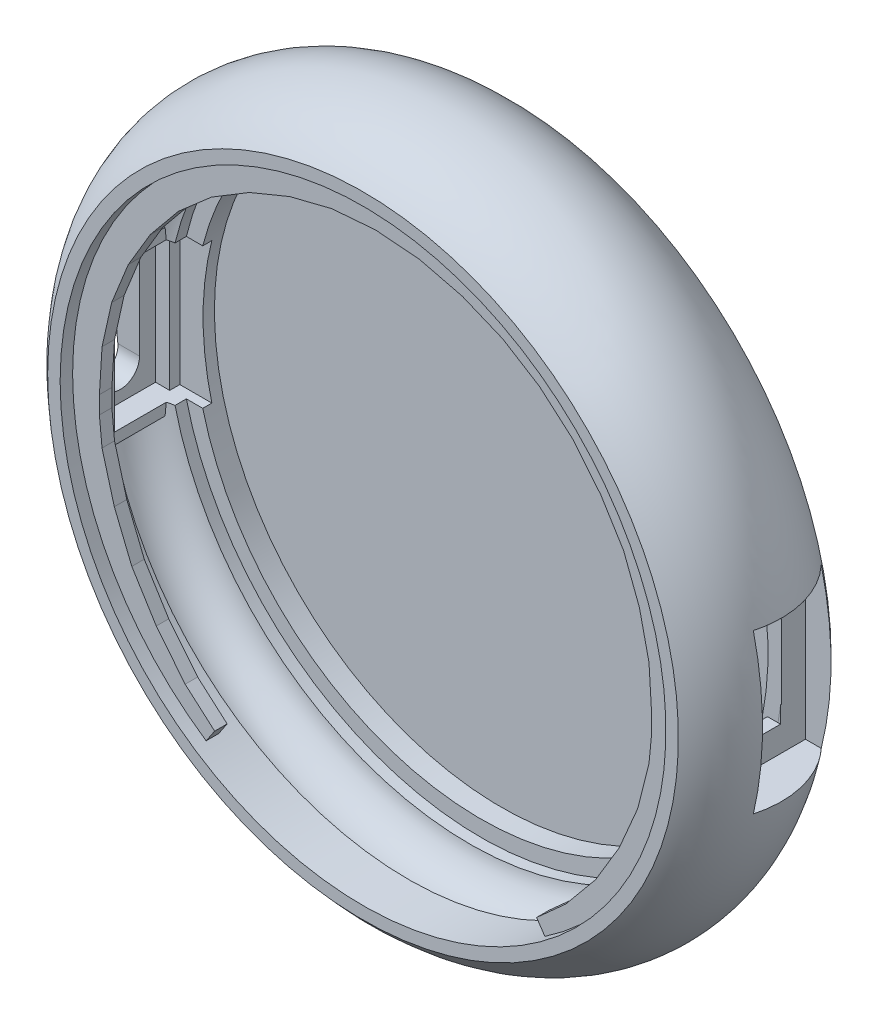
ISO-10303-21;
HEADER;
FILE_DESCRIPTION(('STEP AP214'),'2;1');
FILE_NAME('part.step','',(''),(''),'','','');
FILE_SCHEMA(('AUTOMOTIVE_DESIGN { 1 0 10303 214 1 1 1 1 }'));
ENDSEC;
DATA;
#1=APPLICATION_CONTEXT('core data for automotive mechanical design processes');
#2=APPLICATION_PROTOCOL_DEFINITION('international standard','automotive_design',2000,#1);
#3=PRODUCT_CONTEXT('',#1,'mechanical');
#4=PRODUCT('Part','Part','',(#3));
#5=PRODUCT_RELATED_PRODUCT_CATEGORY('part','',(#4));
#6=PRODUCT_DEFINITION_FORMATION('','',#4);
#7=PRODUCT_DEFINITION_CONTEXT('part definition',#1,'design');
#8=PRODUCT_DEFINITION('design','',#6,#7);
#9=PRODUCT_DEFINITION_SHAPE('','',#8);
#10=(LENGTH_UNIT() NAMED_UNIT(*) SI_UNIT(.MILLI.,.METRE.));
#11=(NAMED_UNIT(*) PLANE_ANGLE_UNIT() SI_UNIT($,.RADIAN.));
#12=(NAMED_UNIT(*) SI_UNIT($,.STERADIAN.) SOLID_ANGLE_UNIT());
#13=UNCERTAINTY_MEASURE_WITH_UNIT(LENGTH_MEASURE(1.E-05),#10,'distance_accuracy_value','');
#14=(GEOMETRIC_REPRESENTATION_CONTEXT(3) GLOBAL_UNCERTAINTY_ASSIGNED_CONTEXT((#13)) GLOBAL_UNIT_ASSIGNED_CONTEXT((#10,
#11,#12)) REPRESENTATION_CONTEXT('',''));
#15=CARTESIAN_POINT('',(0.,0.,0.));
#16=DIRECTION('',(0.,0.,1.));
#17=DIRECTION('',(1.,0.,0.));
#18=AXIS2_PLACEMENT_3D('',#15,#16,#17);
#19=CARTESIAN_POINT('',(0.,0.,13.71));
#20=DIRECTION('',(0.,0.,-1.));
#21=DIRECTION('',(-1.,0.,0.));
#22=AXIS2_PLACEMENT_3D('',#19,#20,#21);
#23=CYLINDRICAL_SURFACE('',#22,26.7);
#24=CARTESIAN_POINT('',(0.,0.,3.3));
#25=DIRECTION('',(0.,0.,1.));
#26=DIRECTION('',(1.,0.,0.));
#27=AXIS2_PLACEMENT_3D('',#24,#25,#26);
#28=CIRCLE('',#27,26.7);
#29=CARTESIAN_POINT('',(-25.9701752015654,-6.2,3.3));
#30=VERTEX_POINT('',#29);
#31=CARTESIAN_POINT('',(26.5,-3.26190128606,3.3));
#32=VERTEX_POINT('',#31);
#33=EDGE_CURVE('E985',#30,#32,#28,.T.);
#34=ORIENTED_EDGE('',*,*,#33,.F.);
#35=DIRECTION('',(0.,0.,-1.));
#36=VECTOR('',#35,1.);
#37=CARTESIAN_POINT('',(-25.9701752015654,-6.2,13.71));
#38=LINE('',#37,#36);
#39=CARTESIAN_POINT('',(-25.9701752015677,-6.2,4.3));
#40=VERTEX_POINT('',#39);
#41=EDGE_CURVE('E630',#30,#40,#38,.F.);
#42=ORIENTED_EDGE('',*,*,#41,.T.);
#43=CARTESIAN_POINT('',(0.,0.,4.3));
#44=DIRECTION('',(0.,0.,-1.));
#45=DIRECTION('',(-1.,0.,0.));
#46=AXIS2_PLACEMENT_3D('',#43,#44,#45);
#47=CIRCLE('',#46,26.7000000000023);
#48=CARTESIAN_POINT('',(25.6249878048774,-7.50000000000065,4.3));
#49=VERTEX_POINT('',#48);
#50=EDGE_CURVE('E969',#49,#40,#47,.T.);
#51=ORIENTED_EDGE('',*,*,#50,.F.);
#52=DIRECTION('',(0.,0.,-1.));
#53=VECTOR('',#52,1.);
#54=CARTESIAN_POINT('',(25.6249878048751,-7.5,13.71));
#55=LINE('',#54,#53);
#56=CARTESIAN_POINT('',(25.6249878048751,-7.5,3.4));
#57=VERTEX_POINT('',#56);
#58=EDGE_CURVE('E936',#49,#57,#55,.T.);
#59=ORIENTED_EDGE('',*,*,#58,.T.);
#60=CARTESIAN_POINT('',(0.,0.,3.4));
#61=DIRECTION('',(0.,0.,-1.));
#62=DIRECTION('',(-1.,0.,0.));
#63=AXIS2_PLACEMENT_3D('',#60,#61,#62);
#64=CIRCLE('',#63,26.7);
#65=CARTESIAN_POINT('',(26.2740841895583,-4.75,3.3975));
#66=VERTEX_POINT('',#65);
#67=EDGE_CURVE('E1155',#66,#57,#64,.T.);
#68=ORIENTED_EDGE('',*,*,#67,.F.);
#69=CARTESIAN_POINT('',(26.2740841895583,4.75000000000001,3.39));
#70=CARTESIAN_POINT('',(27.1328201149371,0.,3.39));
#71=CARTESIAN_POINT('',(26.2740841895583,-4.75,3.39));
#72=B_SPLINE_CURVE_WITH_KNOTS('',2,(#69,#70,#71),.UNSPECIFIED.,.F.,.F.,(3,3),(0.,1.),.UNSPECIFIED.);
#73=CARTESIAN_POINT('',(26.500001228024,-3.26776124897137,3.39));
#74=VERTEX_POINT('',#73);
#75=EDGE_CURVE('E696',#74,#66,#72,.T.);
#76=ORIENTED_EDGE('',*,*,#75,.F.);
#77=DIRECTION('',(0.,0.,-1.));
#78=VECTOR('',#77,1.);
#79=CARTESIAN_POINT('',(26.5,-3.26190128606,13.71));
#80=LINE('',#79,#78);
#81=EDGE_CURVE('E661',#74,#32,#80,.T.);
#82=ORIENTED_EDGE('',*,*,#81,.T.);
#83=EDGE_LOOP('',(#34,#42,#51,#59,#68,#76,#82));
#84=FACE_BOUND('',#83,.T.);
#85=ADVANCED_FACE('F47',(#84),#23,.F.);
#86=DIRECTION('',(0.,0.,-1.));
#87=VECTOR('',#86,1.);
#88=CARTESIAN_POINT('',(-25.9701752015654,6.2,13.71));
#89=LINE('',#88,#87);
#90=CARTESIAN_POINT('',(-25.9701752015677,6.2,4.3));
#91=VERTEX_POINT('',#90);
#92=CARTESIAN_POINT('',(-25.9701752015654,6.2,3.3));
#93=VERTEX_POINT('',#92);
#94=EDGE_CURVE('E598',#91,#93,#89,.T.);
#95=ORIENTED_EDGE('',*,*,#94,.T.);
#96=CARTESIAN_POINT('',(26.5,3.26190128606,3.3));
#97=VERTEX_POINT('',#96);
#98=EDGE_CURVE('E979',#97,#93,#28,.T.);
#99=ORIENTED_EDGE('',*,*,#98,.F.);
#100=DIRECTION('',(0.,0.,-1.));
#101=VECTOR('',#100,1.);
#102=CARTESIAN_POINT('',(26.5,3.26190128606,13.71));
#103=LINE('',#102,#101);
#104=CARTESIAN_POINT('',(26.5000012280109,3.26385425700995,3.39));
#105=VERTEX_POINT('',#104);
#106=EDGE_CURVE('E683',#97,#105,#103,.F.);
#107=ORIENTED_EDGE('',*,*,#106,.T.);
#108=CARTESIAN_POINT('',(26.2740841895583,4.75000000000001,3.39));
#109=CARTESIAN_POINT('',(27.1328201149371,0.,3.39));
#110=CARTESIAN_POINT('',(26.2740841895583,-4.75,3.39));
#111=B_SPLINE_CURVE_WITH_KNOTS('',2,(#108,#109,#110),.UNSPECIFIED.,.F.,.F.,(3,3),(0.,1.),.UNSPECIFIED.);
#112=CARTESIAN_POINT('',(26.2740841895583,4.75,3.3975));
#113=VERTEX_POINT('',#112);
#114=EDGE_CURVE('E708',#113,#105,#111,.T.);
#115=ORIENTED_EDGE('',*,*,#114,.F.);
#116=CARTESIAN_POINT('',(25.6249878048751,7.5,3.4));
#117=VERTEX_POINT('',#116);
#118=EDGE_CURVE('E1148',#117,#113,#64,.T.);
#119=ORIENTED_EDGE('',*,*,#118,.F.);
#120=DIRECTION('',(0.,0.,-1.));
#121=VECTOR('',#120,1.);
#122=CARTESIAN_POINT('',(25.6249878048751,7.5,13.71));
#123=LINE('',#122,#121);
#124=CARTESIAN_POINT('',(25.6249878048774,7.50000000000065,4.3));
#125=VERTEX_POINT('',#124);
#126=EDGE_CURVE('E939',#117,#125,#123,.F.);
#127=ORIENTED_EDGE('',*,*,#126,.T.);
#128=EDGE_CURVE('E966',#91,#125,#47,.T.);
#129=ORIENTED_EDGE('',*,*,#128,.F.);
#130=EDGE_LOOP('',(#95,#99,#107,#115,#119,#127,#129));
#131=FACE_BOUND('',#130,.T.);
#132=ADVANCED_FACE('F1775',(#131),#23,.F.);
#133=CARTESIAN_POINT('',(0.,0.,3.3));
#134=DIRECTION('',(0.,0.,1.));
#135=DIRECTION('',(1.,0.,0.));
#136=AXIS2_PLACEMENT_3D('',#133,#134,#135);
#137=PLANE('',#136);
#138=CARTESIAN_POINT('',(0.,0.,3.3));
#139=DIRECTION('',(0.,0.,1.));
#140=DIRECTION('',(1.,0.,0.));
#141=AXIS2_PLACEMENT_3D('',#138,#139,#140);
#142=CIRCLE('',#141,25.3);
#143=CARTESIAN_POINT('',(-24.5285547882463,6.2,3.3));
#144=VERTEX_POINT('',#143);
#145=CARTESIAN_POINT('',(-24.5285547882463,-6.2,3.3));
#146=VERTEX_POINT('',#145);
#147=EDGE_CURVE('E977',#144,#146,#142,.F.);
#148=ORIENTED_EDGE('',*,*,#147,.T.);
#149=DIRECTION('',(-1.,0.,0.));
#150=VECTOR('',#149,1.);
#151=CARTESIAN_POINT('',(0.,-6.2,3.3));
#152=LINE('',#151,#150);
#153=EDGE_CURVE('E531',#146,#30,#152,.T.);
#154=ORIENTED_EDGE('',*,*,#153,.T.);
#155=ORIENTED_EDGE('',*,*,#33,.T.);
#156=DIRECTION('',(0.,1.,0.));
#157=VECTOR('',#156,1.);
#158=CARTESIAN_POINT('',(26.5,0.,3.3));
#159=LINE('',#158,#157);
#160=EDGE_CURVE('E680',#32,#97,#159,.T.);
#161=ORIENTED_EDGE('',*,*,#160,.T.);
#162=ORIENTED_EDGE('',*,*,#98,.T.);
#163=DIRECTION('',(1.,0.,0.));
#164=VECTOR('',#163,1.);
#165=CARTESIAN_POINT('',(0.,6.2,3.3));
#166=LINE('',#165,#164);
#167=EDGE_CURVE('E510',#93,#144,#166,.T.);
#168=ORIENTED_EDGE('',*,*,#167,.T.);
#169=EDGE_LOOP('',(#148,#154,#155,#161,#162,#168));
#170=FACE_BOUND('',#169,.T.);
#171=ADVANCED_FACE('F1777',(#170),#137,.T.);
#172=CARTESIAN_POINT('',(0.,0.,3.31));
#173=DIRECTION('',(0.,0.,-1.));
#174=DIRECTION('',(-1.,0.,0.));
#175=AXIS2_PLACEMENT_3D('',#172,#173,#174);
#176=CYLINDRICAL_SURFACE('',#175,25.3);
#177=CARTESIAN_POINT('',(0.,0.,1.5));
#178=DIRECTION('',(0.,0.,1.));
#179=DIRECTION('',(1.,0.,0.));
#180=AXIS2_PLACEMENT_3D('',#177,#178,#179);
#181=CIRCLE('',#180,25.3);
#182=CARTESIAN_POINT('',(25.3,0.,1.5));
#183=VERTEX_POINT('',#182);
#184=EDGE_CURVE('E975',#183,#183,#181,.T.);
#185=ORIENTED_EDGE('',*,*,#184,.F.);
#186=EDGE_LOOP('',(#185));
#187=FACE_BOUND('',#186,.T.);
#188=CARTESIAN_POINT('',(0.,0.,2.5));
#189=DIRECTION('',(0.,0.,-1.));
#190=DIRECTION('',(-1.,0.,0.));
#191=AXIS2_PLACEMENT_3D('',#188,#189,#190);
#192=CIRCLE('',#191,25.3);
#193=CARTESIAN_POINT('',(-24.5285547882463,-6.2,2.5));
#194=VERTEX_POINT('',#193);
#195=CARTESIAN_POINT('',(-24.5285547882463,6.2,2.5));
#196=VERTEX_POINT('',#195);
#197=EDGE_CURVE('E1551',#194,#196,#192,.T.);
#198=ORIENTED_EDGE('',*,*,#197,.F.);
#199=DIRECTION('',(0.,0.,-1.));
#200=VECTOR('',#199,1.);
#201=CARTESIAN_POINT('',(-24.5285547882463,-6.2,3.31));
#202=LINE('',#201,#200);
#203=EDGE_CURVE('E11',#194,#146,#202,.F.);
#204=ORIENTED_EDGE('',*,*,#203,.T.);
#205=ORIENTED_EDGE('',*,*,#147,.F.);
#206=DIRECTION('',(0.,0.,-1.));
#207=VECTOR('',#206,1.);
#208=CARTESIAN_POINT('',(-24.5285547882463,6.2,3.31));
#209=LINE('',#208,#207);
#210=EDGE_CURVE('E59',#144,#196,#209,.T.);
#211=ORIENTED_EDGE('',*,*,#210,.T.);
#212=EDGE_LOOP('',(#198,#204,#205,#211));
#213=FACE_BOUND('',#212,.T.);
#214=ADVANCED_FACE('F2000',(#187,#213),#176,.F.);
#215=CARTESIAN_POINT('',(0.,0.,3.39));
#216=DIRECTION('',(0.,0.,-1.));
#217=DIRECTION('',(-1.,0.,0.));
#218=AXIS2_PLACEMENT_3D('',#215,#216,#217);
#219=PLANE('',#218);
#220=DIRECTION('',(0.,-1.,0.));
#221=VECTOR('',#220,1.);
#222=CARTESIAN_POINT('',(-27.35,0.,3.39));
#223=LINE('',#222,#221);
#224=CARTESIAN_POINT('',(-27.35,6.2,3.39));
#225=VERTEX_POINT('',#224);
#226=CARTESIAN_POINT('',(-27.35,-6.2,3.39));
#227=VERTEX_POINT('',#226);
#228=EDGE_CURVE('E503',#225,#227,#223,.T.);
#229=ORIENTED_EDGE('',*,*,#228,.F.);
#230=DIRECTION('',(-1.,0.,0.));
#231=VECTOR('',#230,1.);
#232=CARTESIAN_POINT('',(-28.6,6.2,3.39));
#233=LINE('',#232,#231);
#234=CARTESIAN_POINT('',(-28.6,6.2,3.39));
#235=VERTEX_POINT('',#234);
#236=EDGE_CURVE('E568',#225,#235,#233,.T.);
#237=ORIENTED_EDGE('',*,*,#236,.T.);
#238=DIRECTION('',(0.,-1.,0.));
#239=VECTOR('',#238,1.);
#240=CARTESIAN_POINT('',(-28.6,-6.2,3.39));
#241=LINE('',#240,#239);
#242=CARTESIAN_POINT('',(-28.6,-6.2,3.39));
#243=VERTEX_POINT('',#242);
#244=EDGE_CURVE('E565',#235,#243,#241,.T.);
#245=ORIENTED_EDGE('',*,*,#244,.T.);
#246=DIRECTION('',(1.,0.,0.));
#247=VECTOR('',#246,1.);
#248=CARTESIAN_POINT('',(-28.6,-6.2,3.39));
#249=LINE('',#248,#247);
#250=EDGE_CURVE('E576',#243,#227,#249,.T.);
#251=ORIENTED_EDGE('',*,*,#250,.T.);
#252=EDGE_LOOP('',(#229,#237,#245,#251));
#253=FACE_BOUND('',#252,.T.);
#254=ADVANCED_FACE('F611',(#253),#219,.F.);
#255=CARTESIAN_POINT('',(0.,0.,7.));
#256=DIRECTION('',(0.,0.,-1.));
#257=DIRECTION('',(-1.,0.,0.));
#258=AXIS2_PLACEMENT_3D('',#255,#256,#257);
#259=TOROIDAL_SURFACE('',#258,22.3859375,8.6140625);
#260=CARTESIAN_POINT('',(0.,0.,9.2));
#261=DIRECTION('',(0.,0.,-1.));
#262=DIRECTION('',(-1.,0.,0.));
#263=AXIS2_PLACEMENT_3D('',#260,#261,#262);
#264=CIRCLE('',#263,30.7143270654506);
#265=CARTESIAN_POINT('',(29.9060175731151,7.,9.2));
#266=VERTEX_POINT('',#265);
#267=CARTESIAN_POINT('',(29.9060175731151,-7.,9.2));
#268=VERTEX_POINT('',#267);
#269=EDGE_CURVE('E1633',#266,#268,#264,.T.);
#270=ORIENTED_EDGE('',*,*,#269,.F.);
#271=CARTESIAN_POINT('',(17.3210201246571,7.,-0.777084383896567));
#272=CARTESIAN_POINT('',(17.5713662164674,7.,-0.88764489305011));
#273=CARTESIAN_POINT('',(17.8263150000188,7.,-0.987793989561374));
#274=CARTESIAN_POINT('',(18.3436708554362,7.,-1.16659643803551));
#275=CARTESIAN_POINT('',(18.6060787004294,7.,-1.24524755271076));
#276=CARTESIAN_POINT('',(19.1368412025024,7.,-1.38043129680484));
#277=CARTESIAN_POINT('',(19.4052020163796,7.,-1.43693977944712));
#278=CARTESIAN_POINT('',(19.9457240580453,7.,-1.52713871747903));
#279=CARTESIAN_POINT('',(20.2178851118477,7.,-1.56083021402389));
#280=CARTESIAN_POINT('',(20.7644473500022,7.,-1.60495853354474));
#281=CARTESIAN_POINT('',(21.0388509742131,7.,-1.61536525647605));
#282=CARTESIAN_POINT('',(21.587539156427,7.,-1.61249949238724));
#283=CARTESIAN_POINT('',(21.8618237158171,7.,-1.59922728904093));
#284=CARTESIAN_POINT('',(22.4080063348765,7.,-1.54884276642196));
#285=CARTESIAN_POINT('',(22.6799059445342,7.,-1.51174730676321));
#286=CARTESIAN_POINT('',(23.2193774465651,7.,-1.41373038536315));
#287=CARTESIAN_POINT('',(23.486949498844,7.,-1.35280980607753));
#288=CARTESIAN_POINT('',(24.0073057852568,7.,-1.20962022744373));
#289=CARTESIAN_POINT('',(24.2602906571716,7.,-1.12808017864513));
#290=CARTESIAN_POINT('',(24.7581613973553,7.,-0.943197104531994));
#291=CARTESIAN_POINT('',(25.0030476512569,7.,-0.83985511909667));
#292=CARTESIAN_POINT('',(25.4827515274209,7.,-0.61192035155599));
#293=CARTESIAN_POINT('',(25.7175683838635,7.,-0.487325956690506));
#294=CARTESIAN_POINT('',(26.1751353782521,7.,-0.217659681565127));
#295=CARTESIAN_POINT('',(26.3978859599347,7.,-0.0725885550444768));
#296=CARTESIAN_POINT('',(26.8196746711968,7.,0.230077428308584));
#297=CARTESIAN_POINT('',(27.0193288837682,7.,0.386814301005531));
#298=CARTESIAN_POINT('',(27.4042611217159,7.,0.717042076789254));
#299=CARTESIAN_POINT('',(27.5895397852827,7.,0.890532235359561));
#300=CARTESIAN_POINT('',(27.944151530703,7.,1.2530327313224));
#301=CARTESIAN_POINT('',(28.1134883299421,7.,1.44203943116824));
#302=CARTESIAN_POINT('',(28.4348346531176,7.,1.8342514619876));
#303=CARTESIAN_POINT('',(28.5868445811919,7.,2.03745646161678));
#304=CARTESIAN_POINT('',(28.8670391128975,7.,2.44892767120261));
#305=CARTESIAN_POINT('',(28.9958891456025,7.,2.65674104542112));
#306=CARTESIAN_POINT('',(29.2352445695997,7.,3.08267480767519));
#307=CARTESIAN_POINT('',(29.3457505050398,7.,3.30079488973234));
#308=CARTESIAN_POINT('',(29.5475039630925,7.,3.7457442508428));
#309=CARTESIAN_POINT('',(29.6387532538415,7.,3.97257272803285));
#310=CARTESIAN_POINT('',(29.8012494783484,7.,4.43328566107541));
#311=CARTESIAN_POINT('',(29.872496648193,7.,4.66717003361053));
#312=CARTESIAN_POINT('',(29.9929677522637,7.,5.13471023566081));
#313=CARTESIAN_POINT('',(30.0426677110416,7.,5.36824352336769));
#314=CARTESIAN_POINT('',(30.1220246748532,7.,5.8386888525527));
#315=CARTESIAN_POINT('',(30.1516820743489,7.,6.07560082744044));
#316=CARTESIAN_POINT('',(30.19071454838,7.,6.55107341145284));
#317=CARTESIAN_POINT('',(30.2000909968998,7.,6.78963390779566));
#318=CARTESIAN_POINT('',(30.1984899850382,7.,7.26668674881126));
#319=CARTESIAN_POINT('',(30.1875125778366,7.,7.50517909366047));
#320=CARTESIAN_POINT('',(30.1455095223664,7.,7.977924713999));
#321=CARTESIAN_POINT('',(30.1146905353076,7.,8.21219638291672));
#322=CARTESIAN_POINT('',(30.0334303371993,7.,8.67739516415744));
#323=CARTESIAN_POINT('',(29.9829823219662,7.,8.90832108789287));
#324=CARTESIAN_POINT('',(29.8628860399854,7.,9.36502138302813));
#325=CARTESIAN_POINT('',(29.7932457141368,7.,9.59079784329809));
#326=CARTESIAN_POINT('',(29.6352641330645,7.,10.0358229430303));
#327=CARTESIAN_POINT('',(29.5469144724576,7.,10.2550685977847));
#328=CARTESIAN_POINT('',(29.3519471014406,7.,10.6860131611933));
#329=CARTESIAN_POINT('',(29.2452793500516,7.,10.8976894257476));
#330=CARTESIAN_POINT('',(29.0147194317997,7.,11.311320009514));
#331=CARTESIAN_POINT('',(28.8908347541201,7.,11.5132785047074));
#332=CARTESIAN_POINT('',(28.6266963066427,7.,11.9063048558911));
#333=CARTESIAN_POINT('',(28.4864360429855,7.,12.0973683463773));
#334=CARTESIAN_POINT('',(28.1906883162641,7.,12.467215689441));
#335=CARTESIAN_POINT('',(28.0352057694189,7.,12.6460034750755));
#336=CARTESIAN_POINT('',(27.7076047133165,7.,12.9929084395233));
#337=CARTESIAN_POINT('',(27.5352659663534,7.,13.1608176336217));
#338=CARTESIAN_POINT('',(27.1773178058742,7.,13.4818331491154));
#339=CARTESIAN_POINT('',(26.9917082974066,7.,13.6349393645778));
#340=CARTESIAN_POINT('',(26.6085602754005,7.,13.9254475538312));
#341=CARTESIAN_POINT('',(26.4110207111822,7.,14.0628481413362));
#342=CARTESIAN_POINT('',(26.0054364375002,7.,14.3211573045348));
#343=CARTESIAN_POINT('',(25.7973913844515,7.,14.4420653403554));
#344=CARTESIAN_POINT('',(25.3663927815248,7.,14.6698455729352));
#345=CARTESIAN_POINT('',(25.1431864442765,7.,14.7762395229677));
#346=CARTESIAN_POINT('',(24.6888181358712,7.,14.9704014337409));
#347=CARTESIAN_POINT('',(24.4576560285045,7.,15.0581690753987));
#348=CARTESIAN_POINT('',(23.9890140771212,7.,15.2146825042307));
#349=CARTESIAN_POINT('',(23.7515349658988,7.,15.2834304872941));
#350=CARTESIAN_POINT('',(23.2717564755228,7.,15.4016973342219));
#351=CARTESIAN_POINT('',(23.0294554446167,7.,15.4512094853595));
#352=CARTESIAN_POINT('',(22.5324015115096,7.,15.5323829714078));
#353=CARTESIAN_POINT('',(22.2775257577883,7.,15.5632929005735));
#354=CARTESIAN_POINT('',(21.7660167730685,7.,15.6042768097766));
#355=CARTESIAN_POINT('',(21.5093828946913,7.,15.6143426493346));
#356=CARTESIAN_POINT('',(20.9961652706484,7.,15.6137706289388));
#357=CARTESIAN_POINT('',(20.7395815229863,7.,15.6031356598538));
#358=CARTESIAN_POINT('',(20.2280627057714,7.,15.5614618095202));
#359=CARTESIAN_POINT('',(19.9731281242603,7.,15.5304171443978));
#360=CARTESIAN_POINT('',(19.3066766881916,7.,15.4223334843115));
#361=CARTESIAN_POINT('',(18.8976942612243,7.,15.3286397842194));
#362=CARTESIAN_POINT('',(18.2963318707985,7.,15.1499125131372));
#363=CARTESIAN_POINT('',(18.0980156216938,7.,15.0840250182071));
#364=CARTESIAN_POINT('',(17.7059391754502,7.,14.9398113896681));
#365=CARTESIAN_POINT('',(17.5121793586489,7.,14.8614842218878));
#366=CARTESIAN_POINT('',(17.3210201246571,7.,14.7770843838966));
#367=B_SPLINE_CURVE_WITH_KNOTS('',3,(#271,#272,#273,#274,#275,#276,#277,#278,#279,#280,#281,
#282,#283,#284,#285,#286,#287,#288,#289,#290,#291,#292,#293,#294,#295,#296,#297,#298,#299,#300,
#301,#302,#303,#304,#305,#306,#307,#308,#309,#310,#311,#312,#313,#314,#315,#316,#317,#318,#319,
#320,#321,#322,#323,#324,#325,#326,#327,#328,#329,#330,#331,#332,#333,#334,#335,#336,#337,#338,
#339,#340,#341,#342,#343,#344,#345,#346,#347,#348,#349,#350,#351,#352,#353,#354,#355,#356,#357,
#358,#359,#360,#361,#362,#363,#364,#365,#366),.UNSPECIFIED.,.F.,.F.,(4,2,2,2,2,2,2,2,2,2,2,2,2,
2,2,2,2,2,2,2,2,2,2,2,2,2,2,2,2,2,2,2,2,2,2,2,2,2,2,2,2,2,2,2,2,2,2,4),(0.,0.820790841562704,
1.64166707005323,2.4634359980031,3.28516742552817,4.10796048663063,4.93074369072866,
5.75294525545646,6.57511636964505,7.37151883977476,8.16788333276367,8.96430828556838,
9.7607039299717,10.5212416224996,11.2817455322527,12.0420716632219,12.8023800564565,
13.5350373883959,14.2676729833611,15.0002412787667,15.732800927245,16.4482307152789,
17.1636464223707,17.8790136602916,18.5943790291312,19.3024114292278,20.0106894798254,
20.7186749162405,21.4269791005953,22.1372499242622,22.8472127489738,23.5574580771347,
24.2674747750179,24.9884808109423,25.7094920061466,26.4305667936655,27.1516651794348,
27.8926225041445,28.6335925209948,29.3744769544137,30.1156197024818,30.8849800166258,
31.6546407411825,32.4241939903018,33.19396541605,34.4486821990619,35.0752632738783,
35.7018964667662),.UNSPECIFIED.);
#368=CARTESIAN_POINT('',(27.889729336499,7.,1.2));
#369=VERTEX_POINT('',#368);
#370=EDGE_CURVE('E2063',#369,#266,#367,.T.);
#371=ORIENTED_EDGE('',*,*,#370,.F.);
#372=CARTESIAN_POINT('',(0.,0.,1.2));
#373=DIRECTION('',(0.,0.,-1.));
#374=DIRECTION('',(-1.,0.,0.));
#375=AXIS2_PLACEMENT_3D('',#372,#373,#374);
#376=CIRCLE('',#375,28.7547735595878);
#377=CARTESIAN_POINT('',(27.889729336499,-7.,1.2));
#378=VERTEX_POINT('',#377);
#379=EDGE_CURVE('E1687',#369,#378,#376,.T.);
#380=ORIENTED_EDGE('',*,*,#379,.T.);
#381=CARTESIAN_POINT('',(17.3210201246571,-7.,14.7770843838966));
#382=CARTESIAN_POINT('',(17.5713662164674,-7.,14.8876448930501));
#383=CARTESIAN_POINT('',(17.8263150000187,-7.,14.9877939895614));
#384=CARTESIAN_POINT('',(18.3436708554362,-7.,15.1665964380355));
#385=CARTESIAN_POINT('',(18.6060787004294,-7.,15.2452475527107));
#386=CARTESIAN_POINT('',(19.1368412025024,-7.,15.3804312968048));
#387=CARTESIAN_POINT('',(19.4052020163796,-7.,15.4369397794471));
#388=CARTESIAN_POINT('',(19.9457240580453,-7.,15.527138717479));
#389=CARTESIAN_POINT('',(20.2178851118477,-7.,15.5608302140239));
#390=CARTESIAN_POINT('',(20.7644473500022,-7.,15.6049585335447));
#391=CARTESIAN_POINT('',(21.0388509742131,-7.,15.615365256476));
#392=CARTESIAN_POINT('',(21.587539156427,-7.,15.6124994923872));
#393=CARTESIAN_POINT('',(21.8618237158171,-7.,15.5992272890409));
#394=CARTESIAN_POINT('',(22.4080063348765,-7.,15.548842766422));
#395=CARTESIAN_POINT('',(22.6799059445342,-7.,15.5117473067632));
#396=CARTESIAN_POINT('',(23.2193774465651,-7.,15.4137303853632));
#397=CARTESIAN_POINT('',(23.486949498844,-7.,15.3528098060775));
#398=CARTESIAN_POINT('',(24.0073057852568,-7.,15.2096202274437));
#399=CARTESIAN_POINT('',(24.2602906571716,-7.,15.1280801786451));
#400=CARTESIAN_POINT('',(24.7581613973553,-7.,14.943197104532));
#401=CARTESIAN_POINT('',(25.0030476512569,-7.,14.8398551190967));
#402=CARTESIAN_POINT('',(25.4827515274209,-7.,14.611920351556));
#403=CARTESIAN_POINT('',(25.7175683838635,-7.,14.4873259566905));
#404=CARTESIAN_POINT('',(26.1751353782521,-7.,14.2176596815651));
#405=CARTESIAN_POINT('',(26.3978859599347,-7.,14.0725885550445));
#406=CARTESIAN_POINT('',(26.8196746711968,-7.,13.7699225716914));
#407=CARTESIAN_POINT('',(27.0193288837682,-7.,13.6131856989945));
#408=CARTESIAN_POINT('',(27.4042611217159,-7.,13.2829579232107));
#409=CARTESIAN_POINT('',(27.5895397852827,-7.,13.1094677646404));
#410=CARTESIAN_POINT('',(27.944151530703,-7.,12.7469672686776));
#411=CARTESIAN_POINT('',(28.1134883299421,-7.,12.5579605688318));
#412=CARTESIAN_POINT('',(28.4348346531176,-7.,12.1657485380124));
#413=CARTESIAN_POINT('',(28.5868445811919,-7.,11.9625435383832));
#414=CARTESIAN_POINT('',(28.8670391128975,-7.,11.5510723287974));
#415=CARTESIAN_POINT('',(28.9958891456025,-7.,11.3432589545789));
#416=CARTESIAN_POINT('',(29.2352445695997,-7.,10.9173251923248));
#417=CARTESIAN_POINT('',(29.3457505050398,-7.,10.6992051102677));
#418=CARTESIAN_POINT('',(29.5475039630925,-7.,10.2542557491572));
#419=CARTESIAN_POINT('',(29.6387532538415,-7.,10.0274272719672));
#420=CARTESIAN_POINT('',(29.8012494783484,-7.,9.56671433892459));
#421=CARTESIAN_POINT('',(29.872496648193,-7.,9.33282996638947));
#422=CARTESIAN_POINT('',(29.9929677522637,-7.,8.86528976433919));
#423=CARTESIAN_POINT('',(30.0426677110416,-7.,8.63175647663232));
#424=CARTESIAN_POINT('',(30.1220246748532,-7.,8.1613111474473));
#425=CARTESIAN_POINT('',(30.1516820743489,-7.,7.92439917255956));
#426=CARTESIAN_POINT('',(30.19071454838,-7.,7.44892658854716));
#427=CARTESIAN_POINT('',(30.2000909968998,-7.,7.21036609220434));
#428=CARTESIAN_POINT('',(30.1984899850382,-7.,6.73331325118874));
#429=CARTESIAN_POINT('',(30.1875125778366,-7.,6.49482090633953));
#430=CARTESIAN_POINT('',(30.1455095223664,-7.,6.022075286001));
#431=CARTESIAN_POINT('',(30.1146905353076,-7.,5.78780361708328));
#432=CARTESIAN_POINT('',(30.0334303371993,-7.,5.32260483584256));
#433=CARTESIAN_POINT('',(29.9829823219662,-7.,5.09167891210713));
#434=CARTESIAN_POINT('',(29.8628860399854,-7.,4.63497861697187));
#435=CARTESIAN_POINT('',(29.7932457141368,-7.,4.40920215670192));
#436=CARTESIAN_POINT('',(29.6352641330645,-7.,3.96417705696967));
#437=CARTESIAN_POINT('',(29.5469144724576,-7.,3.7449314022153));
#438=CARTESIAN_POINT('',(29.3519471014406,-7.,3.31398683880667));
#439=CARTESIAN_POINT('',(29.2452793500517,-7.,3.1023105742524));
#440=CARTESIAN_POINT('',(29.0147194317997,-7.,2.68867999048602));
#441=CARTESIAN_POINT('',(28.8908347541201,-7.,2.48672149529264));
#442=CARTESIAN_POINT('',(28.6266963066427,-7.,2.09369514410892));
#443=CARTESIAN_POINT('',(28.4864360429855,-7.,1.90263165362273));
#444=CARTESIAN_POINT('',(28.1906883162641,-7.,1.532784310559));
#445=CARTESIAN_POINT('',(28.0352057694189,-7.,1.35399652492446));
#446=CARTESIAN_POINT('',(27.7076047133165,-7.,1.00709156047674));
#447=CARTESIAN_POINT('',(27.5352659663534,-7.,0.839182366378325));
#448=CARTESIAN_POINT('',(27.1773178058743,-7.,0.518166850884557));
#449=CARTESIAN_POINT('',(26.9917082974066,-7.,0.365060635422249));
#450=CARTESIAN_POINT('',(26.6085602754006,-7.,0.0745524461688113));
#451=CARTESIAN_POINT('',(26.4110207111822,-7.,-0.0628481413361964));
#452=CARTESIAN_POINT('',(26.0054364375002,-7.,-0.321157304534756));
#453=CARTESIAN_POINT('',(25.7973913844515,-7.,-0.442065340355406));
#454=CARTESIAN_POINT('',(25.3663927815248,-7.,-0.669845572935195));
#455=CARTESIAN_POINT('',(25.1431864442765,-7.,-0.776239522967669));
#456=CARTESIAN_POINT('',(24.6888181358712,-7.,-0.970401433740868));
#457=CARTESIAN_POINT('',(24.4576560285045,-7.,-1.0581690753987));
#458=CARTESIAN_POINT('',(23.9890140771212,-7.,-1.21468250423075));
#459=CARTESIAN_POINT('',(23.7515349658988,-7.,-1.28343048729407));
#460=CARTESIAN_POINT('',(23.2717564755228,-7.,-1.4016973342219));
#461=CARTESIAN_POINT('',(23.0294554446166,-7.,-1.45120948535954));
#462=CARTESIAN_POINT('',(22.5324015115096,-7.,-1.53238297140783));
#463=CARTESIAN_POINT('',(22.2775257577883,-7.,-1.56329290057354));
#464=CARTESIAN_POINT('',(21.7660167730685,-7.,-1.60427680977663));
#465=CARTESIAN_POINT('',(21.5093828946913,-7.,-1.61434264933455));
#466=CARTESIAN_POINT('',(20.9961652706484,-7.,-1.61377062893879));
#467=CARTESIAN_POINT('',(20.7395815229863,-7.,-1.60313565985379));
#468=CARTESIAN_POINT('',(20.2280627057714,-7.,-1.56146180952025));
#469=CARTESIAN_POINT('',(19.9731281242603,-7.,-1.53041714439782));
#470=CARTESIAN_POINT('',(19.3066766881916,-7.,-1.42233348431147));
#471=CARTESIAN_POINT('',(18.8976942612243,-7.,-1.3286397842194));
#472=CARTESIAN_POINT('',(18.2963318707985,-7.,-1.14991251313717));
#473=CARTESIAN_POINT('',(18.0980156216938,-7.,-1.08402501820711));
#474=CARTESIAN_POINT('',(17.7059391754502,-7.,-0.939811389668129));
#475=CARTESIAN_POINT('',(17.5121793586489,-7.,-0.861484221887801));
#476=CARTESIAN_POINT('',(17.3210201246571,-7.,-0.777084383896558));
#477=B_SPLINE_CURVE_WITH_KNOTS('',3,(#381,#382,#383,#384,#385,#386,#387,#388,#389,#390,#391,
#392,#393,#394,#395,#396,#397,#398,#399,#400,#401,#402,#403,#404,#405,#406,#407,#408,#409,#410,
#411,#412,#413,#414,#415,#416,#417,#418,#419,#420,#421,#422,#423,#424,#425,#426,#427,#428,#429,
#430,#431,#432,#433,#434,#435,#436,#437,#438,#439,#440,#441,#442,#443,#444,#445,#446,#447,#448,
#449,#450,#451,#452,#453,#454,#455,#456,#457,#458,#459,#460,#461,#462,#463,#464,#465,#466,#467,
#468,#469,#470,#471,#472,#473,#474,#475,#476),.UNSPECIFIED.,.F.,.F.,(4,2,2,2,2,2,2,2,2,2,2,2,2,
2,2,2,2,2,2,2,2,2,2,2,2,2,2,2,2,2,2,2,2,2,2,2,2,2,2,2,2,2,2,2,2,2,2,4),(0.,0.820790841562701,
1.64166707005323,2.4634359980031,3.28516742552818,4.10796048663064,4.93074369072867,
5.75294525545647,6.57511636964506,7.37151883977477,8.16788333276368,8.96430828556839,
9.76070392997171,10.5212416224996,11.2817455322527,12.0420716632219,12.8023800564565,
13.5350373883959,14.2676729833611,15.0002412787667,15.732800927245,16.4482307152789,
17.1636464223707,17.8790136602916,18.5943790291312,19.3024114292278,20.0106894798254,
20.7186749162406,21.4269791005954,22.1372499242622,22.8472127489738,23.5574580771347,
24.2674747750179,24.9884808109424,25.7094920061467,26.4305667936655,27.1516651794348,
27.8926225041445,28.6335925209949,29.3744769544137,30.1156197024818,30.8849800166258,
31.6546407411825,32.4241939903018,33.19396541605,34.4486821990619,35.0752632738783,
35.7018964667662),.UNSPECIFIED.);
#478=EDGE_CURVE('E2056',#268,#378,#477,.T.);
#479=ORIENTED_EDGE('',*,*,#478,.F.);
#480=EDGE_LOOP('',(#270,#371,#380,#479));
#481=FACE_BOUND('',#480,.T.);
#482=CARTESIAN_POINT('',(0.,0.,13.7));
#483=DIRECTION('',(0.,0.,-1.));
#484=DIRECTION('',(-1.,0.,0.));
#485=AXIS2_PLACEMENT_3D('',#482,#483,#484);
#486=CIRCLE('',#485,27.8);
#487=CARTESIAN_POINT('',(-27.8,0.,13.7));
#488=VERTEX_POINT('',#487);
#489=EDGE_CURVE('E981',#488,#488,#486,.T.);
#490=ORIENTED_EDGE('',*,*,#489,.T.);
#491=EDGE_LOOP('',(#490));
#492=FACE_BOUND('',#491,.T.);
#493=CARTESIAN_POINT('',(0.,0.,0.7));
#494=DIRECTION('',(0.,0.,-1.));
#495=DIRECTION('',(-1.,0.,0.));
#496=AXIS2_PLACEMENT_3D('',#493,#494,#495);
#497=CIRCLE('',#496,28.2606351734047);
#498=CARTESIAN_POINT('',(-28.2606351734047,0.,0.7));
#499=VERTEX_POINT('',#498);
#500=EDGE_CURVE('E990',#499,#499,#497,.T.);
#501=ORIENTED_EDGE('',*,*,#500,.F.);
#502=EDGE_LOOP('',(#501));
#503=FACE_BOUND('',#502,.T.);
#504=CARTESIAN_POINT('',(0.,0.,4.8));
#505=DIRECTION('',(0.,0.,1.));
#506=DIRECTION('',(1.,0.,0.));
#507=AXIS2_PLACEMENT_3D('',#504,#505,#506);
#508=CIRCLE('',#507,30.7143270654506);
#509=CARTESIAN_POINT('',(-30.5142571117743,3.5,4.8));
#510=VERTEX_POINT('',#509);
#511=CARTESIAN_POINT('',(-30.5142571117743,-3.5,4.8));
#512=VERTEX_POINT('',#511);
#513=EDGE_CURVE('E1724',#510,#512,#508,.T.);
#514=ORIENTED_EDGE('',*,*,#513,.F.);
#515=CARTESIAN_POINT('',(-30.7172726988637,3.4998,8.19999998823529));
#516=CARTESIAN_POINT('',(-30.711834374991,3.54750971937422,8.2000052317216));
#517=CARTESIAN_POINT('',(-30.706571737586,3.59521727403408,8.198001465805));
#518=CARTESIAN_POINT('',(-30.6964165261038,3.69033322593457,8.18998627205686));
#519=CARTESIAN_POINT('',(-30.6915239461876,3.73774162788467,8.18397490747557));
#520=CARTESIAN_POINT('',(-30.6774435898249,3.87893262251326,8.1599695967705));
#521=CARTESIAN_POINT('',(-30.6688362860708,3.97183018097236,8.1360043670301));
#522=CARTESIAN_POINT('',(-30.6531611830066,4.1524044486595,8.07274874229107));
#523=CARTESIAN_POINT('',(-30.6460943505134,4.24007785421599,8.03344876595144));
#524=CARTESIAN_POINT('',(-30.6332624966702,4.40762684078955,7.94061734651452));
#525=CARTESIAN_POINT('',(-30.6274971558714,4.48750433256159,7.88708940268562));
#526=CARTESIAN_POINT('',(-30.6168984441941,4.63694747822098,7.76747356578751));
#527=CARTESIAN_POINT('',(-30.6120626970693,4.70653931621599,7.70141857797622));
#528=CARTESIAN_POINT('',(-30.6028541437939,4.83366527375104,7.55852846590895));
#529=CARTESIAN_POINT('',(-30.598481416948,4.89119732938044,7.48169150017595));
#530=CARTESIAN_POINT('',(-30.5897608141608,4.99255340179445,7.31941419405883));
#531=CARTESIAN_POINT('',(-30.5854129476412,5.03637252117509,7.23397079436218));
#532=CARTESIAN_POINT('',(-30.5763917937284,5.10902201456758,7.05695647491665));
#533=CARTESIAN_POINT('',(-30.57171853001,5.13785347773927,6.96538600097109));
#534=CARTESIAN_POINT('',(-30.5618398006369,5.17972263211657,6.77871665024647));
#535=CARTESIAN_POINT('',(-30.5566342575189,5.19275802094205,6.68361726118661));
#536=CARTESIAN_POINT('',(-30.5456725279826,5.20267188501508,6.49260916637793));
#537=CARTESIAN_POINT('',(-30.5399163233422,5.19954982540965,6.39670043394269));
#538=CARTESIAN_POINT('',(-30.5280358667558,5.17724394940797,6.20673455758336));
#539=CARTESIAN_POINT('',(-30.5219113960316,5.15805049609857,6.11267855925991));
#540=CARTESIAN_POINT('',(-30.5096832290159,5.10413566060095,5.92912444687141));
#541=CARTESIAN_POINT('',(-30.5035795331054,5.06941399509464,5.83962641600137));
#542=CARTESIAN_POINT('',(-30.4919422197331,4.98535498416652,5.66759546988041));
#543=CARTESIAN_POINT('',(-30.4864093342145,4.93599917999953,5.58507152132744));
#544=CARTESIAN_POINT('',(-30.4766028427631,4.82405848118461,5.42946084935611));
#545=CARTESIAN_POINT('',(-30.4723291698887,4.7614742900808,5.35637362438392));
#546=CARTESIAN_POINT('',(-30.4657844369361,4.62512767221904,5.2220295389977));
#547=CARTESIAN_POINT('',(-30.4635048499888,4.55141443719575,5.16072318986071));
#548=CARTESIAN_POINT('',(-30.4615977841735,4.39469425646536,5.05132757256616));
#549=CARTESIAN_POINT('',(-30.4619707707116,4.31168568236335,5.00324062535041));
#550=CARTESIAN_POINT('',(-30.4658820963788,4.13984899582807,4.92217840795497));
#551=CARTESIAN_POINT('',(-30.4693839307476,4.05109891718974,4.88903547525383));
#552=CARTESIAN_POINT('',(-30.4797951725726,3.86958131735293,4.83799218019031));
#553=CARTESIAN_POINT('',(-30.4866996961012,3.77681972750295,4.82007007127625));
#554=CARTESIAN_POINT('',(-30.4980996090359,3.65292966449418,4.80661172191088));
#555=CARTESIAN_POINT('',(-30.5010928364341,3.6223020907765,4.80412629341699));
#556=CARTESIAN_POINT('',(-30.507427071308,3.56104733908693,4.80082098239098));
#557=CARTESIAN_POINT('',(-30.5107674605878,3.53042025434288,4.79999819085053));
#558=CARTESIAN_POINT('',(-30.5142800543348,3.4998,4.80000001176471));
#559=B_SPLINE_CURVE_WITH_KNOTS('',3,(#515,#516,#517,#518,#519,#520,#521,#522,#523,#524,#525,
#526,#527,#528,#529,#530,#531,#532,#533,#534,#535,#536,#537,#538,#539,#540,#541,#542,#543,#544,
#545,#546,#547,#548,#549,#550,#551,#552,#553,#554,#555,#556,#557,#558),.UNSPECIFIED.,.F.,.F.,(4,
2,2,2,2,2,2,2,2,2,2,2,2,2,2,2,2,2,2,2,2,4),(0.,0.143968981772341,0.287935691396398,
0.575424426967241,0.863093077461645,1.15069104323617,1.43754377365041,1.72444555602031,
2.01144968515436,2.29843295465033,2.58545804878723,2.8724926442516,3.15969947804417,
3.44691155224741,3.73448745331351,4.02204806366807,4.30837294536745,4.59474806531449,
4.87782501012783,5.16049682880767,5.25308455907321,5.34551015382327),.UNSPECIFIED.);
#560=CARTESIAN_POINT('',(-30.7172499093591,3.5,8.2));
#561=VERTEX_POINT('',#560);
#562=EDGE_CURVE('E1726',#561,#510,#559,.T.);
#563=ORIENTED_EDGE('',*,*,#562,.F.);
#564=CARTESIAN_POINT('',(0.,0.,8.2));
#565=DIRECTION('',(0.,0.,-1.));
#566=DIRECTION('',(-1.,0.,0.));
#567=AXIS2_PLACEMENT_3D('',#564,#565,#566);
#568=CIRCLE('',#567,30.9160062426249);
#569=CARTESIAN_POINT('',(-30.7172499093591,-3.5,8.2));
#570=VERTEX_POINT('',#569);
#571=EDGE_CURVE('E1747',#570,#561,#568,.T.);
#572=ORIENTED_EDGE('',*,*,#571,.F.);
#573=CARTESIAN_POINT('',(-30.5142800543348,-3.4998,4.80000001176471));
#574=CARTESIAN_POINT('',(-30.5089183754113,-3.5465198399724,4.79999449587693));
#575=CARTESIAN_POINT('',(-30.5039611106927,-3.59326513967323,4.8019163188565));
#576=CARTESIAN_POINT('',(-30.4948750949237,-3.68651783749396,4.80961478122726));
#577=CARTESIAN_POINT('',(-30.4907463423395,-3.73302523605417,4.81539141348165));
#578=CARTESIAN_POINT('',(-30.4796458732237,-3.87158884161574,4.83847562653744));
#579=CARTESIAN_POINT('',(-30.4739402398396,-3.96285906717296,4.86153752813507));
#580=CARTESIAN_POINT('',(-30.4658332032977,-4.14048927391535,4.92246768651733));
#581=CARTESIAN_POINT('',(-30.4634340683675,-4.22684584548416,4.9603460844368));
#582=CARTESIAN_POINT('',(-30.4615701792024,-4.39213347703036,5.04985359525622));
#583=CARTESIAN_POINT('',(-30.4621048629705,-4.47106595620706,5.10148007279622));
#584=CARTESIAN_POINT('',(-30.4655434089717,-4.61927793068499,5.21701616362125));
#585=CARTESIAN_POINT('',(-30.4684470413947,-4.6885583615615,5.28092458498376));
#586=CARTESIAN_POINT('',(-30.4759552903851,-4.81559979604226,5.41925109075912));
#587=CARTESIAN_POINT('',(-30.4805603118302,-4.87335805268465,5.49367167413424));
#588=CARTESIAN_POINT('',(-30.4908532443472,-4.97640822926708,5.65191914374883));
#589=CARTESIAN_POINT('',(-30.4965535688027,-5.0215410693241,5.73584883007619));
#590=CARTESIAN_POINT('',(-30.5083631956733,-5.09716911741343,5.91002902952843));
#591=CARTESIAN_POINT('',(-30.5144724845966,-5.12766480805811,6.00027933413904));
#592=CARTESIAN_POINT('',(-30.5266447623,-5.17336543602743,6.18534980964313));
#593=CARTESIAN_POINT('',(-30.5327069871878,-5.18844582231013,6.28020081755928));
#594=CARTESIAN_POINT('',(-30.5443982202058,-5.20244746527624,6.47111723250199));
#595=CARTESIAN_POINT('',(-30.5500272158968,-5.20136825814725,6.56718267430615));
#596=CARTESIAN_POINT('',(-30.5607201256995,-5.18306306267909,6.75781676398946));
#597=CARTESIAN_POINT('',(-30.5657839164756,-5.16583355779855,6.85238508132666));
#598=CARTESIAN_POINT('',(-30.5754154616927,-5.11570043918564,7.03729723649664));
#599=CARTESIAN_POINT('',(-30.5799832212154,-5.08279698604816,7.12764111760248));
#600=CARTESIAN_POINT('',(-30.5888674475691,-5.00229891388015,7.30140867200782));
#601=CARTESIAN_POINT('',(-30.5931842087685,-4.95472193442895,7.38484050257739));
#602=CARTESIAN_POINT('',(-30.6019537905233,-4.8462261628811,7.54251254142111));
#603=CARTESIAN_POINT('',(-30.6064066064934,-4.78530781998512,7.61675305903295));
#604=CARTESIAN_POINT('',(-30.6158965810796,-4.651892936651,7.75391192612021));
#605=CARTESIAN_POINT('',(-30.6209336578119,-4.57939801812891,7.81683185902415));
#606=CARTESIAN_POINT('',(-30.6320342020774,-4.42489755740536,7.92958384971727));
#607=CARTESIAN_POINT('',(-30.638097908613,-4.34288980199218,7.97941285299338));
#608=CARTESIAN_POINT('',(-30.6515979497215,-4.17178767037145,8.06455694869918));
#609=CARTESIAN_POINT('',(-30.6590341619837,-4.08269392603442,8.09987333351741));
#610=CARTESIAN_POINT('',(-30.6754675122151,-3.90003451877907,8.15500682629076));
#611=CARTESIAN_POINT('',(-30.6844626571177,-3.80647467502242,8.17484354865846));
#612=CARTESIAN_POINT('',(-30.6978539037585,-3.67684597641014,8.19115211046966));
#613=CARTESIAN_POINT('',(-30.7016020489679,-3.6414693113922,8.19447639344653));
#614=CARTESIAN_POINT('',(-30.7092926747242,-3.57066319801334,8.19889947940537));
#615=CARTESIAN_POINT('',(-30.7132347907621,-3.53523396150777,8.20000230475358));
#616=CARTESIAN_POINT('',(-30.7172726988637,-3.4998,8.19999998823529));
#617=B_SPLINE_CURVE_WITH_KNOTS('',3,(#573,#574,#575,#576,#577,#578,#579,#580,#581,#582,#583,
#584,#585,#586,#587,#588,#589,#590,#591,#592,#593,#594,#595,#596,#597,#598,#599,#600,#601,#602,
#603,#604,#605,#606,#607,#608,#609,#610,#611,#612,#613,#614,#615,#616),.UNSPECIFIED.,.F.,.F.,(4,
2,2,2,2,2,2,2,2,2,2,2,2,2,2,2,2,2,2,2,2,4),(0.,0.140995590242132,0.28199091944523,
0.563467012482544,0.845136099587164,1.12675123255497,1.40833904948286,1.68999391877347,
1.9750523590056,2.26010139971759,2.54743576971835,2.83477838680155,3.12218358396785,
3.40958583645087,3.69664393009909,3.98369236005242,4.27070060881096,4.5577757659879,
4.84482535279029,5.13151062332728,5.23864592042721,5.34558705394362),.UNSPECIFIED.);
#618=EDGE_CURVE('E2045',#512,#570,#617,.T.);
#619=ORIENTED_EDGE('',*,*,#618,.F.);
#620=EDGE_LOOP('',(#514,#563,#572,#619));
#621=FACE_BOUND('',#620,.T.);
#622=ADVANCED_FACE('F1749',(#481,#492,#503,#621),#259,.T.);
#623=CARTESIAN_POINT('',(0.,0.,7.4));
#624=DIRECTION('',(0.,0.,-1.));
#625=DIRECTION('',(-1.,0.,0.));
#626=AXIS2_PLACEMENT_3D('',#623,#624,#625);
#627=TOROIDAL_SURFACE('',#626,26.27037037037,3.12962962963);
#628=ORIENTED_EDGE('',*,*,#50,.T.);
#629=CARTESIAN_POINT('',(-27.5865666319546,-6.2,4.99641008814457));
#630=CARTESIAN_POINT('',(-27.7229187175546,-6.2,5.10735430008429));
#631=CARTESIAN_POINT('',(-27.8501480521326,-6.2,5.22968306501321));
#632=CARTESIAN_POINT('',(-28.0824822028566,-6.2,5.49396525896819));
#633=CARTESIAN_POINT('',(-28.1875664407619,-6.2,5.63593673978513));
#634=CARTESIAN_POINT('',(-28.3723053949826,-6.2,5.93567463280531));
#635=CARTESIAN_POINT('',(-28.4519493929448,-6.2,6.09344766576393));
#636=CARTESIAN_POINT('',(-28.5831671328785,-6.2,6.42023283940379));
#637=CARTESIAN_POINT('',(-28.6347475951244,-6.2,6.58924227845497));
#638=CARTESIAN_POINT('',(-28.7076760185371,-6.2,6.93123209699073));
#639=CARTESIAN_POINT('',(-28.7294296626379,-6.2,7.10412600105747));
#640=CARTESIAN_POINT('',(-28.7433200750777,-6.2,7.45109887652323));
#641=CARTESIAN_POINT('',(-28.7354578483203,-6.2,7.62517780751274));
#642=CARTESIAN_POINT('',(-28.6905710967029,-6.2,7.96798260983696));
#643=CARTESIAN_POINT('',(-28.653800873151,-6.2,8.1367418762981));
#644=CARTESIAN_POINT('',(-28.5525739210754,-6.2,8.46573248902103));
#645=CARTESIAN_POINT('',(-28.4881171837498,-6.2,8.62596383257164));
#646=CARTESIAN_POINT('',(-28.3331568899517,-6.2,8.93420321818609));
#647=CARTESIAN_POINT('',(-28.2425353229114,-6.2,9.08215187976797));
#648=CARTESIAN_POINT('',(-28.0381162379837,-6.2,9.36105049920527));
#649=CARTESIAN_POINT('',(-27.9243172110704,-6.2,9.49199934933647));
#650=CARTESIAN_POINT('',(-27.6748443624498,-6.2,9.73553462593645));
#651=CARTESIAN_POINT('',(-27.5388426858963,-6.2,9.84778504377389));
#652=CARTESIAN_POINT('',(-27.2502891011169,-6.2,10.0484770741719));
#653=CARTESIAN_POINT('',(-27.097735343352,-6.2,10.1369160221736));
#654=CARTESIAN_POINT('',(-26.7766036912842,-6.2,10.2896849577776));
#655=CARTESIAN_POINT('',(-26.6077342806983,-6.2,10.3534021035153));
#656=CARTESIAN_POINT('',(-26.2618368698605,-6.2,10.4522920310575));
#657=CARTESIAN_POINT('',(-26.0848078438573,-6.2,10.4874612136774));
#658=CARTESIAN_POINT('',(-25.7232972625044,-6.2,10.5290097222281));
#659=CARTESIAN_POINT('',(-25.5387378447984,-6.2,10.5347129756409));
#660=CARTESIAN_POINT('',(-25.1712145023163,-6.2,10.5154824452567));
#661=CARTESIAN_POINT('',(-24.9882507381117,-6.2,10.490545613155));
#662=CARTESIAN_POINT('',(-24.6266565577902,-6.2,10.4101903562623));
#663=CARTESIAN_POINT('',(-24.4481121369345,-6.2,10.3543840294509));
#664=CARTESIAN_POINT('',(-24.1029859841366,-6.2,10.2134354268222));
#665=CARTESIAN_POINT('',(-23.9364044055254,-6.2,10.1282927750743));
#666=CARTESIAN_POINT('',(-23.6210651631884,-6.2,9.93136304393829));
#667=CARTESIAN_POINT('',(-23.4722145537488,-6.2,9.8197250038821));
#668=CARTESIAN_POINT('',(-23.195977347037,-6.2,9.57244742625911));
#669=CARTESIAN_POINT('',(-23.0685880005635,-6.2,9.43681096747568));
#670=CARTESIAN_POINT('',(-22.8424932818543,-6.2,9.14897839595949));
#671=CARTESIAN_POINT('',(-22.7431414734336,-6.2,8.99729045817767));
#672=CARTESIAN_POINT('',(-22.5723807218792,-6.2,8.6789226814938));
#673=CARTESIAN_POINT('',(-22.5009655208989,-6.2,8.51224621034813));
#674=CARTESIAN_POINT('',(-22.3906582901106,-6.2,8.17482740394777));
#675=CARTESIAN_POINT('',(-22.3507287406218,-6.2,8.00442399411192));
#676=CARTESIAN_POINT('',(-22.3008295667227,-6.2,7.65929274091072));
#677=CARTESIAN_POINT('',(-22.2908549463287,-6.2,7.48456562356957));
#678=CARTESIAN_POINT('',(-22.3011005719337,-6.2,7.14020274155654));
#679=CARTESIAN_POINT('',(-22.3206044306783,-6.2,6.97054514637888));
#680=CARTESIAN_POINT('',(-22.3877985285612,-6.2,6.63691955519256));
#681=CARTESIAN_POINT('',(-22.435488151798,-6.2,6.47295143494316));
#682=CARTESIAN_POINT('',(-22.5574880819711,-6.2,6.15503643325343));
#683=CARTESIAN_POINT('',(-22.6318299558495,-6.2,6.00110169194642));
#684=CARTESIAN_POINT('',(-22.8047005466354,-6.2,5.70748607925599));
#685=CARTESIAN_POINT('',(-22.9032318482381,-6.2,5.56780673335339));
#686=CARTESIAN_POINT('',(-23.1241898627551,-6.2,5.30289633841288));
#687=CARTESIAN_POINT('',(-23.2471479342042,-6.2,5.17810878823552));
#688=CARTESIAN_POINT('',(-23.5116630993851,-6.2,4.95012188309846));
#689=CARTESIAN_POINT('',(-23.6532233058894,-6.2,4.84692614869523));
#690=CARTESIAN_POINT('',(-23.9560498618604,-6.2,4.66141019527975));
#691=CARTESIAN_POINT('',(-24.1178200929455,-6.2,4.57991219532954));
#692=CARTESIAN_POINT('',(-24.452500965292,-6.2,4.44445304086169));
#693=CARTESIAN_POINT('',(-24.6254128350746,-6.2,4.3904949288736));
#694=CARTESIAN_POINT('',(-24.9822026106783,-6.2,4.31039536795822));
#695=CARTESIAN_POINT('',(-25.1662475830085,-6.2,4.28499646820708));
#696=CARTESIAN_POINT('',(-25.5360549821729,-6.2,4.26521287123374));
#697=CARTESIAN_POINT('',(-25.7218179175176,-6.2,4.27083767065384));
#698=CARTESIAN_POINT('',(-26.0911368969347,-6.2,4.31324866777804));
#699=CARTESIAN_POINT('',(-26.2746666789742,-6.2,4.35026363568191));
#700=CARTESIAN_POINT('',(-26.6326154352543,-6.2,4.45494542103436));
#701=CARTESIAN_POINT('',(-26.8070452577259,-6.2,4.52257476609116));
#702=CARTESIAN_POINT('',(-27.0833049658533,-6.2,4.65810071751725));
#703=CARTESIAN_POINT('',(-27.1892769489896,-6.2,4.71771555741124));
#704=CARTESIAN_POINT('',(-27.3938062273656,-6.2,4.84854574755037));
#705=CARTESIAN_POINT('',(-27.4923636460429,-6.2,4.919760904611));
#706=CARTESIAN_POINT('',(-27.5865666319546,-6.2,4.99641008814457));
#707=B_SPLINE_CURVE_WITH_KNOTS('',3,(#629,#630,#631,#632,#633,#634,#635,#636,#637,#638,#639,
#640,#641,#642,#643,#644,#645,#646,#647,#648,#649,#650,#651,#652,#653,#654,#655,#656,#657,#658,
#659,#660,#661,#662,#663,#664,#665,#666,#667,#668,#669,#670,#671,#672,#673,#674,#675,#676,#677,
#678,#679,#680,#681,#682,#683,#684,#685,#686,#687,#688,#689,#690,#691,#692,#693,#694,#695,#696,
#697,#698,#699,#700,#701,#702,#703,#704,#705,#706),.UNSPECIFIED.,.T.,.F.,(4,2,2,2,2,2,2,2,2,2,2,
2,2,2,2,2,2,2,2,2,2,2,2,2,2,2,2,2,2,2,2,2,2,2,2,2,2,2,4),(0.,0.526925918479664,1.05433934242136,
1.58197468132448,2.10948361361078,2.62974409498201,3.14998692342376,3.6657037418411,
4.18142072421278,4.69950107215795,5.21761516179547,5.7442182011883,6.2708801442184,
6.80987094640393,7.34892969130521,7.90030347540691,8.45173211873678,9.01025274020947,
9.56878051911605,10.1242380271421,10.6796243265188,11.2209025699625,11.7620594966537,
12.2845372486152,12.8069278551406,13.3168258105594,13.8267126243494,14.3372053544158,
14.8477526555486,15.3709441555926,15.8942233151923,16.4351654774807,16.9761673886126,
17.5309318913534,18.0858662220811,18.6448799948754,19.203211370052,19.5672602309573,
19.9313030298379),.UNSPECIFIED.);
#708=CARTESIAN_POINT('',(-26.6,-6.2,4.44915200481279));
#709=VERTEX_POINT('',#708);
#710=EDGE_CURVE('E619',#40,#709,#707,.T.);
#711=ORIENTED_EDGE('',*,*,#710,.T.);
#712=CARTESIAN_POINT('',(-26.6,0.,4.28777797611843));
#713=CARTESIAN_POINT('',(-26.6,-0.260985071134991,4.28777727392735));
#714=CARTESIAN_POINT('',(-26.6,-0.521970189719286,4.28817750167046));
#715=CARTESIAN_POINT('',(-26.6,-1.04393837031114,4.28986194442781));
#716=CARTESIAN_POINT('',(-26.6,-1.30492143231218,4.29114616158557));
#717=CARTESIAN_POINT('',(-26.6,-1.82691649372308,4.29485521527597));
#718=CARTESIAN_POINT('',(-26.6,-2.08792849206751,4.29728021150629));
#719=CARTESIAN_POINT('',(-26.6,-2.60993320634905,4.30369689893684));
#720=CARTESIAN_POINT('',(-26.6,-2.8709259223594,4.30768858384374));
#721=CARTESIAN_POINT('',(-26.6,-3.39280463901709,4.31783618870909));
#722=CARTESIAN_POINT('',(-26.6,-3.65369064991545,4.32399155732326));
#723=CARTESIAN_POINT('',(-26.6,-4.1753758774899,4.33924283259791));
#724=CARTESIAN_POINT('',(-26.6,-4.43617509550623,4.34833869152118));
#725=CARTESIAN_POINT('',(-26.6,-4.95755370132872,4.37043614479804));
#726=CARTESIAN_POINT('',(-26.6,-5.21813312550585,4.3834368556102));
#727=CARTESIAN_POINT('',(-26.6,-5.73898322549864,4.41452390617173));
#728=CARTESIAN_POINT('',(-26.6,-5.9992539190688,4.43260993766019));
#729=CARTESIAN_POINT('',(-26.6,-6.46250339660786,4.47065154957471));
#730=CARTESIAN_POINT('',(-26.6,-6.66558539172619,4.48933704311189));
#731=CARTESIAN_POINT('',(-26.6,-7.07126691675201,4.531529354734));
#732=CARTESIAN_POINT('',(-26.6,-7.27386641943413,4.55503643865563));
#733=CARTESIAN_POINT('',(-26.6,-7.67867437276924,4.60789611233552));
#734=CARTESIAN_POINT('',(-26.6,-7.88088150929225,4.63725890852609));
#735=CARTESIAN_POINT('',(-26.6,-8.28414960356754,4.70298838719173));
#736=CARTESIAN_POINT('',(-26.6,-8.48521067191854,4.73935438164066));
#737=CARTESIAN_POINT('',(-26.6,-8.88726562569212,4.82088241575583));
#738=CARTESIAN_POINT('',(-26.6,-9.08824573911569,4.86611340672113));
#739=CARTESIAN_POINT('',(-26.6,-9.48768808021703,4.96709367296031));
#740=CARTESIAN_POINT('',(-26.6,-9.68614907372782,5.02284790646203));
#741=CARTESIAN_POINT('',(-26.6,-10.078681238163,5.14721969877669));
#742=CARTESIAN_POINT('',(-26.6,-10.272759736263,5.21581367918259));
#743=CARTESIAN_POINT('',(-26.6,-10.6542842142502,5.36912739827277));
#744=CARTESIAN_POINT('',(-26.6,-10.8417380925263,5.45382710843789));
#745=CARTESIAN_POINT('',(-26.6,-11.1904965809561,5.63584358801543));
#746=CARTESIAN_POINT('',(-26.6,-11.3526633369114,5.73144759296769));
#747=CARTESIAN_POINT('',(-26.6,-11.5843887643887,5.89122425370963));
#748=CARTESIAN_POINT('',(-26.6,-11.659634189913,5.94714190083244));
#749=CARTESIAN_POINT('',(-26.6,-11.8050891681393,6.06514312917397));
#750=CARTESIAN_POINT('',(-26.6,-11.8753024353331,6.12722207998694));
#751=CARTESIAN_POINT('',(-26.6,-12.0155026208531,6.26455699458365));
#752=CARTESIAN_POINT('',(-26.6,-12.0848215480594,6.34050575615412));
#753=CARTESIAN_POINT('',(-26.6,-12.2123152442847,6.50133488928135));
#754=CARTESIAN_POINT('',(-26.6,-12.2705000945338,6.58620707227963));
#755=CARTESIAN_POINT('',(-26.6,-12.362868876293,6.74935673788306));
#756=CARTESIAN_POINT('',(-26.6,-12.3994604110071,6.82625317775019));
#757=CARTESIAN_POINT('',(-26.6,-12.4594481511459,6.98505439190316));
#758=CARTESIAN_POINT('',(-26.6,-12.4828585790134,7.0669536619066));
#759=CARTESIAN_POINT('',(-26.6,-12.5143506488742,7.23435860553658));
#760=CARTESIAN_POINT('',(-26.6,-12.5223163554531,7.3198866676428));
#761=CARTESIAN_POINT('',(-26.6,-12.5216232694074,7.49087553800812));
#762=CARTESIAN_POINT('',(-26.6,-12.5129656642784,7.57633635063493));
#763=CARTESIAN_POINT('',(-26.6,-12.4819506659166,7.73448964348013));
#764=CARTESIAN_POINT('',(-26.6,-12.4612740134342,7.80752428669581));
#765=CARTESIAN_POINT('',(-26.6,-12.4093359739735,7.94968133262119));
#766=CARTESIAN_POINT('',(-26.6,-12.3780708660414,8.01880235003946));
#767=CARTESIAN_POINT('',(-26.6,-12.288103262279,8.18746613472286));
#768=CARTESIAN_POINT('',(-26.6,-12.2236158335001,8.28391127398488));
#769=CARTESIAN_POINT('',(-26.6,-12.0803695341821,8.46558790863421));
#770=CARTESIAN_POINT('',(-26.6,-12.0015695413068,8.55078583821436));
#771=CARTESIAN_POINT('',(-26.6,-11.846746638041,8.69877325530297));
#772=CARTESIAN_POINT('',(-26.6,-11.7720775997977,8.76300744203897));
#773=CARTESIAN_POINT('',(-26.6,-11.6174488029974,8.88481828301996));
#774=CARTESIAN_POINT('',(-26.6,-11.5374851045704,8.94238988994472));
#775=CARTESIAN_POINT('',(-26.6,-11.3735449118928,9.05167500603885));
#776=CARTESIAN_POINT('',(-26.6,-11.2895636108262,9.10338123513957));
#777=CARTESIAN_POINT('',(-26.6,-11.118641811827,9.20154849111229));
#778=CARTESIAN_POINT('',(-26.6,-11.0317020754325,9.24801085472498));
#779=CARTESIAN_POINT('',(-26.6,-10.8288130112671,9.34971256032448));
#780=CARTESIAN_POINT('',(-26.6,-10.712059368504,9.40334260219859));
#781=CARTESIAN_POINT('',(-26.6,-10.4756839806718,9.50391678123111));
#782=CARTESIAN_POINT('',(-26.6,-10.3560610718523,9.55085815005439));
#783=CARTESIAN_POINT('',(-26.6,-10.1145369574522,9.63901670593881));
#784=CARTESIAN_POINT('',(-26.6,-9.99263262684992,9.68022527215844));
#785=CARTESIAN_POINT('',(-26.6,-9.74723067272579,9.75759826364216));
#786=CARTESIAN_POINT('',(-26.6,-9.62373287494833,9.79376213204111));
#787=CARTESIAN_POINT('',(-26.6,-9.37474674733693,9.86188759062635));
#788=CARTESIAN_POINT('',(-26.6,-9.24925075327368,9.89382099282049));
#789=CARTESIAN_POINT('',(-26.6,-8.9973241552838,9.95375502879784));
#790=CARTESIAN_POINT('',(-26.6,-8.87089351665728,9.98175551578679));
#791=CARTESIAN_POINT('',(-26.6,-8.61746107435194,10.0342537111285));
#792=CARTESIAN_POINT('',(-26.6,-8.49046008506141,10.0587553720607));
#793=CARTESIAN_POINT('',(-26.6,-8.23591575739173,10.1046847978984));
#794=CARTESIAN_POINT('',(-26.6,-8.10837245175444,10.1261127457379));
#795=CARTESIAN_POINT('',(-26.6,-7.7066769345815,10.1892145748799));
#796=CARTESIAN_POINT('',(-26.6,-7.4317527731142,10.2260007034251));
#797=CARTESIAN_POINT('',(-26.6,-6.88076390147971,10.2898780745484));
#798=CARTESIAN_POINT('',(-26.6,-6.6046989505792,10.3169671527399));
#799=CARTESIAN_POINT('',(-26.6,-6.05172108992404,10.3636305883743));
#800=CARTESIAN_POINT('',(-26.6,-5.77480767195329,10.3831987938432));
#801=CARTESIAN_POINT('',(-26.6,-5.22066550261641,10.4165417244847));
#802=CARTESIAN_POINT('',(-26.6,-4.94343677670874,10.4303168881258));
#803=CARTESIAN_POINT('',(-26.6,-4.38792342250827,10.4535329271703));
#804=CARTESIAN_POINT('',(-26.6,-4.10963823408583,10.4629599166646));
#805=CARTESIAN_POINT('',(-26.6,-3.55297663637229,10.4785725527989));
#806=CARTESIAN_POINT('',(-26.6,-3.27460022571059,10.4847581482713));
#807=CARTESIAN_POINT('',(-26.6,-2.71793316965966,10.494797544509));
#808=CARTESIAN_POINT('',(-26.6,-2.43964254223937,10.4986523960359));
#809=CARTESIAN_POINT('',(-26.6,-1.8830463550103,10.5047168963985));
#810=CARTESIAN_POINT('',(-26.6,-1.60474079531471,10.506926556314));
#811=CARTESIAN_POINT('',(-26.6,-1.04817193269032,10.5101606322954));
#812=CARTESIAN_POINT('',(-26.6,-0.769908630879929,10.5111852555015));
#813=CARTESIAN_POINT('',(-26.6,-0.213379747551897,10.5122897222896));
#814=CARTESIAN_POINT('',(-26.6,0.0648858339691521,10.5123695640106));
#815=CARTESIAN_POINT('',(-26.6,0.621465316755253,10.5116039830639));
#816=CARTESIAN_POINT('',(-26.6,0.899779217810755,10.510758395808));
#817=CARTESIAN_POINT('',(-26.6,1.45640089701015,10.5079409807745));
#818=CARTESIAN_POINT('',(-26.6,1.73470867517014,10.5059691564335));
#819=CARTESIAN_POINT('',(-26.6,2.29081439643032,10.5004830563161));
#820=CARTESIAN_POINT('',(-26.6,2.56861236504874,10.4969715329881));
#821=CARTESIAN_POINT('',(-26.6,3.12417839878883,10.4877678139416));
#822=CARTESIAN_POINT('',(-26.6,3.40194646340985,10.4820755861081));
#823=CARTESIAN_POINT('',(-26.6,3.95735551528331,10.4676470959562));
#824=CARTESIAN_POINT('',(-26.6,4.23499651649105,10.4589113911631));
#825=CARTESIAN_POINT('',(-26.6,4.79011394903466,10.4372956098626));
#826=CARTESIAN_POINT('',(-26.6,5.06759038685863,10.4244157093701));
#827=CARTESIAN_POINT('',(-26.6,5.49013401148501,10.4005844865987));
#828=CARTESIAN_POINT('',(-26.6,5.63531390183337,10.3916369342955));
#829=CARTESIAN_POINT('',(-26.6,5.92555702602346,10.3719906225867));
#830=CARTESIAN_POINT('',(-26.6,6.07062025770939,10.3612918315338));
#831=CARTESIAN_POINT('',(-26.6,6.50566803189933,10.3261862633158));
#832=CARTESIAN_POINT('',(-26.6,6.7954232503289,10.298774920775));
#833=CARTESIAN_POINT('',(-26.6,7.37329462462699,10.2335533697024));
#834=CARTESIAN_POINT('',(-26.6,7.66141270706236,10.195760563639));
#835=CARTESIAN_POINT('',(-26.6,8.23552734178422,10.1066427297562));
#836=CARTESIAN_POINT('',(-26.6,8.52152464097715,10.0553227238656));
#837=CARTESIAN_POINT('',(-26.6,8.96746690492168,9.9608440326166));
#838=CARTESIAN_POINT('',(-26.6,9.12868050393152,9.92368093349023));
#839=CARTESIAN_POINT('',(-26.6,9.4494348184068,9.84256035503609));
#840=CARTESIAN_POINT('',(-26.6,9.60897526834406,9.79860181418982));
#841=CARTESIAN_POINT('',(-26.6,9.92562261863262,9.70266558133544));
#842=CARTESIAN_POINT('',(-26.6,10.0827300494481,9.65068966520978));
#843=CARTESIAN_POINT('',(-26.6,10.3933881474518,9.53716919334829));
#844=CARTESIAN_POINT('',(-26.6,10.546940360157,9.47562888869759));
#845=CARTESIAN_POINT('',(-26.6,10.8720121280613,9.33067878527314));
#846=CARTESIAN_POINT('',(-26.6,11.0427140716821,9.24536654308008));
#847=CARTESIAN_POINT('',(-26.6,11.2903283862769,9.10283384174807));
#848=CARTESIAN_POINT('',(-26.6,11.3714447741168,9.0529069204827));
#849=CARTESIAN_POINT('',(-26.6,11.5299958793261,8.94754049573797));
#850=CARTESIAN_POINT('',(-26.6,11.6074320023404,8.89210312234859));
#851=CARTESIAN_POINT('',(-26.6,11.7826057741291,8.75541552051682));
#852=CARTESIAN_POINT('',(-26.6,11.8784809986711,8.67172983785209));
#853=CARTESIAN_POINT('',(-26.6,12.0574782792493,8.4915781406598));
#854=CARTESIAN_POINT('',(-26.6,12.140621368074,8.3951337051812));
#855=CARTESIAN_POINT('',(-26.6,12.2666661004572,8.21819742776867));
#856=CARTESIAN_POINT('',(-26.6,12.314266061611,8.14108468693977));
#857=CARTESIAN_POINT('',(-26.6,12.3966814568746,7.98027719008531));
#858=CARTESIAN_POINT('',(-26.6,12.4315160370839,7.89659252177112));
#859=CARTESIAN_POINT('',(-26.6,12.4813159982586,7.73690783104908));
#860=CARTESIAN_POINT('',(-26.6,12.4984523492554,7.66159168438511));
#861=CARTESIAN_POINT('',(-26.6,12.5196980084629,7.5091397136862));
#862=CARTESIAN_POINT('',(-26.6,12.52381468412,7.43200494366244));
#863=CARTESIAN_POINT('',(-26.6,12.518633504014,7.27817667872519));
#864=CARTESIAN_POINT('',(-26.6,12.5093321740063,7.20148330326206));
#865=CARTESIAN_POINT('',(-26.6,12.4781839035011,7.05069958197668));
#866=CARTESIAN_POINT('',(-26.6,12.4563280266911,6.97661113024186));
#867=CARTESIAN_POINT('',(-26.6,12.3938632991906,6.81167666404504));
#868=CARTESIAN_POINT('',(-26.6,12.3496538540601,6.72220313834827));
#869=CARTESIAN_POINT('',(-26.6,12.2474435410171,6.55153897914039));
#870=CARTESIAN_POINT('',(-26.6,12.1894138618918,6.47036616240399));
#871=CARTESIAN_POINT('',(-26.6,12.0277137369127,6.27288983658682));
#872=CARTESIAN_POINT('',(-26.6,11.9167642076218,6.16260276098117));
#873=CARTESIAN_POINT('',(-26.6,11.6799262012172,5.95967675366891));
#874=CARTESIAN_POINT('',(-26.6,11.55400367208,5.86707934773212));
#875=CARTESIAN_POINT('',(-26.6,11.2965695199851,5.69893706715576));
#876=CARTESIAN_POINT('',(-26.6,11.1653245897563,5.62297671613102));
#877=CARTESIAN_POINT('',(-26.6,10.8968540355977,5.48233584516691));
#878=CARTESIAN_POINT('',(-26.6,10.7596225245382,5.41766675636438));
#879=CARTESIAN_POINT('',(-26.6,10.4808085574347,5.29762425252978));
#880=CARTESIAN_POINT('',(-26.6,10.3392163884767,5.24227367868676));
#881=CARTESIAN_POINT('',(-26.6,10.0532863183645,5.13957454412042));
#882=CARTESIAN_POINT('',(-26.6,9.90895010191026,5.09222123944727));
#883=CARTESIAN_POINT('',(-26.6,9.60999007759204,5.00177260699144));
#884=CARTESIAN_POINT('',(-26.6,9.45524780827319,4.95907223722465));
#885=CARTESIAN_POINT('',(-26.6,9.14412351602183,4.88007312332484));
#886=CARTESIAN_POINT('',(-26.6,8.98774118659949,4.84377559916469));
#887=CARTESIAN_POINT('',(-26.6,8.67368454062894,4.77663711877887));
#888=CARTESIAN_POINT('',(-26.6,8.51600926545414,4.74580068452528));
#889=CARTESIAN_POINT('',(-26.6,8.19980202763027,4.68885466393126));
#890=CARTESIAN_POINT('',(-26.6,8.04126998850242,4.66274550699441));
#891=CARTESIAN_POINT('',(-26.6,7.56367004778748,4.59034987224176));
#892=CARTESIAN_POINT('',(-26.6,7.24366816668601,4.55021393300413));
#893=CARTESIAN_POINT('',(-26.6,6.60256968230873,4.48214829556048));
#894=CARTESIAN_POINT('',(-26.6,6.28147357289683,4.45421367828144));
#895=CARTESIAN_POINT('',(-26.6,5.63687366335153,4.40726262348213));
#896=CARTESIAN_POINT('',(-26.6,5.31336633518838,4.38829609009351));
#897=CARTESIAN_POINT('',(-26.6,4.66601837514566,4.35701199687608));
#898=CARTESIAN_POINT('',(-26.6,4.34217771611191,4.34469503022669));
#899=CARTESIAN_POINT('',(-26.6,3.69491308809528,4.32477987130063));
#900=CARTESIAN_POINT('',(-26.6,3.37148935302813,4.31717364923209));
#901=CARTESIAN_POINT('',(-26.6,2.7245968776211,4.30516558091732));
#902=CARTESIAN_POINT('',(-26.6,2.40112813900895,4.30076363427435));
#903=CARTESIAN_POINT('',(-26.6,1.73104643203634,4.29385438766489));
#904=CARTESIAN_POINT('',(-26.6,1.38443195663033,4.29150502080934));
#905=CARTESIAN_POINT('',(-26.6,0.864840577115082,4.28923100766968));
#906=CARTESIAN_POINT('',(-26.6,0.691865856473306,4.28868127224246));
#907=CARTESIAN_POINT('',(-26.6,0.345927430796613,4.28795500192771));
#908=CARTESIAN_POINT('',(-26.6,0.172963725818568,4.28777844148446));
#909=CARTESIAN_POINT('',(-26.6,0.,4.28777797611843));
#910=B_SPLINE_CURVE_WITH_KNOTS('',3,(#712,#713,#714,#715,#716,#717,#718,#719,#720,#721,#722,
#723,#724,#725,#726,#727,#728,#729,#730,#731,#732,#733,#734,#735,#736,#737,#738,#739,#740,#741,
#742,#743,#744,#745,#746,#747,#748,#749,#750,#751,#752,#753,#754,#755,#756,#757,#758,#759,#760,
#761,#762,#763,#764,#765,#766,#767,#768,#769,#770,#771,#772,#773,#774,#775,#776,#777,#778,#779,
#780,#781,#782,#783,#784,#785,#786,#787,#788,#789,#790,#791,#792,#793,#794,#795,#796,#797,#798,
#799,#800,#801,#802,#803,#804,#805,#806,#807,#808,#809,#810,#811,#812,#813,#814,#815,#816,#817,
#818,#819,#820,#821,#822,#823,#824,#825,#826,#827,#828,#829,#830,#831,#832,#833,#834,#835,#836,
#837,#838,#839,#840,#841,#842,#843,#844,#845,#846,#847,#848,#849,#850,#851,#852,#853,#854,#855,
#856,#857,#858,#859,#860,#861,#862,#863,#864,#865,#866,#867,#868,#869,#870,#871,#872,#873,#874,
#875,#876,#877,#878,#879,#880,#881,#882,#883,#884,#885,#886,#887,#888,#889,#890,#891,#892,#893,
#894,#895,#896,#897,#898,#899,#900,#901,#902,#903,#904,#905,#906,#907,#908,#909),.UNSPECIFIED.,
.T.,.F.,(4,2,2,2,2,2,2,2,2,2,2,2,2,2,2,2,2,2,2,2,2,2,2,2,2,2,2,2,2,2,2,2,2,2,2,2,2,2,2,2,2,2,2,
2,2,2,2,2,2,2,2,2,2,2,2,2,2,2,2,2,2,2,2,2,2,2,2,2,2,2,2,2,2,2,2,2,2,2,2,2,2,2,2,2,2,2,2,2,2,2,2,
2,2,2,2,2,2,2,4),(0.,0.782954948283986,1.56591179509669,2.3489782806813,3.13204162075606,
3.91490556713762,4.6977568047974,5.48043104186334,6.26305784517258,6.87483108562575,
7.48663806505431,8.09952088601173,8.71234352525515,9.33013669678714,9.94822168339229,
10.5651825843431,11.1813812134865,11.7445582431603,12.0255362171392,12.3063046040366,
12.6140098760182,12.9214352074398,13.175922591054,13.4301348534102,13.686248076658,
13.9423430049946,14.1691377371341,14.3960122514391,14.7420903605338,15.0891790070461,
15.384247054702,15.6795371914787,15.9751899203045,16.2707671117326,16.6559508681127,
17.0412935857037,17.4272096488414,17.8131682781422,18.2015814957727,18.5900092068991,
18.9779945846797,19.3659568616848,20.1978231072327,21.0298749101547,21.8626058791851,
22.6952738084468,23.5305827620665,24.3659049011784,25.2008501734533,26.0357898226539,
26.8705835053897,27.7053788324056,28.5403226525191,29.3752639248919,30.2087186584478,
31.0421856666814,31.8755000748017,32.7087790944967,33.1451354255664,33.5814996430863,
34.4544905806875,35.32602695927,36.1972402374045,36.6934473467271,37.1897320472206,
37.6859069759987,38.1818619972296,38.7532190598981,39.0387841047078,39.3242391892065,
39.7050786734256,40.0852820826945,40.3562373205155,40.6267844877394,40.8574785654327,
41.0880420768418,41.3186652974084,41.5494528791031,41.8471806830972,42.1455346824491,
42.6122099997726,43.0799677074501,43.534207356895,43.9889042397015,44.4446999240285,
44.9002242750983,45.3816380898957,45.8631435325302,46.3450458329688,46.8269918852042,
47.7941555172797,48.7609288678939,49.7330204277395,50.705198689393,51.6757152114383,
52.6462013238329,53.6860625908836,54.2049891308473,54.7238801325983),.UNSPECIFIED.);
#911=CARTESIAN_POINT('',(-26.6000000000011,-7.2,4.54717383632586));
#912=VERTEX_POINT('',#911);
#913=EDGE_CURVE('E1029',#709,#912,#910,.T.);
#914=ORIENTED_EDGE('',*,*,#913,.T.);
#915=CARTESIAN_POINT('',(-28.3079685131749,-7.2,6.32413380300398));
#916=CARTESIAN_POINT('',(-28.3683535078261,-7.2,6.48401588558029));
#917=CARTESIAN_POINT('',(-28.4153745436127,-7.2,6.64906597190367));
#918=CARTESIAN_POINT('',(-28.4810697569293,-7.2,6.98484043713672));
#919=CARTESIAN_POINT('',(-28.4997154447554,-7.2,7.15557034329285));
#920=CARTESIAN_POINT('',(-28.5079834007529,-7.2,7.49770115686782));
#921=CARTESIAN_POINT('',(-28.4976133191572,-7.2,7.66910187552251));
#922=CARTESIAN_POINT('',(-28.4482069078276,-7.2,8.0076753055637));
#923=CARTESIAN_POINT('',(-28.4091763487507,-7.2,8.17484886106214));
#924=CARTESIAN_POINT('',(-28.3037757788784,-7.2,8.50019157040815));
#925=CARTESIAN_POINT('',(-28.23742621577,-7.2,8.65836735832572));
#926=CARTESIAN_POINT('',(-28.0794993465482,-7.2,8.96156946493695));
#927=CARTESIAN_POINT('',(-27.9879200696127,-7.2,9.10659475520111));
#928=CARTESIAN_POINT('',(-27.7807523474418,-7.2,9.38185177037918));
#929=CARTESIAN_POINT('',(-27.6648162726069,-7.2,9.51182163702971));
#930=CARTESIAN_POINT('',(-27.4133098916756,-7.2,9.75110727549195));
#931=CARTESIAN_POINT('',(-27.2777371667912,-7.2,9.86042049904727));
#932=CARTESIAN_POINT('',(-26.9867453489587,-7.2,10.0586416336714));
#933=CARTESIAN_POINT('',(-26.8308726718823,-7.2,10.1468834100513));
#934=CARTESIAN_POINT('',(-26.5068804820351,-7.2,10.296899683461));
#935=CARTESIAN_POINT('',(-26.3387589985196,-7.2,10.3586699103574));
#936=CARTESIAN_POINT('',(-25.9891436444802,-7.2,10.4560860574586));
#937=CARTESIAN_POINT('',(-25.8073919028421,-7.2,10.4908069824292));
#938=CARTESIAN_POINT('',(-25.4406542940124,-7.2,10.530084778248));
#939=CARTESIAN_POINT('',(-25.2556679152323,-7.2,10.5346368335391));
#940=CARTESIAN_POINT('',(-24.8826628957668,-7.2,10.5133505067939));
#941=CARTESIAN_POINT('',(-24.6946886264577,-7.2,10.4867275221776));
#942=CARTESIAN_POINT('',(-24.3257929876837,-7.2,10.4025065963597));
#943=CARTESIAN_POINT('',(-24.1448722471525,-7.2,10.3449058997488));
#944=CARTESIAN_POINT('',(-23.7942594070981,-7.2,10.199681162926));
#945=CARTESIAN_POINT('',(-23.624637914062,-7.2,10.1118862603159));
#946=CARTESIAN_POINT('',(-23.302974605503,-7.2,9.90845074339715));
#947=CARTESIAN_POINT('',(-23.1509314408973,-7.2,9.79281226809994));
#948=CARTESIAN_POINT('',(-22.8726285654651,-7.2,9.53948919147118));
#949=CARTESIAN_POINT('',(-22.7458685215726,-7.2,9.40235511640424));
#950=CARTESIAN_POINT('',(-22.5184600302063,-7.2,9.10790309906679));
#951=CARTESIAN_POINT('',(-22.4178042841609,-7.2,8.95059081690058));
#952=CARTESIAN_POINT('',(-22.2503148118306,-7.2,8.62772058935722));
#953=CARTESIAN_POINT('',(-22.1821777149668,-7.2,8.46283896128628));
#954=CARTESIAN_POINT('',(-22.0759685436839,-7.2,8.12366568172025));
#955=CARTESIAN_POINT('',(-22.0378874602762,-7.2,7.9493768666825));
#956=CARTESIAN_POINT('',(-21.9943008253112,-7.2,7.60439252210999));
#957=CARTESIAN_POINT('',(-21.9874675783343,-7.2,7.43386371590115));
#958=CARTESIAN_POINT('',(-22.0030175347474,-7.2,7.0941573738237));
#959=CARTESIAN_POINT('',(-22.0253972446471,-7.2,6.9249796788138));
#960=CARTESIAN_POINT('',(-22.0979453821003,-7.2,6.59540463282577));
#961=CARTESIAN_POINT('',(-22.147688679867,-7.2,6.43491321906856));
#962=CARTESIAN_POINT('',(-22.2728752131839,-7.2,6.12430631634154));
#963=CARTESIAN_POINT('',(-22.3483203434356,-7.2,5.97419159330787));
#964=CARTESIAN_POINT('',(-22.5242109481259,-7.2,5.68510815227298));
#965=CARTESIAN_POINT('',(-22.6251450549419,-7.2,5.54643722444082));
#966=CARTESIAN_POINT('',(-22.8479631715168,-7.2,5.28711306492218));
#967=CARTESIAN_POINT('',(-22.9698511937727,-7.2,5.16646329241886));
#968=CARTESIAN_POINT('',(-23.2367237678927,-7.2,4.94103200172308));
#969=CARTESIAN_POINT('',(-23.3824801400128,-7.2,4.83716434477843));
#970=CARTESIAN_POINT('',(-23.6887819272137,-7.2,4.65419145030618));
#971=CARTESIAN_POINT('',(-23.8493306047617,-7.2,4.57509169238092));
#972=CARTESIAN_POINT('',(-24.188006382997,-7.2,4.44052604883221));
#973=CARTESIAN_POINT('',(-24.3665908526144,-7.2,4.38620962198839));
#974=CARTESIAN_POINT('',(-24.7302566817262,-7.2,4.30758449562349));
#975=CARTESIAN_POINT('',(-24.9153390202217,-7.2,4.28328033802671));
#976=CARTESIAN_POINT('',(-25.291169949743,-7.2,4.26513894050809));
#977=CARTESIAN_POINT('',(-25.4819526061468,-7.2,4.27199625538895));
#978=CARTESIAN_POINT('',(-25.8596377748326,-7.2,4.31779114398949));
#979=CARTESIAN_POINT('',(-26.0465403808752,-7.2,4.35672794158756));
#980=CARTESIAN_POINT('',(-26.4100703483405,-7.2,4.46565844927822));
#981=CARTESIAN_POINT('',(-26.5867443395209,-7.2,4.53549617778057));
#982=CARTESIAN_POINT('',(-26.9254552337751,-7.2,4.70463679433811));
#983=CARTESIAN_POINT('',(-27.0874902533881,-7.2,4.80394346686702));
#984=CARTESIAN_POINT('',(-27.3877276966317,-7.2,5.02656895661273));
#985=CARTESIAN_POINT('',(-27.526433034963,-7.2,5.14920986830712));
#986=CARTESIAN_POINT('',(-27.7802455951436,-7.2,5.41667673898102));
#987=CARTESIAN_POINT('',(-27.8953868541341,-7.2,5.56147016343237));
#988=CARTESIAN_POINT('',(-28.0596907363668,-7.2,5.81053277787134));
#989=CARTESIAN_POINT('',(-28.117309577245,-7.2,5.90932772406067));
#990=CARTESIAN_POINT('',(-28.2212655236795,-7.2,6.11269002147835));
#991=CARTESIAN_POINT('',(-28.2676028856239,-7.2,6.21725724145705));
#992=CARTESIAN_POINT('',(-28.3079685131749,-7.2,6.32413380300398));
#993=B_SPLINE_CURVE_WITH_KNOTS('',3,(#915,#916,#917,#918,#919,#920,#921,#922,#923,#924,#925,
#926,#927,#928,#929,#930,#931,#932,#933,#934,#935,#936,#937,#938,#939,#940,#941,#942,#943,#944,
#945,#946,#947,#948,#949,#950,#951,#952,#953,#954,#955,#956,#957,#958,#959,#960,#961,#962,#963,
#964,#965,#966,#967,#968,#969,#970,#971,#972,#973,#974,#975,#976,#977,#978,#979,#980,#981,#982,
#983,#984,#985,#986,#987,#988,#989,#990,#991,#992),.UNSPECIFIED.,.T.,.F.,(4,2,2,2,2,2,2,2,2,2,2,
2,2,2,2,2,2,2,2,2,2,2,2,2,2,2,2,2,2,2,2,2,2,2,2,2,2,2,4),(0.,0.512303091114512,1.0251202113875,
1.53780213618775,2.05038086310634,2.56257663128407,3.07481242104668,3.59492715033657,
4.11510600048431,4.65002774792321,5.18503575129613,5.73762149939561,6.29029544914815,
6.85718325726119,7.42412149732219,7.99432219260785,8.56447909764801,9.12189233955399,
9.67914956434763,10.2116622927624,10.7440153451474,11.2535251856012,11.7629741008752,
12.2647228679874,12.7665086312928,13.2787605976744,13.7911107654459,14.32565661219,
14.8603206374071,15.4177456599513,15.9752550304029,16.5452508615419,17.1152329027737,
17.6823700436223,18.24958004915,18.8023062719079,19.3542283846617,19.6966960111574,
20.0391558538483),.UNSPECIFIED.);
#994=CARTESIAN_POINT('',(-27.8413282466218,-7.2,9.3));
#995=VERTEX_POINT('',#994);
#996=EDGE_CURVE('E1022',#912,#995,#993,.T.);
#997=ORIENTED_EDGE('',*,*,#996,.T.);
#998=CARTESIAN_POINT('',(0.,0.,9.3));
#999=DIRECTION('',(0.,0.,-1.));
#1000=DIRECTION('',(-1.,0.,0.));
#1001=AXIS2_PLACEMENT_3D('',#998,#999,#1000);
#1002=CIRCLE('',#1001,28.7572522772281);
#1003=CARTESIAN_POINT('',(-27.8413282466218,7.2,9.3));
#1004=VERTEX_POINT('',#1003);
#1005=EDGE_CURVE('E992',#995,#1004,#1002,.T.);
#1006=ORIENTED_EDGE('',*,*,#1005,.T.);
#1007=CARTESIAN_POINT('',(-28.3079685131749,7.2,6.32413380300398));
#1008=CARTESIAN_POINT('',(-28.2459082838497,7.2,6.15986374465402));
#1009=CARTESIAN_POINT('',(-28.169642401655,7.2,6.00080195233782));
#1010=CARTESIAN_POINT('',(-27.9912080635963,7.2,5.69775005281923));
#1011=CARTESIAN_POINT('',(-27.8890017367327,7.2,5.55378241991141));
#1012=CARTESIAN_POINT('',(-27.6621788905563,7.2,5.28516841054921));
#1013=CARTESIAN_POINT('',(-27.5376006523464,7.2,5.16048969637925));
#1014=CARTESIAN_POINT('',(-27.2697341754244,7.2,4.93331211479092));
#1015=CARTESIAN_POINT('',(-27.1264503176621,7.2,4.83080806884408));
#1016=CARTESIAN_POINT('',(-26.8218689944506,7.2,4.64825303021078));
#1017=CARTESIAN_POINT('',(-26.6602410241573,7.2,4.56875384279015));
#1018=CARTESIAN_POINT('',(-26.3262229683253,7.2,4.43704051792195));
#1019=CARTESIAN_POINT('',(-26.153830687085,7.2,4.38483196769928));
#1020=CARTESIAN_POINT('',(-25.7971788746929,7.2,4.30746690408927));
#1021=CARTESIAN_POINT('',(-25.6127156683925,7.2,4.28324847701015));
#1022=CARTESIAN_POINT('',(-25.2423080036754,7.2,4.2653588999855));
#1023=CARTESIAN_POINT('',(-25.0563633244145,7.2,4.27169239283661));
#1024=CARTESIAN_POINT('',(-24.6837349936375,7.2,4.31513115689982));
#1025=CARTESIAN_POINT('',(-24.4971333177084,7.2,4.35294319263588));
#1026=CARTESIAN_POINT('',(-24.1328840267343,7.2,4.45930455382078));
#1027=CARTESIAN_POINT('',(-23.9552369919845,7.2,4.52785586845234));
#1028=CARTESIAN_POINT('',(-23.6139134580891,7.2,4.69416110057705));
#1029=CARTESIAN_POINT('',(-23.4502522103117,7.2,4.79194638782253));
#1030=CARTESIAN_POINT('',(-23.142254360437,7.2,5.01432614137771));
#1031=CARTESIAN_POINT('',(-22.9979155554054,7.2,5.138917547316));
#1032=CARTESIAN_POINT('',(-22.7371165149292,7.2,5.40794822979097));
#1033=CARTESIAN_POINT('',(-22.6200035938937,7.2,5.55175390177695));
#1034=CARTESIAN_POINT('',(-22.4129788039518,7.2,5.85777904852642));
#1035=CARTESIAN_POINT('',(-22.323058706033,7.2,6.01999293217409));
#1036=CARTESIAN_POINT('',(-22.1774243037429,7.2,6.35017208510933));
#1037=CARTESIAN_POINT('',(-22.1203206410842,7.2,6.51752461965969));
#1038=CARTESIAN_POINT('',(-22.0363313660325,7.2,6.85964130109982));
#1039=CARTESIAN_POINT('',(-22.0094373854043,7.2,7.03440338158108));
#1040=CARTESIAN_POINT('',(-21.9874010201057,7.2,7.3789445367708));
#1041=CARTESIAN_POINT('',(-21.991043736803,7.2,7.54864697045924));
#1042=CARTESIAN_POINT('',(-22.0270506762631,7.2,7.88496193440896));
#1043=CARTESIAN_POINT('',(-22.0594125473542,7.2,8.05157471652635));
#1044=CARTESIAN_POINT('',(-22.1512307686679,7.2,8.37557717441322));
#1045=CARTESIAN_POINT('',(-22.2104514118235,7.2,8.53303391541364));
#1046=CARTESIAN_POINT('',(-22.3538264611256,7.2,8.83613486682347));
#1047=CARTESIAN_POINT('',(-22.4379833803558,7.2,8.98177788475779));
#1048=CARTESIAN_POINT('',(-22.6310105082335,7.2,9.26134060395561));
#1049=CARTESIAN_POINT('',(-22.740472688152,7.2,9.39485102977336));
#1050=CARTESIAN_POINT('',(-22.979376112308,7.2,9.64258956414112));
#1051=CARTESIAN_POINT('',(-23.1088214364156,7.2,9.75681372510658));
#1052=CARTESIAN_POINT('',(-23.3902206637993,7.2,9.96817276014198));
#1053=CARTESIAN_POINT('',(-23.5429246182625,7.2,10.0643090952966));
#1054=CARTESIAN_POINT('',(-23.8618186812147,7.2,10.2307393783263));
#1055=CARTESIAN_POINT('',(-24.0280116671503,7.2,10.301027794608));
#1056=CARTESIAN_POINT('',(-24.3763346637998,7.2,10.4165238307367));
#1057=CARTESIAN_POINT('',(-24.5588365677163,7.2,10.4606119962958));
#1058=CARTESIAN_POINT('',(-24.928620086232,7.2,10.5181242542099));
#1059=CARTESIAN_POINT('',(-25.1159023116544,7.2,10.5315444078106));
#1060=CARTESIAN_POINT('',(-25.4934354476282,7.2,10.5272374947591));
#1061=CARTESIAN_POINT('',(-25.683680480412,7.2,10.5089570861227));
#1062=CARTESIAN_POINT('',(-26.0583380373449,7.2,10.4404173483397));
#1063=CARTESIAN_POINT('',(-26.2427506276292,7.2,10.3901583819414));
#1064=CARTESIAN_POINT('',(-26.5985438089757,7.2,10.2593273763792));
#1065=CARTESIAN_POINT('',(-26.7700306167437,7.2,10.1790447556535));
#1066=CARTESIAN_POINT('',(-27.0965429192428,7.2,9.99001557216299));
#1067=CARTESIAN_POINT('',(-27.2515707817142,7.2,9.88127311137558));
#1068=CARTESIAN_POINT('',(-27.5359670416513,7.2,9.6416487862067));
#1069=CARTESIAN_POINT('',(-27.6659398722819,7.2,9.51148463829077));
#1070=CARTESIAN_POINT('',(-27.9012519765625,7.2,9.23052473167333));
#1071=CARTESIAN_POINT('',(-28.0065971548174,7.2,9.07973393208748));
#1072=CARTESIAN_POINT('',(-28.1859379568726,7.2,8.76728674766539));
#1073=CARTESIAN_POINT('',(-28.2608706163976,7.2,8.60616795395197));
#1074=CARTESIAN_POINT('',(-28.381821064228,7.2,8.2733666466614));
#1075=CARTESIAN_POINT('',(-28.4278358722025,7.2,8.10168304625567));
#1076=CARTESIAN_POINT('',(-28.4885528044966,7.2,7.75737869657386));
#1077=CARTESIAN_POINT('',(-28.5040182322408,7.2,7.58489173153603));
#1078=CARTESIAN_POINT('',(-28.5054038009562,7.2,7.23995820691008));
#1079=CARTESIAN_POINT('',(-28.4913647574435,7.2,7.06751192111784));
#1080=CARTESIAN_POINT('',(-28.4464717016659,7.2,6.7998046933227));
#1081=CARTESIAN_POINT('',(-28.4252733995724,7.2,6.70282435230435));
#1082=CARTESIAN_POINT('',(-28.3735504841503,7.2,6.51138664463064));
#1083=CARTESIAN_POINT('',(-28.3430260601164,7.2,6.41692922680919));
#1084=CARTESIAN_POINT('',(-28.3079685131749,7.2,6.32413380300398));
#1085=B_SPLINE_CURVE_WITH_KNOTS('',3,(#1007,#1008,#1009,#1010,#1011,#1012,#1013,#1014,#1015,
#1016,#1017,#1018,#1019,#1020,#1021,#1022,#1023,#1024,#1025,#1026,#1027,#1028,#1029,#1030,#1031,
#1032,#1033,#1034,#1035,#1036,#1037,#1038,#1039,#1040,#1041,#1042,#1043,#1044,#1045,#1046,#1047,
#1048,#1049,#1050,#1051,#1052,#1053,#1054,#1055,#1056,#1057,#1058,#1059,#1060,#1061,#1062,#1063,
#1064,#1065,#1066,#1067,#1068,#1069,#1070,#1071,#1072,#1073,#1074,#1075,#1076,#1077,#1078,#1079,
#1080,#1081,#1082,#1083,#1084),.UNSPECIFIED.,.T.,.F.,(4,2,2,2,2,2,2,2,2,2,2,2,2,2,2,2,2,2,2,2,2,
2,2,2,2,2,2,2,2,2,2,2,2,2,2,2,2,2,4),(0.,0.526431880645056,1.05363677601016,1.57994800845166,
2.10613619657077,2.64406087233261,3.18209563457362,3.73768277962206,4.29335435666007,
4.86184947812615,5.43038139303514,5.99952557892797,6.56860482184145,7.12217167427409,
7.67557083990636,8.20338202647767,8.73104697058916,9.23782155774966,9.74455465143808,
10.2469243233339,10.7493446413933,11.2649841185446,11.7807290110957,12.3196488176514,
12.8586838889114,13.4193463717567,13.9800808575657,14.5507018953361,15.1213164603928,
15.686566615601,16.2517353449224,16.8008283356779,17.3497895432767,17.8802463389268,
18.410757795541,18.9278373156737,19.4442019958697,19.7415870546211,20.0389660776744),.UNSPECIFIED.);
#1086=CARTESIAN_POINT('',(-26.6,7.2,4.54717383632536));
#1087=VERTEX_POINT('',#1086);
#1088=EDGE_CURVE('E996',#1004,#1087,#1085,.T.);
#1089=ORIENTED_EDGE('',*,*,#1088,.T.);
#1090=CARTESIAN_POINT('',(-26.6,6.2,4.4491520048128));
#1091=VERTEX_POINT('',#1090);
#1092=EDGE_CURVE('E1008',#1087,#1091,#910,.T.);
#1093=ORIENTED_EDGE('',*,*,#1092,.T.);
#1094=CARTESIAN_POINT('',(-27.5865666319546,6.2,4.99641008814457));
#1095=CARTESIAN_POINT('',(-27.445337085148,6.2,4.8815178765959));
#1096=CARTESIAN_POINT('',(-27.2941099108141,6.2,4.77867045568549));
#1097=CARTESIAN_POINT('',(-26.9763272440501,6.2,4.59987549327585));
#1098=CARTESIAN_POINT('',(-26.8097488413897,6.2,4.52396900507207));
#1099=CARTESIAN_POINT('',(-26.4665058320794,6.2,4.40110385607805));
#1100=CARTESIAN_POINT('',(-26.2898560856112,6.2,4.35410369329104));
#1101=CARTESIAN_POINT('',(-25.9312892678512,6.2,4.28992726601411));
#1102=CARTESIAN_POINT('',(-25.7493735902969,6.2,4.27274318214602));
#1103=CARTESIAN_POINT('',(-25.3822879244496,6.2,4.26842276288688));
#1104=CARTESIAN_POINT('',(-25.1971121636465,6.2,4.28176830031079));
#1105=CARTESIAN_POINT('',(-24.831542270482,6.2,4.33909074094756));
#1106=CARTESIAN_POINT('',(-24.6511487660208,6.2,4.38307164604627));
#1107=CARTESIAN_POINT('',(-24.2988383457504,6.2,4.50101928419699));
#1108=CARTESIAN_POINT('',(-24.1269997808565,6.2,4.57522049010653));
#1109=CARTESIAN_POINT('',(-23.7984146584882,6.2,4.75175134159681));
#1110=CARTESIAN_POINT('',(-23.6416676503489,6.2,4.85408014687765));
#1111=CARTESIAN_POINT('',(-23.3498972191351,6.2,5.08284726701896));
#1112=CARTESIAN_POINT('',(-23.214635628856,6.2,5.20898144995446));
#1113=CARTESIAN_POINT('',(-22.9680076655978,6.2,5.48278970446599));
#1114=CARTESIAN_POINT('',(-22.8566371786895,6.2,5.63046006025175));
#1115=CARTESIAN_POINT('',(-22.6646173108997,6.2,5.93845193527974));
#1116=CARTESIAN_POINT('',(-22.5831468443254,6.2,6.09826129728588));
#1117=CARTESIAN_POINT('',(-22.4492614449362,6.2,6.42962002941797));
#1118=CARTESIAN_POINT('',(-22.39684006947,6.2,6.60116678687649));
#1119=CARTESIAN_POINT('',(-22.3242453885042,6.2,6.94495288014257));
#1120=CARTESIAN_POINT('',(-22.3030527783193,6.2,7.11697741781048));
#1121=CARTESIAN_POINT('',(-22.290405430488,6.2,7.46210678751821));
#1122=CARTESIAN_POINT('',(-22.2989469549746,6.2,7.63521148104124));
#1123=CARTESIAN_POINT('',(-22.3450483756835,6.2,7.97448609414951));
#1124=CARTESIAN_POINT('',(-22.3821114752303,6.2,8.14072391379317));
#1125=CARTESIAN_POINT('',(-22.4833677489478,6.2,8.46470709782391));
#1126=CARTESIAN_POINT('',(-22.5475615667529,6.2,8.62245226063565));
#1127=CARTESIAN_POINT('',(-22.701680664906,6.2,8.92668328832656));
#1128=CARTESIAN_POINT('',(-22.7918431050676,6.2,9.07304882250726));
#1129=CARTESIAN_POINT('',(-22.9947965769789,6.2,9.34913194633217));
#1130=CARTESIAN_POINT('',(-23.1075905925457,6.2,9.4788473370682));
#1131=CARTESIAN_POINT('',(-23.35610128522,6.2,9.72206325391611));
#1132=CARTESIAN_POINT('',(-23.4923951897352,6.2,9.83497377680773));
#1133=CARTESIAN_POINT('',(-23.7814929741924,6.2,10.0371838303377));
#1134=CARTESIAN_POINT('',(-23.9342996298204,6.2,10.1264793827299));
#1135=CARTESIAN_POINT('',(-24.257485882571,6.2,10.2819296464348));
#1136=CARTESIAN_POINT('',(-24.4282779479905,6.2,10.3472274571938));
#1137=CARTESIAN_POINT('',(-24.7782735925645,6.2,10.4488776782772));
#1138=CARTESIAN_POINT('',(-24.9574782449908,6.2,10.4852263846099));
#1139=CARTESIAN_POINT('',(-25.3231321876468,6.2,10.5284929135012));
#1140=CARTESIAN_POINT('',(-25.509654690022,6.2,10.5347949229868));
#1141=CARTESIAN_POINT('',(-25.881125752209,6.2,10.5160281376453));
#1142=CARTESIAN_POINT('',(-26.0660742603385,6.2,10.4909583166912));
#1143=CARTESIAN_POINT('',(-26.4292067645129,6.2,10.4099133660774));
#1144=CARTESIAN_POINT('',(-26.6073865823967,6.2,10.3539194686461));
#1145=CARTESIAN_POINT('',(-26.9515765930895,6.2,10.2123205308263));
#1146=CARTESIAN_POINT('',(-27.1175876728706,6.2,10.1267176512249));
#1147=CARTESIAN_POINT('',(-27.4297368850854,6.2,9.92972949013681));
#1148=CARTESIAN_POINT('',(-27.5761566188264,6.2,9.81879072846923));
#1149=CARTESIAN_POINT('',(-27.8477017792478,6.2,9.5733427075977));
#1150=CARTESIAN_POINT('',(-27.9728300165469,6.2,9.4388365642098));
#1151=CARTESIAN_POINT('',(-28.194983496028,6.2,9.1535870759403));
#1152=CARTESIAN_POINT('',(-28.2926189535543,6.2,9.00331896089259));
#1153=CARTESIAN_POINT('',(-28.4606058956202,6.2,8.68823360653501));
#1154=CARTESIAN_POINT('',(-28.5309609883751,6.2,8.52341829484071));
#1155=CARTESIAN_POINT('',(-28.6408279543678,6.2,8.18786248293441));
#1156=CARTESIAN_POINT('',(-28.6809891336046,6.2,8.01733439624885));
#1157=CARTESIAN_POINT('',(-28.7317029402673,6.2,7.67194144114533));
#1158=CARTESIAN_POINT('',(-28.7422594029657,6.2,7.49707713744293));
#1159=CARTESIAN_POINT('',(-28.7334858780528,6.2,7.15033601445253));
#1160=CARTESIAN_POINT('',(-28.714534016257,6.2,6.97844947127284));
#1161=CARTESIAN_POINT('',(-28.6480386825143,6.2,6.6402554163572));
#1162=CARTESIAN_POINT('',(-28.600488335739,6.2,6.47394925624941));
#1163=CARTESIAN_POINT('',(-28.4782448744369,6.2,6.15148247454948));
#1164=CARTESIAN_POINT('',(-28.4035261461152,6.2,5.99533159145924));
#1165=CARTESIAN_POINT('',(-28.2292995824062,6.2,5.69772116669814));
#1166=CARTESIAN_POINT('',(-28.1298214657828,6.2,5.55624429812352));
#1167=CARTESIAN_POINT('',(-27.9544554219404,6.2,5.3459325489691));
#1168=CARTESIAN_POINT('',(-27.8856214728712,6.2,5.27109947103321));
#1169=CARTESIAN_POINT('',(-27.7410850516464,6.2,5.12839727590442));
#1170=CARTESIAN_POINT('',(-27.6653826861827,6.2,5.06052805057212));
#1171=CARTESIAN_POINT('',(-27.5865666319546,6.2,4.99641008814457));
#1172=B_SPLINE_CURVE_WITH_KNOTS('',3,(#1094,#1095,#1096,#1097,#1098,#1099,#1100,#1101,#1102,
#1103,#1104,#1105,#1106,#1107,#1108,#1109,#1110,#1111,#1112,#1113,#1114,#1115,#1116,#1117,#1118,
#1119,#1120,#1121,#1122,#1123,#1124,#1125,#1126,#1127,#1128,#1129,#1130,#1131,#1132,#1133,#1134,
#1135,#1136,#1137,#1138,#1139,#1140,#1141,#1142,#1143,#1144,#1145,#1146,#1147,#1148,#1149,#1150,
#1151,#1152,#1153,#1154,#1155,#1156,#1157,#1158,#1159,#1160,#1161,#1162,#1163,#1164,#1165,#1166,
#1167,#1168,#1169,#1170,#1171),.UNSPECIFIED.,.T.,.F.,(4,2,2,2,2,2,2,2,2,2,2,2,2,2,2,2,2,2,2,2,2,
2,2,2,2,2,2,2,2,2,2,2,2,2,2,2,2,2,4),(0.,0.545800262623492,1.09242869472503,1.63827046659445,
2.18396906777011,2.73834016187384,3.29278368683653,3.85161355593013,4.41042673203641,
4.96253241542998,5.51454295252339,6.05000038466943,6.58533901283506,7.10278432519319,
7.62016459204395,8.1287314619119,8.63731039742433,9.15068980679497,9.66413694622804,
10.1927045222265,10.7213610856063,11.2673906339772,11.8134900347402,12.3707350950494,
12.9279983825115,13.4856002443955,14.0431614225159,14.591565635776,15.1398973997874,
15.6748748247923,16.209781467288,16.7328274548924,17.2558056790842,17.7721373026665,
18.288593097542,18.8055370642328,19.3218635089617,19.6264633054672,19.931058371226),.UNSPECIFIED.);
#1173=EDGE_CURVE('E593',#1091,#91,#1172,.T.);
#1174=ORIENTED_EDGE('',*,*,#1173,.T.);
#1175=ORIENTED_EDGE('',*,*,#128,.T.);
#1176=CARTESIAN_POINT('',(26.554856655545,7.5,4.56389882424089));
#1177=CARTESIAN_POINT('',(26.7195537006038,7.5,4.63785876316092));
#1178=CARTESIAN_POINT('',(26.8782707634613,7.5,4.72539550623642));
#1179=CARTESIAN_POINT('',(27.1790521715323,7.5,4.92572065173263));
#1180=CARTESIAN_POINT('',(27.321102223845,7.5,5.03853048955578));
#1181=CARTESIAN_POINT('',(27.584200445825,7.5,5.2867584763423));
#1182=CARTESIAN_POINT('',(27.7052258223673,7.5,5.42220085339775));
#1183=CARTESIAN_POINT('',(27.9220513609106,7.5,5.71194040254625));
#1184=CARTESIAN_POINT('',(28.0178586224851,7.5,5.86623225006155));
#1185=CARTESIAN_POINT('',(28.1788261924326,7.5,6.18500265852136));
#1186=CARTESIAN_POINT('',(28.2447214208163,7.5,6.34911002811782));
#1187=CARTESIAN_POINT('',(28.3472011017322,7.5,6.68623702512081));
#1188=CARTESIAN_POINT('',(28.3837894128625,7.5,6.85925547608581));
#1189=CARTESIAN_POINT('',(28.4258253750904,7.5,7.20450787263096));
#1190=CARTESIAN_POINT('',(28.4320491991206,7.5,7.37664769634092));
#1191=CARTESIAN_POINT('',(28.4152530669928,7.5,7.71948546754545));
#1192=CARTESIAN_POINT('',(28.3922353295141,7.5,7.89018352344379));
#1193=CARTESIAN_POINT('',(28.3180325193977,7.5,8.2239138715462));
#1194=CARTESIAN_POINT('',(28.2670708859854,7.5,8.38699597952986));
#1195=CARTESIAN_POINT('',(28.1387979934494,7.5,8.70243154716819));
#1196=CARTESIAN_POINT('',(28.0614859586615,7.5,8.8547846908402));
#1197=CARTESIAN_POINT('',(27.8819013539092,7.5,9.14643800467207));
#1198=CARTESIAN_POINT('',(27.7793481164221,7.5,9.28556516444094));
#1199=CARTESIAN_POINT('',(27.5529173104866,7.5,9.54520539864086));
#1200=CARTESIAN_POINT('',(27.4290372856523,7.5,9.66571632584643));
#1201=CARTESIAN_POINT('',(27.1598925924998,7.5,9.888318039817));
#1202=CARTESIAN_POINT('',(27.0141327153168,7.5,9.98980973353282));
#1203=CARTESIAN_POINT('',(26.7081157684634,7.5,10.1678567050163));
#1204=CARTESIAN_POINT('',(26.547856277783,7.5,10.2444078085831));
#1205=CARTESIAN_POINT('',(26.2113286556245,7.5,10.373263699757));
#1206=CARTESIAN_POINT('',(26.0346943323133,7.5,10.4246122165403));
#1207=CARTESIAN_POINT('',(25.6754314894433,7.5,10.4979384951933));
#1208=CARTESIAN_POINT('',(25.4928019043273,7.5,10.5199110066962));
#1209=CARTESIAN_POINT('',(25.1205679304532,7.5,10.5344123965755));
#1210=CARTESIAN_POINT('',(24.930925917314,7.5,10.5259861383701));
#1211=CARTESIAN_POINT('',(24.555629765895,7.5,10.4778930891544));
#1212=CARTESIAN_POINT('',(24.3699761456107,7.5,10.4382222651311));
#1213=CARTESIAN_POINT('',(24.0052839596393,7.5,10.3278352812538));
#1214=CARTESIAN_POINT('',(23.8263736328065,7.5,10.2566941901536));
#1215=CARTESIAN_POINT('',(23.4832711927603,7.5,10.0849446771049));
#1216=CARTESIAN_POINT('',(23.3190788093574,7.5,9.9843367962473));
#1217=CARTESIAN_POINT('',(23.0130182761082,7.5,9.75782194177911));
#1218=CARTESIAN_POINT('',(22.8708478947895,7.5,9.63232413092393));
#1219=CARTESIAN_POINT('',(22.610769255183,7.5,9.35827403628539));
#1220=CARTESIAN_POINT('',(22.4928548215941,7.5,9.20972763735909));
#1221=CARTESIAN_POINT('',(22.2902966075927,7.5,8.9006237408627));
#1222=CARTESIAN_POINT('',(22.2044302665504,7.5,8.74086809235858));
#1223=CARTESIAN_POINT('',(22.0623913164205,7.5,8.40866106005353));
#1224=CARTESIAN_POINT('',(22.0062081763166,7.5,8.23621420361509));
#1225=CARTESIAN_POINT('',(21.927931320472,7.5,7.89293442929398));
#1226=CARTESIAN_POINT('',(21.9042575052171,7.5,7.72246082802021));
#1227=CARTESIAN_POINT('',(21.8867508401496,7.5,7.38000121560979));
#1228=CARTESIAN_POINT('',(21.8929121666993,7.5,7.20801550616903));
#1229=CARTESIAN_POINT('',(21.9342408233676,7.5,6.87232175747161));
#1230=CARTESIAN_POINT('',(21.9686191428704,7.5,6.70851564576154));
#1231=CARTESIAN_POINT('',(22.064064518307,7.5,6.38889136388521));
#1232=CARTESIAN_POINT('',(22.1251323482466,7.5,6.23307342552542));
#1233=CARTESIAN_POINT('',(22.2727005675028,7.5,5.931620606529));
#1234=CARTESIAN_POINT('',(22.3595060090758,7.5,5.78613541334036));
#1235=CARTESIAN_POINT('',(22.5553621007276,7.5,5.51102009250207));
#1236=CARTESIAN_POINT('',(22.6644168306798,7.5,5.38139287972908));
#1237=CARTESIAN_POINT('',(22.9065566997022,7.5,5.13571793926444));
#1238=CARTESIAN_POINT('',(23.040468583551,7.5,5.02048554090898));
#1239=CARTESIAN_POINT('',(23.3249549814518,7.5,4.81287612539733));
#1240=CARTESIAN_POINT('',(23.4755328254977,7.5,4.72050368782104));
#1241=CARTESIAN_POINT('',(23.797006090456,7.5,4.55656926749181));
#1242=CARTESIAN_POINT('',(23.9685357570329,7.5,4.4862499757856));
#1243=CARTESIAN_POINT('',(24.3207839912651,7.5,4.37436406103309));
#1244=CARTESIAN_POINT('',(24.5015064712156,7.5,4.33280979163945));
#1245=CARTESIAN_POINT('',(24.8732693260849,7.5,4.27857308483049));
#1246=CARTESIAN_POINT('',(25.0644539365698,7.5,4.26687738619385));
#1247=CARTESIAN_POINT('',(25.4459465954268,7.5,4.2756578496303));
#1248=CARTESIAN_POINT('',(25.6362553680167,7.5,4.29609924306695));
#1249=CARTESIAN_POINT('',(25.949210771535,7.5,4.35683800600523));
#1250=CARTESIAN_POINT('',(26.0736080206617,7.5,4.38844186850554));
#1251=CARTESIAN_POINT('',(26.3179606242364,7.5,4.46571531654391));
#1252=CARTESIAN_POINT('',(26.4379160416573,7.5,4.51138470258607));
#1253=CARTESIAN_POINT('',(26.554856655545,7.5,4.56389882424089));
#1254=B_SPLINE_CURVE_WITH_KNOTS('',3,(#1176,#1177,#1178,#1179,#1180,#1181,#1182,#1183,#1184,
#1185,#1186,#1187,#1188,#1189,#1190,#1191,#1192,#1193,#1194,#1195,#1196,#1197,#1198,#1199,#1200,
#1201,#1202,#1203,#1204,#1205,#1206,#1207,#1208,#1209,#1210,#1211,#1212,#1213,#1214,#1215,#1216,
#1217,#1218,#1219,#1220,#1221,#1222,#1223,#1224,#1225,#1226,#1227,#1228,#1229,#1230,#1231,#1232,
#1233,#1234,#1235,#1236,#1237,#1238,#1239,#1240,#1241,#1242,#1243,#1244,#1245,#1246,#1247,#1248,
#1249,#1250,#1251,#1252,#1253),.UNSPECIFIED.,.T.,.F.,(4,2,2,2,2,2,2,2,2,2,2,2,2,2,2,2,2,2,2,2,2,
2,2,2,2,2,2,2,2,2,2,2,2,2,2,2,2,2,4),(0.,0.541177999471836,1.08281674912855,1.62503908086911,
2.16710859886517,2.69502377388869,3.22286943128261,3.7371490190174,4.25138958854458,
4.76157701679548,5.2717794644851,5.78793392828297,6.30414788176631,6.83458662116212,
7.3651140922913,7.91445836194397,8.46390080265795,9.03075510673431,9.59768259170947,
10.1725105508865,10.7473279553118,11.3133803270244,11.8792884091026,12.4206185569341,
12.9617565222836,13.475531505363,13.9892062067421,14.4889879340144,14.988784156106,
15.4947585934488,16.0008258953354,16.5284845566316,17.0562488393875,17.6098946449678,
18.163778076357,18.735741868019,19.3070872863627,19.6913478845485,20.0756030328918),.UNSPECIFIED.);
#1255=CARTESIAN_POINT('',(27.3842912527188,7.5,9.7));
#1256=VERTEX_POINT('',#1255);
#1257=EDGE_CURVE('E928',#125,#1256,#1254,.T.);
#1258=ORIENTED_EDGE('',*,*,#1257,.T.);
#1259=CARTESIAN_POINT('',(0.,0.,9.7));
#1260=DIRECTION('',(0.,0.,1.));
#1261=DIRECTION('',(1.,0.,0.));
#1262=AXIS2_PLACEMENT_3D('',#1259,#1260,#1261);
#1263=CIRCLE('',#1262,28.3927703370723);
#1264=CARTESIAN_POINT('',(27.3842912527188,-7.5,9.7));
#1265=VERTEX_POINT('',#1264);
#1266=EDGE_CURVE('E1474',#1256,#1265,#1263,.T.);
#1267=ORIENTED_EDGE('',*,*,#1266,.T.);
#1268=CARTESIAN_POINT('',(26.554856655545,-7.5,4.56389882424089));
#1269=CARTESIAN_POINT('',(26.3822850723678,-7.5,4.48641969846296));
#1270=CARTESIAN_POINT('',(26.2028880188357,-7.5,4.4237348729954));
#1271=CARTESIAN_POINT('',(25.8359179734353,-7.5,4.32941959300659));
#1272=CARTESIAN_POINT('',(25.6483320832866,-7.5,4.29784012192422));
#1273=CARTESIAN_POINT('',(25.2707794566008,-7.5,4.26639356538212));
#1274=CARTESIAN_POINT('',(25.0808164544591,-7.5,4.26648177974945));
#1275=CARTESIAN_POINT('',(24.7035908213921,-7.5,4.29808969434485));
#1276=CARTESIAN_POINT('',(24.5163274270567,-7.5,4.32960032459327));
#1277=CARTESIAN_POINT('',(24.1471633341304,-7.5,4.42385357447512));
#1278=CARTESIAN_POINT('',(23.965366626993,-7.5,4.48700466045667));
#1279=CARTESIAN_POINT('',(23.6150886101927,-7.5,4.64325744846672));
#1280=CARTESIAN_POINT('',(23.44660824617,-7.5,4.73636127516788));
#1281=CARTESIAN_POINT('',(23.1300179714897,-7.5,4.94911231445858));
#1282=CARTESIAN_POINT('',(22.9817022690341,-7.5,5.06845266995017));
#1283=CARTESIAN_POINT('',(22.7082603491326,-7.5,5.33129132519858));
#1284=CARTESIAN_POINT('',(22.5831288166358,-7.5,5.47478407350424));
#1285=CARTESIAN_POINT('',(22.3652477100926,-7.5,5.77574916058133));
#1286=CARTESIAN_POINT('',(22.2713915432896,-7.5,5.93241953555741));
#1287=CARTESIAN_POINT('',(22.11297651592,-7.5,6.25993321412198));
#1288=CARTESIAN_POINT('',(22.0484070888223,-7.5,6.43077137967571));
#1289=CARTESIAN_POINT('',(21.9537691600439,-7.5,6.77229076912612));
#1290=CARTESIAN_POINT('',(21.9220977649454,-7.5,6.94252862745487));
#1291=CARTESIAN_POINT('',(21.8888234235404,-7.5,7.28590643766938));
#1292=CARTESIAN_POINT('',(21.8872137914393,-7.5,7.45904573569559));
#1293=CARTESIAN_POINT('',(21.9136868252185,-7.5,7.79751004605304));
#1294=CARTESIAN_POINT('',(21.9408344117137,-7.5,7.96290926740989));
#1295=CARTESIAN_POINT('',(22.0223270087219,-7.5,8.28684767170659));
#1296=CARTESIAN_POINT('',(22.076672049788,-7.5,8.44538684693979));
#1297=CARTESIAN_POINT('',(22.2110766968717,-7.5,8.75250330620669));
#1298=CARTESIAN_POINT('',(22.2913199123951,-7.5,8.90100001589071));
#1299=CARTESIAN_POINT('',(22.4746832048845,-7.5,9.18310441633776));
#1300=CARTESIAN_POINT('',(22.5778070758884,-7.5,9.31670963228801));
#1301=CARTESIAN_POINT('',(22.8082825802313,-7.5,9.57100518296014));
#1302=CARTESIAN_POINT('',(22.9364365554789,-7.5,9.69096776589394));
#1303=CARTESIAN_POINT('',(23.2102307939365,-7.5,9.9089123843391));
#1304=CARTESIAN_POINT('',(23.3558751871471,-7.5,10.00688921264));
#1305=CARTESIAN_POINT('',(23.6682885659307,-7.5,10.1831398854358));
#1306=CARTESIAN_POINT('',(23.835748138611,-7.5,10.2601904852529));
#1307=CARTESIAN_POINT('',(24.1809297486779,-7.5,10.3861895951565));
#1308=CARTESIAN_POINT('',(24.3586538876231,-7.5,10.4351323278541));
#1309=CARTESIAN_POINT('',(24.7260692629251,-7.5,10.5050327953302));
#1310=CARTESIAN_POINT('',(24.9159614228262,-7.5,10.5249387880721));
#1311=CARTESIAN_POINT('',(25.2964245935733,-7.5,10.5328483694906));
#1312=CARTESIAN_POINT('',(25.4869956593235,-7.5,10.5208493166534));
#1313=CARTESIAN_POINT('',(25.8647703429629,-7.5,10.4648242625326));
#1314=CARTESIAN_POINT('',(26.0519407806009,-7.5,10.4205732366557));
#1315=CARTESIAN_POINT('',(26.4159418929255,-7.5,10.3006313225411));
#1316=CARTESIAN_POINT('',(26.5927733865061,-7.5,10.2249429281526));
#1317=CARTESIAN_POINT('',(26.9271182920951,-7.5,10.0457045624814));
#1318=CARTESIAN_POINT('',(27.0849503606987,-7.5,9.94274976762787));
#1319=CARTESIAN_POINT('',(27.3802662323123,-7.5,9.71090034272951));
#1320=CARTESIAN_POINT('',(27.5177540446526,-7.5,9.5820108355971));
#1321=CARTESIAN_POINT('',(27.7632668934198,-7.5,9.30680066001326));
#1322=CARTESIAN_POINT('',(27.8721587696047,-7.5,9.16125340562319));
#1323=CARTESIAN_POINT('',(28.0629226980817,-7.5,8.85340974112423));
#1324=CARTESIAN_POINT('',(28.1448004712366,-7.5,8.69111688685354));
#1325=CARTESIAN_POINT('',(28.2763172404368,-7.5,8.36046036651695));
#1326=CARTESIAN_POINT('',(28.3269734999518,-7.5,8.19250092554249));
#1327=CARTESIAN_POINT('',(28.3986653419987,-7.5,7.85037834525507));
#1328=CARTESIAN_POINT('',(28.419705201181,-7.5,7.67621610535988));
#1329=CARTESIAN_POINT('',(28.4313096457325,-7.5,7.33068564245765));
#1330=CARTESIAN_POINT('',(28.4225267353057,-7.5,7.15933897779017));
#1331=CARTESIAN_POINT('',(28.3762224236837,-7.5,6.82059111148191));
#1332=CARTESIAN_POINT('',(28.3387035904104,-7.5,6.65318955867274));
#1333=CARTESIAN_POINT('',(28.2363294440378,-7.5,6.32752056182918));
#1334=CARTESIAN_POINT('',(28.1715541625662,-7.5,6.16922790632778));
#1335=CARTESIAN_POINT('',(28.0167364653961,-7.5,5.86548082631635));
#1336=CARTESIAN_POINT('',(27.9266861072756,-7.5,5.72003045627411));
#1337=CARTESIAN_POINT('',(27.7224228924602,-7.5,5.44346074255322));
#1338=CARTESIAN_POINT('',(27.6078304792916,-7.5,5.31262234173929));
#1339=CARTESIAN_POINT('',(27.3589718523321,-7.5,5.0714744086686));
#1340=CARTESIAN_POINT('',(27.2247274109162,-7.5,4.96114246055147));
#1341=CARTESIAN_POINT('',(26.9995493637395,-7.5,4.80450158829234));
#1342=CARTESIAN_POINT('',(26.9137693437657,-7.5,4.75062799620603));
#1343=CARTESIAN_POINT('',(26.7375965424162,-7.5,4.65105717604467));
#1344=CARTESIAN_POINT('',(26.6472038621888,-7.5,4.60535976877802));
#1345=CARTESIAN_POINT('',(26.554856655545,-7.5,4.56389882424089));
#1346=B_SPLINE_CURVE_WITH_KNOTS('',3,(#1268,#1269,#1270,#1271,#1272,#1273,#1274,#1275,#1276,
#1277,#1278,#1279,#1280,#1281,#1282,#1283,#1284,#1285,#1286,#1287,#1288,#1289,#1290,#1291,#1292,
#1293,#1294,#1295,#1296,#1297,#1298,#1299,#1300,#1301,#1302,#1303,#1304,#1305,#1306,#1307,#1308,
#1309,#1310,#1311,#1312,#1313,#1314,#1315,#1316,#1317,#1318,#1319,#1320,#1321,#1322,#1323,#1324,
#1325,#1326,#1327,#1328,#1329,#1330,#1331,#1332,#1333,#1334,#1335,#1336,#1337,#1338,#1339,#1340,
#1341,#1342,#1343,#1344,#1345),.UNSPECIFIED.,.T.,.F.,(4,2,2,2,2,2,2,2,2,2,2,2,2,2,2,2,2,2,2,2,2,
2,2,2,2,2,2,2,2,2,2,2,2,2,2,2,2,2,4),(0.,0.567119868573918,1.13516773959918,1.70241379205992,
2.26949615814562,2.84409562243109,3.41873585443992,3.98698243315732,4.55509857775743,
5.10019655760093,5.64509771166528,6.16198829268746,6.67876391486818,7.17923719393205,
7.67971103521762,8.18381402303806,8.68800066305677,9.21229894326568,9.73672127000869,
10.2872429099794,10.8378776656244,11.4080003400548,11.9781702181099,12.552356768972,
13.1264977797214,13.6890135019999,14.2514182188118,14.7940233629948,15.3365135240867,
15.860237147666,16.3838851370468,16.8961505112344,17.4083701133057,17.9190960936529,
18.4299827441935,18.949429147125,19.4683043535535,19.7717904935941,20.0752699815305),.UNSPECIFIED.);
#1347=EDGE_CURVE('E945',#1265,#49,#1346,.T.);
#1348=ORIENTED_EDGE('',*,*,#1347,.T.);
#1349=EDGE_LOOP('',(#628,#711,#914,#997,#1006,#1089,#1093,#1174,#1175,#1258,#1267,#1348));
#1350=FACE_BOUND('',#1349,.T.);
#1351=ADVANCED_FACE('F605',(#1350),#627,.F.);
#1352=CARTESIAN_POINT('',(-26.6,-7.2,9.3));
#1353=DIRECTION('',(-1.,0.,0.));
#1354=DIRECTION('',(0.,0.,1.));
#1355=AXIS2_PLACEMENT_3D('',#1352,#1353,#1354);
#1356=PLANE('',#1355);
#1357=DIRECTION('',(0.,0.,-1.));
#1358=VECTOR('',#1357,1.);
#1359=CARTESIAN_POINT('',(-26.6,-6.2,9.3));
#1360=LINE('',#1359,#1358);
#1361=CARTESIAN_POINT('',(-26.6,-6.2,9.));
#1362=VERTEX_POINT('',#1361);
#1363=EDGE_CURVE('E2046',#1362,#709,#1360,.T.);
#1364=ORIENTED_EDGE('',*,*,#1363,.F.);
#1365=DIRECTION('',(0.,-1.,0.));
#1366=VECTOR('',#1365,1.);
#1367=CARTESIAN_POINT('',(-26.6,-7.2,9.));
#1368=LINE('',#1367,#1366);
#1369=CARTESIAN_POINT('',(-26.6,6.2,9.));
#1370=VERTEX_POINT('',#1369);
#1371=EDGE_CURVE('E2051',#1370,#1362,#1368,.T.);
#1372=ORIENTED_EDGE('',*,*,#1371,.F.);
#1373=DIRECTION('',(0.,0.,1.));
#1374=VECTOR('',#1373,1.);
#1375=CARTESIAN_POINT('',(-26.6,6.2,9.3));
#1376=LINE('',#1375,#1374);
#1377=EDGE_CURVE('E2049',#1091,#1370,#1376,.T.);
#1378=ORIENTED_EDGE('',*,*,#1377,.F.);
#1379=ORIENTED_EDGE('',*,*,#1092,.F.);
#1380=DIRECTION('',(0.,0.,-1.));
#1381=VECTOR('',#1380,1.);
#1382=CARTESIAN_POINT('',(-26.6,7.2,9.3));
#1383=LINE('',#1382,#1381);
#1384=CARTESIAN_POINT('',(-26.6,7.2,9.3));
#1385=VERTEX_POINT('',#1384);
#1386=EDGE_CURVE('E959',#1385,#1087,#1383,.T.);
#1387=ORIENTED_EDGE('',*,*,#1386,.F.);
#1388=DIRECTION('',(0.,1.,0.));
#1389=VECTOR('',#1388,1.);
#1390=CARTESIAN_POINT('',(-26.6,-7.2,9.3));
#1391=LINE('',#1390,#1389);
#1392=CARTESIAN_POINT('',(-26.6,-7.2,9.3));
#1393=VERTEX_POINT('',#1392);
#1394=EDGE_CURVE('E953',#1393,#1385,#1391,.T.);
#1395=ORIENTED_EDGE('',*,*,#1394,.F.);
#1396=DIRECTION('',(0.,0.,-1.));
#1397=VECTOR('',#1396,1.);
#1398=CARTESIAN_POINT('',(-26.6,-7.2,9.3));
#1399=LINE('',#1398,#1397);
#1400=EDGE_CURVE('E963',#1393,#912,#1399,.T.);
#1401=ORIENTED_EDGE('',*,*,#1400,.T.);
#1402=ORIENTED_EDGE('',*,*,#913,.F.);
#1403=EDGE_LOOP('',(#1364,#1372,#1378,#1379,#1387,#1395,#1401,#1402));
#1404=FACE_BOUND('',#1403,.T.);
#1405=ADVANCED_FACE('F750',(#1404),#1356,.F.);
#1406=CARTESIAN_POINT('',(18.,-4.75,6.95));
#1407=DIRECTION('',(0.,1.,0.));
#1408=DIRECTION('',(0.,0.,1.));
#1409=AXIS2_PLACEMENT_3D('',#1406,#1407,#1408);
#1410=PLANE('',#1409);
#1411=DIRECTION('',(1.,0.,0.));
#1412=VECTOR('',#1411,1.);
#1413=CARTESIAN_POINT('',(18.,-4.75,6.95));
#1414=LINE('',#1413,#1412);
#1415=CARTESIAN_POINT('',(25.35,-4.75,6.95));
#1416=VERTEX_POINT('',#1415);
#1417=CARTESIAN_POINT('',(26.5,-4.75,6.9500000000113));
#1418=VERTEX_POINT('',#1417);
#1419=EDGE_CURVE('E686',#1416,#1418,#1414,.T.);
#1420=ORIENTED_EDGE('',*,*,#1419,.T.);
#1421=DIRECTION('',(0.,0.,-1.));
#1422=VECTOR('',#1421,1.);
#1423=CARTESIAN_POINT('',(26.5,-4.75,6.95));
#1424=LINE('',#1423,#1422);
#1425=CARTESIAN_POINT('',(26.5,-4.75,3.39));
#1426=VERTEX_POINT('',#1425);
#1427=EDGE_CURVE('E659',#1418,#1426,#1424,.T.);
#1428=ORIENTED_EDGE('',*,*,#1427,.T.);
#1429=DIRECTION('',(1.,0.,0.));
#1430=VECTOR('',#1429,1.);
#1431=CARTESIAN_POINT('',(18.,-4.75,3.39));
#1432=LINE('',#1431,#1430);
#1433=EDGE_CURVE('E684',#66,#1426,#1432,.T.);
#1434=ORIENTED_EDGE('',*,*,#1433,.F.);
#1435=DIRECTION('',(-1.,0.,0.));
#1436=VECTOR('',#1435,1.);
#1437=CARTESIAN_POINT('',(0.,-4.75,3.4));
#1438=LINE('',#1437,#1436);
#1439=CARTESIAN_POINT('',(25.35,-4.75,3.4));
#1440=VERTEX_POINT('',#1439);
#1441=EDGE_CURVE('E703',#1440,#66,#1438,.F.);
#1442=ORIENTED_EDGE('',*,*,#1441,.F.);
#1443=DIRECTION('',(0.,0.,1.));
#1444=VECTOR('',#1443,1.);
#1445=CARTESIAN_POINT('',(25.35,-4.75,9.8));
#1446=LINE('',#1445,#1444);
#1447=EDGE_CURVE('E714',#1440,#1416,#1446,.T.);
#1448=ORIENTED_EDGE('',*,*,#1447,.T.);
#1449=EDGE_LOOP('',(#1420,#1428,#1434,#1442,#1448));
#1450=FACE_BOUND('',#1449,.T.);
#1451=ADVANCED_FACE('F742',(#1450),#1410,.T.);
#1452=CARTESIAN_POINT('',(18.,4.75,6.95));
#1453=DIRECTION('',(0.,-1.,0.));
#1454=DIRECTION('',(0.,0.,-1.));
#1455=AXIS2_PLACEMENT_3D('',#1452,#1453,#1454);
#1456=PLANE('',#1455);
#1457=DIRECTION('',(-1.,0.,0.));
#1458=VECTOR('',#1457,1.);
#1459=CARTESIAN_POINT('',(18.,4.75,3.39));
#1460=LINE('',#1459,#1458);
#1461=CARTESIAN_POINT('',(26.5,4.75,3.39));
#1462=VERTEX_POINT('',#1461);
#1463=EDGE_CURVE('E693',#1462,#113,#1460,.T.);
#1464=ORIENTED_EDGE('',*,*,#1463,.F.);
#1465=DIRECTION('',(0.,0.,1.));
#1466=VECTOR('',#1465,1.);
#1467=CARTESIAN_POINT('',(26.5,4.75,6.95));
#1468=LINE('',#1467,#1466);
#1469=CARTESIAN_POINT('',(26.5,4.75,6.95));
#1470=VERTEX_POINT('',#1469);
#1471=EDGE_CURVE('E675',#1462,#1470,#1468,.T.);
#1472=ORIENTED_EDGE('',*,*,#1471,.T.);
#1473=DIRECTION('',(-1.,0.,0.));
#1474=VECTOR('',#1473,1.);
#1475=CARTESIAN_POINT('',(18.,4.75,6.95));
#1476=LINE('',#1475,#1474);
#1477=CARTESIAN_POINT('',(25.35,4.75,6.95));
#1478=VERTEX_POINT('',#1477);
#1479=EDGE_CURVE('E695',#1470,#1478,#1476,.T.);
#1480=ORIENTED_EDGE('',*,*,#1479,.T.);
#1481=DIRECTION('',(0.,0.,-1.));
#1482=VECTOR('',#1481,1.);
#1483=CARTESIAN_POINT('',(25.35,4.75,9.8));
#1484=LINE('',#1483,#1482);
#1485=CARTESIAN_POINT('',(25.35,4.75,3.4));
#1486=VERTEX_POINT('',#1485);
#1487=EDGE_CURVE('E706',#1478,#1486,#1484,.T.);
#1488=ORIENTED_EDGE('',*,*,#1487,.T.);
#1489=DIRECTION('',(-1.,0.,0.));
#1490=VECTOR('',#1489,1.);
#1491=CARTESIAN_POINT('',(0.,4.75,3.4));
#1492=LINE('',#1491,#1490);
#1493=EDGE_CURVE('E1708',#113,#1486,#1492,.T.);
#1494=ORIENTED_EDGE('',*,*,#1493,.F.);
#1495=EDGE_LOOP('',(#1464,#1472,#1480,#1488,#1494));
#1496=FACE_BOUND('',#1495,.T.);
#1497=ADVANCED_FACE('F745',(#1496),#1456,.T.);
#1498=CARTESIAN_POINT('',(0.,0.,6.95));
#1499=DIRECTION('',(0.,0.,-1.));
#1500=DIRECTION('',(-1.,0.,0.));
#1501=AXIS2_PLACEMENT_3D('',#1498,#1499,#1500);
#1502=PLANE('',#1501);
#1503=ORIENTED_EDGE('',*,*,#1479,.F.);
#1504=DIRECTION('',(0.,-1.,0.));
#1505=VECTOR('',#1504,1.);
#1506=CARTESIAN_POINT('',(26.5,0.,6.95));
#1507=LINE('',#1506,#1505);
#1508=EDGE_CURVE('E670',#1470,#1418,#1507,.T.);
#1509=ORIENTED_EDGE('',*,*,#1508,.T.);
#1510=ORIENTED_EDGE('',*,*,#1419,.F.);
#1511=DIRECTION('',(0.,1.,0.));
#1512=VECTOR('',#1511,1.);
#1513=CARTESIAN_POINT('',(25.35,-7.5,6.95));
#1514=LINE('',#1513,#1512);
#1515=EDGE_CURVE('E704',#1416,#1478,#1514,.T.);
#1516=ORIENTED_EDGE('',*,*,#1515,.T.);
#1517=EDGE_LOOP('',(#1503,#1509,#1510,#1516));
#1518=FACE_BOUND('',#1517,.T.);
#1519=ADVANCED_FACE('F738',(#1518),#1502,.T.);
#1520=CARTESIAN_POINT('',(0.,0.,3.39));
#1521=DIRECTION('',(0.,0.,-1.));
#1522=DIRECTION('',(-1.,0.,0.));
#1523=AXIS2_PLACEMENT_3D('',#1520,#1521,#1522);
#1524=PLANE('',#1523);
#1525=DIRECTION('',(0.,-1.,0.));
#1526=VECTOR('',#1525,1.);
#1527=CARTESIAN_POINT('',(26.5,0.,3.39));
#1528=LINE('',#1527,#1526);
#1529=EDGE_CURVE('E1681',#1462,#105,#1528,.T.);
#1530=ORIENTED_EDGE('',*,*,#1529,.F.);
#1531=ORIENTED_EDGE('',*,*,#1463,.T.);
#1532=ORIENTED_EDGE('',*,*,#114,.T.);
#1533=EDGE_LOOP('',(#1530,#1531,#1532));
#1534=FACE_BOUND('',#1533,.T.);
#1535=ADVANCED_FACE('F729',(#1534),#1524,.F.);
#1536=EDGE_CURVE('E1150',#74,#1426,#1528,.T.);
#1537=ORIENTED_EDGE('',*,*,#1536,.F.);
#1538=ORIENTED_EDGE('',*,*,#75,.T.);
#1539=ORIENTED_EDGE('',*,*,#1433,.T.);
#1540=EDGE_LOOP('',(#1537,#1538,#1539));
#1541=FACE_BOUND('',#1540,.T.);
#1542=ADVANCED_FACE('F736',(#1541),#1524,.F.);
#1543=CARTESIAN_POINT('',(0.,0.,3.4));
#1544=DIRECTION('',(0.,0.,-1.));
#1545=DIRECTION('',(-1.,0.,0.));
#1546=AXIS2_PLACEMENT_3D('',#1543,#1544,#1545);
#1547=PLANE('',#1546);
#1548=ORIENTED_EDGE('',*,*,#118,.T.);
#1549=ORIENTED_EDGE('',*,*,#1493,.T.);
#1550=DIRECTION('',(0.,-1.,0.));
#1551=VECTOR('',#1550,1.);
#1552=CARTESIAN_POINT('',(25.35,-7.5,3.4));
#1553=LINE('',#1552,#1551);
#1554=CARTESIAN_POINT('',(25.35,7.5,3.4));
#1555=VERTEX_POINT('',#1554);
#1556=EDGE_CURVE('E1171',#1555,#1486,#1553,.T.);
#1557=ORIENTED_EDGE('',*,*,#1556,.F.);
#1558=DIRECTION('',(-1.,0.,0.));
#1559=VECTOR('',#1558,1.);
#1560=CARTESIAN_POINT('',(25.35,7.5,3.4));
#1561=LINE('',#1560,#1559);
#1562=EDGE_CURVE('E1167',#117,#1555,#1561,.T.);
#1563=ORIENTED_EDGE('',*,*,#1562,.F.);
#1564=EDGE_LOOP('',(#1548,#1549,#1557,#1563));
#1565=FACE_BOUND('',#1564,.T.);
#1566=ADVANCED_FACE('F918',(#1565),#1547,.T.);
#1567=CARTESIAN_POINT('',(25.35,-7.5,3.4));
#1568=VERTEX_POINT('',#1567);
#1569=EDGE_CURVE('E1033',#1440,#1568,#1553,.T.);
#1570=ORIENTED_EDGE('',*,*,#1569,.F.);
#1571=ORIENTED_EDGE('',*,*,#1441,.T.);
#1572=ORIENTED_EDGE('',*,*,#67,.T.);
#1573=DIRECTION('',(1.,0.,0.));
#1574=VECTOR('',#1573,1.);
#1575=CARTESIAN_POINT('',(25.35,-7.5,3.4));
#1576=LINE('',#1575,#1574);
#1577=EDGE_CURVE('E1168',#1568,#57,#1576,.T.);
#1578=ORIENTED_EDGE('',*,*,#1577,.F.);
#1579=EDGE_LOOP('',(#1570,#1571,#1572,#1578));
#1580=FACE_BOUND('',#1579,.T.);
#1581=ADVANCED_FACE('F919',(#1580),#1547,.T.);
#1582=CARTESIAN_POINT('',(25.35,-7.5,9.8));
#1583=DIRECTION('',(1.,0.,0.));
#1584=DIRECTION('',(0.,0.,-1.));
#1585=AXIS2_PLACEMENT_3D('',#1582,#1583,#1584);
#1586=PLANE('',#1585);
#1587=ORIENTED_EDGE('',*,*,#1447,.F.);
#1588=ORIENTED_EDGE('',*,*,#1569,.T.);
#1589=DIRECTION('',(0.,0.,-1.));
#1590=VECTOR('',#1589,1.);
#1591=CARTESIAN_POINT('',(25.35,-7.5,9.8));
#1592=LINE('',#1591,#1590);
#1593=CARTESIAN_POINT('',(25.35,-7.5,9.8));
#1594=VERTEX_POINT('',#1593);
#1595=EDGE_CURVE('E1156',#1594,#1568,#1592,.T.);
#1596=ORIENTED_EDGE('',*,*,#1595,.F.);
#1597=DIRECTION('',(0.,-1.,0.));
#1598=VECTOR('',#1597,1.);
#1599=CARTESIAN_POINT('',(25.35,-7.5,9.8));
#1600=LINE('',#1599,#1598);
#1601=CARTESIAN_POINT('',(25.35,7.5,9.8));
#1602=VERTEX_POINT('',#1601);
#1603=EDGE_CURVE('E1166',#1602,#1594,#1600,.T.);
#1604=ORIENTED_EDGE('',*,*,#1603,.F.);
#1605=DIRECTION('',(0.,0.,-1.));
#1606=VECTOR('',#1605,1.);
#1607=CARTESIAN_POINT('',(25.35,7.5,9.8));
#1608=LINE('',#1607,#1606);
#1609=EDGE_CURVE('E1162',#1602,#1555,#1608,.T.);
#1610=ORIENTED_EDGE('',*,*,#1609,.T.);
#1611=ORIENTED_EDGE('',*,*,#1556,.T.);
#1612=ORIENTED_EDGE('',*,*,#1487,.F.);
#1613=ORIENTED_EDGE('',*,*,#1515,.F.);
#1614=EDGE_LOOP('',(#1587,#1588,#1596,#1604,#1610,#1611,#1612,#1613));
#1615=FACE_BOUND('',#1614,.T.);
#1616=ADVANCED_FACE('F911',(#1615),#1586,.F.);
#1617=CARTESIAN_POINT('',(0.,0.,9.8));
#1618=DIRECTION('',(0.,0.,-1.));
#1619=DIRECTION('',(-1.,0.,0.));
#1620=AXIS2_PLACEMENT_3D('',#1617,#1618,#1619);
#1621=PLANE('',#1620);
#1622=CARTESIAN_POINT('',(0.,0.,9.8));
#1623=DIRECTION('',(0.,0.,-1.));
#1624=DIRECTION('',(-1.,0.,0.));
#1625=AXIS2_PLACEMENT_3D('',#1622,#1623,#1624);
#1626=CIRCLE('',#1625,26.7);
#1627=CARTESIAN_POINT('',(25.6249878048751,7.5,9.8));
#1628=VERTEX_POINT('',#1627);
#1629=CARTESIAN_POINT('',(25.6249878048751,-7.5,9.8));
#1630=VERTEX_POINT('',#1629);
#1631=EDGE_CURVE('E1485',#1628,#1630,#1626,.T.);
#1632=ORIENTED_EDGE('',*,*,#1631,.F.);
#1633=DIRECTION('',(-1.,0.,0.));
#1634=VECTOR('',#1633,1.);
#1635=CARTESIAN_POINT('',(25.35,7.5,9.8));
#1636=LINE('',#1635,#1634);
#1637=EDGE_CURVE('E1163',#1628,#1602,#1636,.T.);
#1638=ORIENTED_EDGE('',*,*,#1637,.T.);
#1639=ORIENTED_EDGE('',*,*,#1603,.T.);
#1640=DIRECTION('',(1.,0.,0.));
#1641=VECTOR('',#1640,1.);
#1642=CARTESIAN_POINT('',(25.35,-7.5,9.8));
#1643=LINE('',#1642,#1641);
#1644=EDGE_CURVE('E1179',#1594,#1630,#1643,.T.);
#1645=ORIENTED_EDGE('',*,*,#1644,.T.);
#1646=EDGE_LOOP('',(#1632,#1638,#1639,#1645));
#1647=FACE_BOUND('',#1646,.T.);
#1648=ADVANCED_FACE('F908',(#1647),#1621,.F.);
#1649=CARTESIAN_POINT('',(25.35,-7.5,9.8));
#1650=DIRECTION('',(0.,1.,0.));
#1651=DIRECTION('',(0.,0.,1.));
#1652=AXIS2_PLACEMENT_3D('',#1649,#1650,#1651);
#1653=PLANE('',#1652);
#1654=DIRECTION('',(0.,0.,-1.));
#1655=VECTOR('',#1654,1.);
#1656=CARTESIAN_POINT('',(25.6249878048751,-7.5,0.));
#1657=LINE('',#1656,#1655);
#1658=CARTESIAN_POINT('',(25.6249878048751,-7.5,9.7));
#1659=VERTEX_POINT('',#1658);
#1660=EDGE_CURVE('E1478',#1630,#1659,#1657,.T.);
#1661=ORIENTED_EDGE('',*,*,#1660,.F.);
#1662=ORIENTED_EDGE('',*,*,#1644,.F.);
#1663=ORIENTED_EDGE('',*,*,#1595,.T.);
#1664=ORIENTED_EDGE('',*,*,#1577,.T.);
#1665=ORIENTED_EDGE('',*,*,#58,.F.);
#1666=ORIENTED_EDGE('',*,*,#1347,.F.);
#1667=DIRECTION('',(1.,0.,0.));
#1668=VECTOR('',#1667,1.);
#1669=CARTESIAN_POINT('',(25.35,-7.5,9.7));
#1670=LINE('',#1669,#1668);
#1671=EDGE_CURVE('E1494',#1659,#1265,#1670,.T.);
#1672=ORIENTED_EDGE('',*,*,#1671,.F.);
#1673=EDGE_LOOP('',(#1661,#1662,#1663,#1664,#1665,#1666,#1672));
#1674=FACE_BOUND('',#1673,.T.);
#1675=ADVANCED_FACE('F915',(#1674),#1653,.F.);
#1676=CARTESIAN_POINT('',(25.35,7.5,9.8));
#1677=DIRECTION('',(0.,-1.,0.));
#1678=DIRECTION('',(0.,0.,-1.));
#1679=AXIS2_PLACEMENT_3D('',#1676,#1677,#1678);
#1680=PLANE('',#1679);
#1681=DIRECTION('',(0.,0.,-1.));
#1682=VECTOR('',#1681,1.);
#1683=CARTESIAN_POINT('',(25.6249878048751,7.5,0.));
#1684=LINE('',#1683,#1682);
#1685=CARTESIAN_POINT('',(25.6249878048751,7.5,9.7));
#1686=VERTEX_POINT('',#1685);
#1687=EDGE_CURVE('E1487',#1686,#1628,#1684,.F.);
#1688=ORIENTED_EDGE('',*,*,#1687,.F.);
#1689=DIRECTION('',(-1.,0.,0.));
#1690=VECTOR('',#1689,1.);
#1691=CARTESIAN_POINT('',(25.35,7.5,9.7));
#1692=LINE('',#1691,#1690);
#1693=EDGE_CURVE('E1497',#1256,#1686,#1692,.T.);
#1694=ORIENTED_EDGE('',*,*,#1693,.F.);
#1695=ORIENTED_EDGE('',*,*,#1257,.F.);
#1696=ORIENTED_EDGE('',*,*,#126,.F.);
#1697=ORIENTED_EDGE('',*,*,#1562,.T.);
#1698=ORIENTED_EDGE('',*,*,#1609,.F.);
#1699=ORIENTED_EDGE('',*,*,#1637,.F.);
#1700=EDGE_LOOP('',(#1688,#1694,#1695,#1696,#1697,#1698,#1699));
#1701=FACE_BOUND('',#1700,.T.);
#1702=ADVANCED_FACE('F922',(#1701),#1680,.F.);
#1703=CARTESIAN_POINT('',(0.,0.,1.5));
#1704=DIRECTION('',(0.,0.,1.));
#1705=DIRECTION('',(1.,0.,0.));
#1706=AXIS2_PLACEMENT_3D('',#1703,#1704,#1705);
#1707=PLANE('',#1706);
#1708=ORIENTED_EDGE('',*,*,#184,.T.);
#1709=EDGE_LOOP('',(#1708));
#1710=FACE_BOUND('',#1709,.T.);
#1711=ADVANCED_FACE('F923',(#1710),#1707,.T.);
#1712=CARTESIAN_POINT('',(0.,0.,9.3));
#1713=DIRECTION('',(0.,0.,-1.));
#1714=DIRECTION('',(-1.,0.,0.));
#1715=AXIS2_PLACEMENT_3D('',#1712,#1713,#1714);
#1716=PLANE('',#1715);
#1717=ORIENTED_EDGE('',*,*,#1005,.F.);
#1718=DIRECTION('',(1.,0.,0.));
#1719=VECTOR('',#1718,1.);
#1720=CARTESIAN_POINT('',(-29.6,-7.2,9.3));
#1721=LINE('',#1720,#1719);
#1722=EDGE_CURVE('E947',#995,#1393,#1721,.T.);
#1723=ORIENTED_EDGE('',*,*,#1722,.T.);
#1724=ORIENTED_EDGE('',*,*,#1394,.T.);
#1725=DIRECTION('',(-1.,0.,0.));
#1726=VECTOR('',#1725,1.);
#1727=CARTESIAN_POINT('',(-29.6,7.2,9.3));
#1728=LINE('',#1727,#1726);
#1729=EDGE_CURVE('E956',#1385,#1004,#1728,.T.);
#1730=ORIENTED_EDGE('',*,*,#1729,.T.);
#1731=EDGE_LOOP('',(#1717,#1723,#1724,#1730));
#1732=FACE_BOUND('',#1731,.T.);
#1733=ADVANCED_FACE('F1020',(#1732),#1716,.F.);
#1734=CARTESIAN_POINT('',(-29.6,-7.2,9.3));
#1735=DIRECTION('',(0.,1.,0.));
#1736=DIRECTION('',(0.,0.,1.));
#1737=AXIS2_PLACEMENT_3D('',#1734,#1735,#1736);
#1738=PLANE('',#1737);
#1739=ORIENTED_EDGE('',*,*,#996,.F.);
#1740=ORIENTED_EDGE('',*,*,#1400,.F.);
#1741=ORIENTED_EDGE('',*,*,#1722,.F.);
#1742=EDGE_LOOP('',(#1739,#1740,#1741));
#1743=FACE_BOUND('',#1742,.T.);
#1744=ADVANCED_FACE('F1012',(#1743),#1738,.F.);
#1745=CARTESIAN_POINT('',(-29.6,7.2,9.3));
#1746=DIRECTION('',(0.,-1.,0.));
#1747=DIRECTION('',(0.,0.,-1.));
#1748=AXIS2_PLACEMENT_3D('',#1745,#1746,#1747);
#1749=PLANE('',#1748);
#1750=ORIENTED_EDGE('',*,*,#1088,.F.);
#1751=ORIENTED_EDGE('',*,*,#1729,.F.);
#1752=ORIENTED_EDGE('',*,*,#1386,.T.);
#1753=EDGE_LOOP('',(#1750,#1751,#1752));
#1754=FACE_BOUND('',#1753,.T.);
#1755=ADVANCED_FACE('F752',(#1754),#1749,.F.);
#1756=CARTESIAN_POINT('',(26.7,0.,9.7));
#1757=DIRECTION('',(0.,0.,1.));
#1758=DIRECTION('',(1.,0.,0.));
#1759=AXIS2_PLACEMENT_3D('',#1756,#1757,#1758);
#1760=PLANE('',#1759);
#1761=ORIENTED_EDGE('',*,*,#1671,.T.);
#1762=ORIENTED_EDGE('',*,*,#1266,.F.);
#1763=ORIENTED_EDGE('',*,*,#1693,.T.);
#1764=CARTESIAN_POINT('',(0.,0.,9.7));
#1765=DIRECTION('',(0.,0.,-1.));
#1766=DIRECTION('',(-1.,0.,0.));
#1767=AXIS2_PLACEMENT_3D('',#1764,#1765,#1766);
#1768=CIRCLE('',#1767,26.7);
#1769=EDGE_CURVE('E719',#1659,#1686,#1768,.T.);
#1770=ORIENTED_EDGE('',*,*,#1769,.F.);
#1771=EDGE_LOOP('',(#1761,#1762,#1763,#1770));
#1772=FACE_BOUND('',#1771,.T.);
#1773=ADVANCED_FACE('F753',(#1772),#1760,.F.);
#1774=CARTESIAN_POINT('',(-16.7791927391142,-18.7379976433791,12.61));
#1775=DIRECTION('',(0.779737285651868,0.626106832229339,0.));
#1776=DIRECTION('',(-0.626106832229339,0.779737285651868,0.));
#1777=AXIS2_PLACEMENT_3D('',#1774,#1775,#1776);
#1778=PLANE('',#1777);
#1779=DIRECTION('',(0.,0.,-1.));
#1780=VECTOR('',#1779,1.);
#1781=CARTESIAN_POINT('',(-16.7791927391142,-18.7379976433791,12.61));
#1782=LINE('',#1781,#1780);
#1783=CARTESIAN_POINT('',(-16.7791927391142,-18.7379976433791,12.6));
#1784=VERTEX_POINT('',#1783);
#1785=CARTESIAN_POINT('',(-16.7791927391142,-18.7379976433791,11.5));
#1786=VERTEX_POINT('',#1785);
#1787=EDGE_CURVE('E1449',#1784,#1786,#1782,.T.);
#1788=ORIENTED_EDGE('',*,*,#1787,.T.);
#1789=DIRECTION('',(-0.626106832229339,0.779737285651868,0.));
#1790=VECTOR('',#1789,1.);
#1791=CARTESIAN_POINT('',(-19.3494540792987,-15.5370605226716,11.5));
#1792=LINE('',#1791,#1790);
#1793=CARTESIAN_POINT('',(-19.3241610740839,-15.5685597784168,11.5));
#1794=VERTEX_POINT('',#1793);
#1795=EDGE_CURVE('E1041',#1786,#1794,#1792,.T.);
#1796=ORIENTED_EDGE('',*,*,#1795,.T.);
#1797=DIRECTION('',(0.,0.,-1.));
#1798=VECTOR('',#1797,1.);
#1799=CARTESIAN_POINT('',(-19.3241610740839,-15.5685597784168,12.61));
#1800=LINE('',#1799,#1798);
#1801=CARTESIAN_POINT('',(-19.3241610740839,-15.5685597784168,12.6));
#1802=VERTEX_POINT('',#1801);
#1803=EDGE_CURVE('E1444',#1802,#1794,#1800,.T.);
#1804=ORIENTED_EDGE('',*,*,#1803,.F.);
#1805=DIRECTION('',(-0.626106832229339,0.779737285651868,0.));
#1806=VECTOR('',#1805,1.);
#1807=CARTESIAN_POINT('',(-19.3494540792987,-15.5370605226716,12.6));
#1808=LINE('',#1807,#1806);
#1809=EDGE_CURVE('E1311',#1784,#1802,#1808,.T.);
#1810=ORIENTED_EDGE('',*,*,#1809,.F.);
#1811=EDGE_LOOP('',(#1788,#1796,#1804,#1810));
#1812=FACE_BOUND('',#1811,.T.);
#1813=ADVANCED_FACE('F754',(#1812),#1778,.T.);
#1814=CARTESIAN_POINT('',(-19.3241610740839,-15.5685597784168,12.61));
#1815=DIRECTION('',(0.849365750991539,0.527804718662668,0.));
#1816=DIRECTION('',(-0.527804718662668,0.849365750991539,0.));
#1817=AXIS2_PLACEMENT_3D('',#1814,#1815,#1816);
#1818=PLANE('',#1817);
#1819=ORIENTED_EDGE('',*,*,#1803,.T.);
#1820=DIRECTION('',(-0.527804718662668,0.849365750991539,0.));
#1821=VECTOR('',#1820,1.);
#1822=CARTESIAN_POINT('',(-20.9202520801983,-13.0000624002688,11.5));
#1823=LINE('',#1822,#1821);
#1824=CARTESIAN_POINT('',(-21.4820242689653,-12.0960347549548,11.5));
#1825=VERTEX_POINT('',#1824);
#1826=EDGE_CURVE('E1050',#1794,#1825,#1823,.T.);
#1827=ORIENTED_EDGE('',*,*,#1826,.T.);
#1828=DIRECTION('',(0.,0.,-1.));
#1829=VECTOR('',#1828,1.);
#1830=CARTESIAN_POINT('',(-21.4820242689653,-12.0960347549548,12.61));
#1831=LINE('',#1830,#1829);
#1832=CARTESIAN_POINT('',(-21.4820242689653,-12.0960347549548,12.6));
#1833=VERTEX_POINT('',#1832);
#1834=EDGE_CURVE('E1437',#1833,#1825,#1831,.T.);
#1835=ORIENTED_EDGE('',*,*,#1834,.F.);
#1836=DIRECTION('',(-0.527804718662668,0.849365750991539,0.));
#1837=VECTOR('',#1836,1.);
#1838=CARTESIAN_POINT('',(-20.9202520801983,-13.0000624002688,12.6));
#1839=LINE('',#1838,#1837);
#1840=EDGE_CURVE('E1309',#1802,#1833,#1839,.T.);
#1841=ORIENTED_EDGE('',*,*,#1840,.F.);
#1842=EDGE_LOOP('',(#1819,#1827,#1835,#1841));
#1843=FACE_BOUND('',#1842,.T.);
#1844=ADVANCED_FACE('F773',(#1843),#1818,.T.);
#1845=CARTESIAN_POINT('',(-21.4820242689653,-12.0960347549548,12.61));
#1846=DIRECTION('',(0.926158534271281,0.377134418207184,0.));
#1847=DIRECTION('',(-0.377134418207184,0.926158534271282,0.));
#1848=AXIS2_PLACEMENT_3D('',#1845,#1846,#1847);
#1849=PLANE('',#1848);
#1850=ORIENTED_EDGE('',*,*,#1834,.T.);
#1851=DIRECTION('',(-0.377134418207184,0.926158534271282,0.));
#1852=VECTOR('',#1851,1.);
#1853=CARTESIAN_POINT('',(-22.6516067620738,-9.22379940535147,11.5));
#1854=LINE('',#1853,#1852);
#1855=CARTESIAN_POINT('',(-23.0237202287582,-8.30997121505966,11.5));
#1856=VERTEX_POINT('',#1855);
#1857=EDGE_CURVE('E1047',#1825,#1856,#1854,.T.);
#1858=ORIENTED_EDGE('',*,*,#1857,.T.);
#1859=DIRECTION('',(0.,0.,-1.));
#1860=VECTOR('',#1859,1.);
#1861=CARTESIAN_POINT('',(-23.0237202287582,-8.30997121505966,12.61));
#1862=LINE('',#1861,#1860);
#1863=CARTESIAN_POINT('',(-23.0237202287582,-8.30997121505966,12.6));
#1864=VERTEX_POINT('',#1863);
#1865=EDGE_CURVE('E1438',#1864,#1856,#1862,.T.);
#1866=ORIENTED_EDGE('',*,*,#1865,.F.);
#1867=DIRECTION('',(-0.377134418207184,0.926158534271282,0.));
#1868=VECTOR('',#1867,1.);
#1869=CARTESIAN_POINT('',(-22.6516067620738,-9.22379940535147,12.6));
#1870=LINE('',#1869,#1868);
#1871=EDGE_CURVE('E1303',#1833,#1864,#1870,.T.);
#1872=ORIENTED_EDGE('',*,*,#1871,.F.);
#1873=EDGE_LOOP('',(#1850,#1858,#1866,#1872));
#1874=FACE_BOUND('',#1873,.T.);
#1875=ADVANCED_FACE('F776',(#1874),#1849,.T.);
#1876=CARTESIAN_POINT('',(-23.0237202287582,-8.30997121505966,12.61));
#1877=DIRECTION('',(0.96422837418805,0.265072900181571,0.));
#1878=DIRECTION('',(-0.265072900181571,0.96422837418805,0.));
#1879=AXIS2_PLACEMENT_3D('',#1876,#1877,#1878);
#1880=PLANE('',#1879);
#1881=ORIENTED_EDGE('',*,*,#1865,.T.);
#1882=DIRECTION('',(-0.265072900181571,0.96422837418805,0.));
#1883=VECTOR('',#1882,1.);
#1884=CARTESIAN_POINT('',(-23.5299420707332,-6.46854018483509,11.5));
#1885=LINE('',#1884,#1883);
#1886=CARTESIAN_POINT('',(-24.1060553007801,-4.37287245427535,11.5));
#1887=VERTEX_POINT('',#1886);
#1888=EDGE_CURVE('E1051',#1856,#1887,#1885,.T.);
#1889=ORIENTED_EDGE('',*,*,#1888,.T.);
#1890=DIRECTION('',(0.,0.,-1.));
#1891=VECTOR('',#1890,1.);
#1892=CARTESIAN_POINT('',(-24.1060553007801,-4.37287245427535,12.61));
#1893=LINE('',#1892,#1891);
#1894=CARTESIAN_POINT('',(-24.1060553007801,-4.37287245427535,12.6));
#1895=VERTEX_POINT('',#1894);
#1896=EDGE_CURVE('E1434',#1895,#1887,#1893,.T.);
#1897=ORIENTED_EDGE('',*,*,#1896,.F.);
#1898=DIRECTION('',(-0.265072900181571,0.96422837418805,0.));
#1899=VECTOR('',#1898,1.);
#1900=CARTESIAN_POINT('',(-23.5299420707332,-6.46854018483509,12.6));
#1901=LINE('',#1900,#1899);
#1902=EDGE_CURVE('E1302',#1864,#1895,#1901,.T.);
#1903=ORIENTED_EDGE('',*,*,#1902,.F.);
#1904=EDGE_LOOP('',(#1881,#1889,#1897,#1903));
#1905=FACE_BOUND('',#1904,.T.);
#1906=ADVANCED_FACE('F785',(#1905),#1880,.T.);
#1907=CARTESIAN_POINT('',(-24.1060553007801,-4.37287245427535,12.61));
#1908=DIRECTION('',(0.995423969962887,0.0955568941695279,0.));
#1909=DIRECTION('',(-0.0955568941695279,0.995423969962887,0.));
#1910=AXIS2_PLACEMENT_3D('',#1907,#1908,#1909);
#1911=PLANE('',#1910);
#1912=ORIENTED_EDGE('',*,*,#1896,.T.);
#1913=DIRECTION('',(-0.0955568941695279,0.995423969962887,0.));
#1914=VECTOR('',#1913,1.);
#1915=CARTESIAN_POINT('',(-24.3018859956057,-2.33288811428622,11.5));
#1916=LINE('',#1915,#1914);
#1917=CARTESIAN_POINT('',(-24.33746,-1.96231080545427,11.5));
#1918=VERTEX_POINT('',#1917);
#1919=EDGE_CURVE('E1057',#1887,#1918,#1916,.T.);
#1920=ORIENTED_EDGE('',*,*,#1919,.T.);
#1921=DIRECTION('',(0.,0.,-1.));
#1922=VECTOR('',#1921,1.);
#1923=CARTESIAN_POINT('',(-24.33746,-1.96231080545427,12.61));
#1924=LINE('',#1923,#1922);
#1925=CARTESIAN_POINT('',(-24.33746,-1.96231080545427,12.6));
#1926=VERTEX_POINT('',#1925);
#1927=EDGE_CURVE('E1429',#1926,#1918,#1924,.T.);
#1928=ORIENTED_EDGE('',*,*,#1927,.F.);
#1929=DIRECTION('',(-0.0955568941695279,0.995423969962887,0.));
#1930=VECTOR('',#1929,1.);
#1931=CARTESIAN_POINT('',(-24.3018859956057,-2.33288811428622,12.6));
#1932=LINE('',#1931,#1930);
#1933=EDGE_CURVE('E1300',#1895,#1926,#1932,.T.);
#1934=ORIENTED_EDGE('',*,*,#1933,.F.);
#1935=EDGE_LOOP('',(#1912,#1920,#1928,#1934));
#1936=FACE_BOUND('',#1935,.T.);
#1937=ADVANCED_FACE('F790',(#1936),#1911,.T.);
#1938=CARTESIAN_POINT('',(-24.33746,-1.96231080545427,12.61));
#1939=DIRECTION('',(1.,0.,0.));
#1940=DIRECTION('',(0.,0.,-1.));
#1941=AXIS2_PLACEMENT_3D('',#1938,#1939,#1940);
#1942=PLANE('',#1941);
#1943=ORIENTED_EDGE('',*,*,#1927,.T.);
#1944=DIRECTION('',(0.,1.,0.));
#1945=VECTOR('',#1944,1.);
#1946=CARTESIAN_POINT('',(-24.33746,0.,11.5));
#1947=LINE('',#1946,#1945);
#1948=CARTESIAN_POINT('',(-24.33746,-0.410627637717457,11.5));
#1949=VERTEX_POINT('',#1948);
#1950=EDGE_CURVE('E1056',#1918,#1949,#1947,.T.);
#1951=ORIENTED_EDGE('',*,*,#1950,.T.);
#1952=DIRECTION('',(0.,0.,-1.));
#1953=VECTOR('',#1952,1.);
#1954=CARTESIAN_POINT('',(-24.33746,-0.410627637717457,12.61));
#1955=LINE('',#1954,#1953);
#1956=CARTESIAN_POINT('',(-24.33746,-0.410627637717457,12.6));
#1957=VERTEX_POINT('',#1956);
#1958=EDGE_CURVE('E1421',#1957,#1949,#1955,.T.);
#1959=ORIENTED_EDGE('',*,*,#1958,.F.);
#1960=DIRECTION('',(0.,1.,0.));
#1961=VECTOR('',#1960,1.);
#1962=CARTESIAN_POINT('',(-24.33746,0.,12.6));
#1963=LINE('',#1962,#1961);
#1964=EDGE_CURVE('E1294',#1926,#1957,#1963,.T.);
#1965=ORIENTED_EDGE('',*,*,#1964,.F.);
#1966=EDGE_LOOP('',(#1943,#1951,#1959,#1965));
#1967=FACE_BOUND('',#1966,.T.);
#1968=ADVANCED_FACE('F792',(#1967),#1942,.T.);
#1969=CARTESIAN_POINT('',(-24.33746,-0.410627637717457,12.61));
#1970=DIRECTION('',(0.998107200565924,-0.0614980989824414,0.));
#1971=DIRECTION('',(0.0614980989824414,0.998107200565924,0.));
#1972=AXIS2_PLACEMENT_3D('',#1969,#1970,#1971);
#1973=PLANE('',#1972);
#1974=ORIENTED_EDGE('',*,*,#1958,.T.);
#1975=DIRECTION('',(0.0614980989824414,0.998107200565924,0.));
#1976=VECTOR('',#1975,1.);
#1977=CARTESIAN_POINT('',(-24.22021031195,1.49232155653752,11.5));
#1978=LINE('',#1977,#1976);
#1979=CARTESIAN_POINT('',(-24.1048909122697,3.36394238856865,11.5));
#1980=VERTEX_POINT('',#1979);
#1981=EDGE_CURVE('E1064',#1949,#1980,#1978,.T.);
#1982=ORIENTED_EDGE('',*,*,#1981,.T.);
#1983=DIRECTION('',(0.,0.,-1.));
#1984=VECTOR('',#1983,1.);
#1985=CARTESIAN_POINT('',(-24.1048909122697,3.36394238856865,12.61));
#1986=LINE('',#1985,#1984);
#1987=CARTESIAN_POINT('',(-24.1048909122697,3.36394238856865,12.6));
#1988=VERTEX_POINT('',#1987);
#1989=EDGE_CURVE('E1419',#1988,#1980,#1986,.T.);
#1990=ORIENTED_EDGE('',*,*,#1989,.F.);
#1991=DIRECTION('',(0.0614980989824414,0.998107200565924,0.));
#1992=VECTOR('',#1991,1.);
#1993=CARTESIAN_POINT('',(-24.22021031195,1.49232155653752,12.6));
#1994=LINE('',#1993,#1992);
#1995=EDGE_CURVE('E1288',#1957,#1988,#1994,.T.);
#1996=ORIENTED_EDGE('',*,*,#1995,.F.);
#1997=EDGE_LOOP('',(#1974,#1982,#1990,#1996));
#1998=FACE_BOUND('',#1997,.T.);
#1999=ADVANCED_FACE('F793',(#1998),#1973,.T.);
#2000=CARTESIAN_POINT('',(-24.1048909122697,3.36394238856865,12.61));
#2001=DIRECTION('',(0.975945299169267,-0.218015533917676,0.));
#2002=DIRECTION('',(0.218015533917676,0.975945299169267,0.));
#2003=AXIS2_PLACEMENT_3D('',#2000,#2001,#2002);
#2004=PLANE('',#2003);
#2005=ORIENTED_EDGE('',*,*,#1989,.T.);
#2006=DIRECTION('',(0.218015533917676,0.975945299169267,0.));
#2007=VECTOR('',#2006,1.);
#2008=CARTESIAN_POINT('',(-23.6749169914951,5.28871820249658,11.5));
#2009=LINE('',#2008,#2007);
#2010=CARTESIAN_POINT('',(-23.2572431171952,7.15843292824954,11.5));
#2011=VERTEX_POINT('',#2010);
#2012=EDGE_CURVE('E1063',#1980,#2011,#2009,.T.);
#2013=ORIENTED_EDGE('',*,*,#2012,.T.);
#2014=DIRECTION('',(0.,0.,-1.));
#2015=VECTOR('',#2014,1.);
#2016=CARTESIAN_POINT('',(-23.2572431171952,7.15843292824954,12.61));
#2017=LINE('',#2016,#2015);
#2018=CARTESIAN_POINT('',(-23.2572431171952,7.15843292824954,12.6));
#2019=VERTEX_POINT('',#2018);
#2020=EDGE_CURVE('E1416',#2019,#2011,#2017,.T.);
#2021=ORIENTED_EDGE('',*,*,#2020,.F.);
#2022=DIRECTION('',(0.218015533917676,0.975945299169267,0.));
#2023=VECTOR('',#2022,1.);
#2024=CARTESIAN_POINT('',(-23.6749169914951,5.28871820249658,12.6));
#2025=LINE('',#2024,#2023);
#2026=EDGE_CURVE('E1284',#1988,#2019,#2025,.T.);
#2027=ORIENTED_EDGE('',*,*,#2026,.F.);
#2028=EDGE_LOOP('',(#2005,#2013,#2021,#2027));
#2029=FACE_BOUND('',#2028,.T.);
#2030=ADVANCED_FACE('F796',(#2029),#2004,.T.);
#2031=CARTESIAN_POINT('',(-23.2572431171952,7.15843292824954,12.61));
#2032=DIRECTION('',(0.927288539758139,-0.374347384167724,0.));
#2033=DIRECTION('',(0.374347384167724,0.927288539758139,0.));
#2034=AXIS2_PLACEMENT_3D('',#2031,#2032,#2033);
#2035=PLANE('',#2034);
#2036=ORIENTED_EDGE('',*,*,#2020,.T.);
#2037=DIRECTION('',(0.374347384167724,0.927288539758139,0.));
#2038=VECTOR('',#2037,1.);
#2039=CARTESIAN_POINT('',(-22.4829597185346,9.0763951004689,11.5));
#2040=LINE('',#2039,#2038);
#2041=CARTESIAN_POINT('',(-21.7894242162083,10.7943382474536,11.5));
#2042=VERTEX_POINT('',#2041);
#2043=EDGE_CURVE('E1066',#2011,#2042,#2040,.T.);
#2044=ORIENTED_EDGE('',*,*,#2043,.T.);
#2045=DIRECTION('',(0.,0.,-1.));
#2046=VECTOR('',#2045,1.);
#2047=CARTESIAN_POINT('',(-21.7894242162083,10.7943382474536,12.61));
#2048=LINE('',#2047,#2046);
#2049=CARTESIAN_POINT('',(-21.7894242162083,10.7943382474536,12.6));
#2050=VERTEX_POINT('',#2049);
#2051=EDGE_CURVE('E1415',#2050,#2042,#2048,.T.);
#2052=ORIENTED_EDGE('',*,*,#2051,.F.);
#2053=DIRECTION('',(0.374347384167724,0.927288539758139,0.));
#2054=VECTOR('',#2053,1.);
#2055=CARTESIAN_POINT('',(-22.4829597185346,9.0763951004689,12.6));
#2056=LINE('',#2055,#2054);
#2057=EDGE_CURVE('E1281',#2019,#2050,#2056,.T.);
#2058=ORIENTED_EDGE('',*,*,#2057,.F.);
#2059=EDGE_LOOP('',(#2036,#2044,#2052,#2058));
#2060=FACE_BOUND('',#2059,.T.);
#2061=ADVANCED_FACE('F805',(#2060),#2035,.T.);
#2062=CARTESIAN_POINT('',(-21.7894242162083,10.7943382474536,12.61));
#2063=DIRECTION('',(0.859373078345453,-0.511349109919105,0.));
#2064=DIRECTION('',(0.511349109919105,0.859373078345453,0.));
#2065=AXIS2_PLACEMENT_3D('',#2062,#2063,#2064);
#2066=PLANE('',#2065);
#2067=ORIENTED_EDGE('',*,*,#2051,.T.);
#2068=DIRECTION('',(0.511349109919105,0.859373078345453,0.));
#2069=VECTOR('',#2068,1.);
#2070=CARTESIAN_POINT('',(-20.8354313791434,12.3976181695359,11.5));
#2071=LINE('',#2070,#2069);
#2072=CARTESIAN_POINT('',(-19.8581498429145,14.0400370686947,11.5));
#2073=VERTEX_POINT('',#2072);
#2074=EDGE_CURVE('E1073',#2042,#2073,#2071,.T.);
#2075=ORIENTED_EDGE('',*,*,#2074,.T.);
#2076=DIRECTION('',(0.,0.,-1.));
#2077=VECTOR('',#2076,1.);
#2078=CARTESIAN_POINT('',(-19.8581498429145,14.0400370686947,12.61));
#2079=LINE('',#2078,#2077);
#2080=CARTESIAN_POINT('',(-19.8581498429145,14.0400370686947,12.6));
#2081=VERTEX_POINT('',#2080);
#2082=EDGE_CURVE('E1408',#2081,#2073,#2079,.T.);
#2083=ORIENTED_EDGE('',*,*,#2082,.F.);
#2084=DIRECTION('',(0.511349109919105,0.859373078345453,0.));
#2085=VECTOR('',#2084,1.);
#2086=CARTESIAN_POINT('',(-20.8354313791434,12.3976181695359,12.6));
#2087=LINE('',#2086,#2085);
#2088=EDGE_CURVE('E1280',#2050,#2081,#2087,.T.);
#2089=ORIENTED_EDGE('',*,*,#2088,.F.);
#2090=EDGE_LOOP('',(#2067,#2075,#2083,#2089));
#2091=FACE_BOUND('',#2090,.T.);
#2092=ADVANCED_FACE('F810',(#2091),#2066,.T.);
#2093=CARTESIAN_POINT('',(-19.8581498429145,14.0400370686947,12.61));
#2094=DIRECTION('',(0.773501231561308,-0.633794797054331,0.));
#2095=DIRECTION('',(0.633794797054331,0.773501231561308,0.));
#2096=AXIS2_PLACEMENT_3D('',#2093,#2094,#2095);
#2097=PLANE('',#2096);
#2098=ORIENTED_EDGE('',*,*,#2082,.T.);
#2099=DIRECTION('',(0.633794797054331,0.773501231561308,0.));
#2100=VECTOR('',#2099,1.);
#2101=CARTESIAN_POINT('',(-18.764216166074,15.3751049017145,11.5));
#2102=LINE('',#2101,#2100);
#2103=CARTESIAN_POINT('',(-17.3859288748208,17.0572059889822,11.5));
#2104=VERTEX_POINT('',#2103);
#2105=EDGE_CURVE('E1075',#2073,#2104,#2102,.T.);
#2106=ORIENTED_EDGE('',*,*,#2105,.T.);
#2107=DIRECTION('',(0.,0.,-1.));
#2108=VECTOR('',#2107,1.);
#2109=CARTESIAN_POINT('',(-17.3859288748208,17.0572059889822,12.61));
#2110=LINE('',#2109,#2108);
#2111=CARTESIAN_POINT('',(-17.3859288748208,17.0572059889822,12.6));
#2112=VERTEX_POINT('',#2111);
#2113=EDGE_CURVE('E1404',#2112,#2104,#2110,.T.);
#2114=ORIENTED_EDGE('',*,*,#2113,.F.);
#2115=DIRECTION('',(0.633794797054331,0.773501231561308,0.));
#2116=VECTOR('',#2115,1.);
#2117=CARTESIAN_POINT('',(-18.764216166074,15.3751049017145,12.6));
#2118=LINE('',#2117,#2116);
#2119=EDGE_CURVE('E1271',#2081,#2112,#2118,.T.);
#2120=ORIENTED_EDGE('',*,*,#2119,.F.);
#2121=EDGE_LOOP('',(#2098,#2106,#2114,#2120));
#2122=FACE_BOUND('',#2121,.T.);
#2123=ADVANCED_FACE('F813',(#2122),#2097,.T.);
#2124=CARTESIAN_POINT('',(-17.3859288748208,17.0572059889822,12.61));
#2125=DIRECTION('',(0.656505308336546,-0.75432140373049,0.));
#2126=DIRECTION('',(0.75432140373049,0.656505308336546,0.));
#2127=AXIS2_PLACEMENT_3D('',#2124,#2125,#2126);
#2128=PLANE('',#2127);
#2129=ORIENTED_EDGE('',*,*,#2113,.T.);
#2130=DIRECTION('',(0.75432140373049,0.656505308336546,0.));
#2131=VECTOR('',#2130,1.);
#2132=CARTESIAN_POINT('',(-15.9403232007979,18.3153537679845,11.5));
#2133=LINE('',#2132,#2131);
#2134=CARTESIAN_POINT('',(-14.4469140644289,19.6151061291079,11.5));
#2135=VERTEX_POINT('',#2134);
#2136=EDGE_CURVE('E1080',#2104,#2135,#2133,.T.);
#2137=ORIENTED_EDGE('',*,*,#2136,.T.);
#2138=DIRECTION('',(0.,0.,-1.));
#2139=VECTOR('',#2138,1.);
#2140=CARTESIAN_POINT('',(-14.4469140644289,19.6151061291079,12.61));
#2141=LINE('',#2140,#2139);
#2142=CARTESIAN_POINT('',(-14.4469140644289,19.6151061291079,12.6));
#2143=VERTEX_POINT('',#2142);
#2144=EDGE_CURVE('E1399',#2143,#2135,#2141,.T.);
#2145=ORIENTED_EDGE('',*,*,#2144,.F.);
#2146=DIRECTION('',(0.75432140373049,0.656505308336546,0.));
#2147=VECTOR('',#2146,1.);
#2148=CARTESIAN_POINT('',(-15.9403232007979,18.3153537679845,12.6));
#2149=LINE('',#2148,#2147);
#2150=EDGE_CURVE('E1270',#2112,#2143,#2149,.T.);
#2151=ORIENTED_EDGE('',*,*,#2150,.F.);
#2152=EDGE_LOOP('',(#2129,#2137,#2145,#2151));
#2153=FACE_BOUND('',#2152,.T.);
#2154=ADVANCED_FACE('F814',(#2153),#2128,.T.);
#2155=CARTESIAN_POINT('',(-14.4469140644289,19.6151061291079,12.61));
#2156=DIRECTION('',(0.517832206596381,-0.855482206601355,0.));
#2157=DIRECTION('',(0.855482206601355,0.517832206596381,0.));
#2158=AXIS2_PLACEMENT_3D('',#2155,#2156,#2157);
#2159=PLANE('',#2158);
#2160=ORIENTED_EDGE('',*,*,#2144,.T.);
#2161=DIRECTION('',(0.855482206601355,0.517832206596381,0.));
#2162=VECTOR('',#2161,1.);
#2163=CARTESIAN_POINT('',(-12.5633610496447,20.7552402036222,11.5));
#2164=LINE('',#2163,#2162);
#2165=CARTESIAN_POINT('',(-11.1227190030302,21.6272756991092,11.5));
#2166=VERTEX_POINT('',#2165);
#2167=EDGE_CURVE('E1077',#2135,#2166,#2164,.T.);
#2168=ORIENTED_EDGE('',*,*,#2167,.T.);
#2169=DIRECTION('',(0.,0.,-1.));
#2170=VECTOR('',#2169,1.);
#2171=CARTESIAN_POINT('',(-11.1227190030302,21.6272756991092,12.61));
#2172=LINE('',#2171,#2170);
#2173=CARTESIAN_POINT('',(-11.1227190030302,21.6272756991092,12.6));
#2174=VERTEX_POINT('',#2173);
#2175=EDGE_CURVE('E1398',#2174,#2166,#2172,.T.);
#2176=ORIENTED_EDGE('',*,*,#2175,.F.);
#2177=DIRECTION('',(0.855482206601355,0.517832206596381,0.));
#2178=VECTOR('',#2177,1.);
#2179=CARTESIAN_POINT('',(-12.5633610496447,20.7552402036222,12.6));
#2180=LINE('',#2179,#2178);
#2181=EDGE_CURVE('E1262',#2143,#2174,#2180,.T.);
#2182=ORIENTED_EDGE('',*,*,#2181,.F.);
#2183=EDGE_LOOP('',(#2160,#2168,#2176,#2182));
#2184=FACE_BOUND('',#2183,.T.);
#2185=ADVANCED_FACE('F819',(#2184),#2159,.T.);
#2186=CARTESIAN_POINT('',(-11.1227190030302,21.6272756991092,12.61));
#2187=DIRECTION('',(0.381760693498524,-0.924261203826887,0.));
#2188=DIRECTION('',(0.924261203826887,0.381760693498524,0.));
#2189=AXIS2_PLACEMENT_3D('',#2186,#2187,#2188);
#2190=PLANE('',#2189);
#2191=ORIENTED_EDGE('',*,*,#2175,.T.);
#2192=DIRECTION('',(0.924261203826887,0.381760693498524,0.));
#2193=VECTOR('',#2192,1.);
#2194=CARTESIAN_POINT('',(-9.25214937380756,22.399903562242,11.5));
#2195=LINE('',#2194,#2193);
#2196=CARTESIAN_POINT('',(-7.5719204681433,23.0939123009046,11.5));
#2197=VERTEX_POINT('',#2196);
#2198=EDGE_CURVE('E1083',#2166,#2197,#2195,.T.);
#2199=ORIENTED_EDGE('',*,*,#2198,.T.);
#2200=DIRECTION('',(0.,0.,-1.));
#2201=VECTOR('',#2200,1.);
#2202=CARTESIAN_POINT('',(-7.5719204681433,23.0939123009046,12.61));
#2203=LINE('',#2202,#2201);
#2204=CARTESIAN_POINT('',(-7.5719204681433,23.0939123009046,12.6));
#2205=VERTEX_POINT('',#2204);
#2206=EDGE_CURVE('E1395',#2205,#2197,#2203,.T.);
#2207=ORIENTED_EDGE('',*,*,#2206,.F.);
#2208=DIRECTION('',(0.924261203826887,0.381760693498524,0.));
#2209=VECTOR('',#2208,1.);
#2210=CARTESIAN_POINT('',(-9.25214937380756,22.399903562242,12.6));
#2211=LINE('',#2210,#2209);
#2212=EDGE_CURVE('E1263',#2174,#2205,#2211,.T.);
#2213=ORIENTED_EDGE('',*,*,#2212,.F.);
#2214=EDGE_LOOP('',(#2191,#2199,#2207,#2213));
#2215=FACE_BOUND('',#2214,.T.);
#2216=ADVANCED_FACE('F823',(#2215),#2190,.T.);
#2217=CARTESIAN_POINT('',(-7.5719204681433,23.0939123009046,12.61));
#2218=DIRECTION('',(0.243242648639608,-0.96996547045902,0.));
#2219=DIRECTION('',(0.96996547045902,0.243242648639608,0.));
#2220=AXIS2_PLACEMENT_3D('',#2217,#2218,#2219);
#2221=PLANE('',#2220);
#2222=ORIENTED_EDGE('',*,*,#2206,.T.);
#2223=DIRECTION('',(0.96996547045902,0.243242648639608,0.));
#2224=VECTOR('',#2223,1.);
#2225=CARTESIAN_POINT('',(-5.89671540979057,23.5140110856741,11.5));
#2226=LINE('',#2225,#2224);
#2227=CARTESIAN_POINT('',(-3.86184475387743,24.0243048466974,11.5));
#2228=VERTEX_POINT('',#2227);
#2229=EDGE_CURVE('E1086',#2197,#2228,#2226,.T.);
#2230=ORIENTED_EDGE('',*,*,#2229,.T.);
#2231=DIRECTION('',(0.,0.,-1.));
#2232=VECTOR('',#2231,1.);
#2233=CARTESIAN_POINT('',(-3.86184475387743,24.0243048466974,12.61));
#2234=LINE('',#2233,#2232);
#2235=CARTESIAN_POINT('',(-3.86184475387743,24.0243048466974,12.6));
#2236=VERTEX_POINT('',#2235);
#2237=EDGE_CURVE('E1390',#2236,#2228,#2234,.T.);
#2238=ORIENTED_EDGE('',*,*,#2237,.F.);
#2239=DIRECTION('',(0.96996547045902,0.243242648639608,0.));
#2240=VECTOR('',#2239,1.);
#2241=CARTESIAN_POINT('',(-5.89671540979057,23.5140110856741,12.6));
#2242=LINE('',#2241,#2240);
#2243=EDGE_CURVE('E1259',#2205,#2236,#2242,.T.);
#2244=ORIENTED_EDGE('',*,*,#2243,.F.);
#2245=EDGE_LOOP('',(#2222,#2230,#2238,#2244));
#2246=FACE_BOUND('',#2245,.T.);
#2247=ADVANCED_FACE('F830',(#2246),#2221,.T.);
#2248=CARTESIAN_POINT('',(-3.86184475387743,24.0243048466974,12.61));
#2249=DIRECTION('',(0.0795193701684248,-0.996833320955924,0.));
#2250=DIRECTION('',(0.996833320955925,0.0795193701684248,0.));
#2251=AXIS2_PLACEMENT_3D('',#2248,#2249,#2250);
#2252=PLANE('',#2251);
#2253=ORIENTED_EDGE('',*,*,#2237,.T.);
#2254=DIRECTION('',(0.996833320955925,0.0795193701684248,0.));
#2255=VECTOR('',#2254,1.);
#2256=CARTESIAN_POINT('',(-1.92876769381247,24.1785102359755,11.5));
#2257=LINE('',#2256,#2255);
#2258=CARTESIAN_POINT('',(-1.20951510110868E-05,24.3323708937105,11.5));
#2259=VERTEX_POINT('',#2258);
#2260=EDGE_CURVE('E1087',#2228,#2259,#2257,.T.);
#2261=ORIENTED_EDGE('',*,*,#2260,.T.);
#2262=DIRECTION('',(0.,0.,-1.));
#2263=VECTOR('',#2262,1.);
#2264=CARTESIAN_POINT('',(-1.20951510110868E-05,24.3323708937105,12.61));
#2265=LINE('',#2264,#2263);
#2266=CARTESIAN_POINT('',(-1.20951510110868E-05,24.3323708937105,12.6));
#2267=VERTEX_POINT('',#2266);
#2268=EDGE_CURVE('E1381',#2267,#2259,#2265,.T.);
#2269=ORIENTED_EDGE('',*,*,#2268,.F.);
#2270=DIRECTION('',(0.996833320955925,0.0795193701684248,0.));
#2271=VECTOR('',#2270,1.);
#2272=CARTESIAN_POINT('',(-1.92876769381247,24.1785102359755,12.6));
#2273=LINE('',#2272,#2271);
#2274=EDGE_CURVE('E1254',#2236,#2267,#2273,.T.);
#2275=ORIENTED_EDGE('',*,*,#2274,.F.);
#2276=EDGE_LOOP('',(#2253,#2261,#2269,#2275));
#2277=FACE_BOUND('',#2276,.T.);
#2278=ADVANCED_FACE('F831',(#2277),#2252,.T.);
#2279=CARTESIAN_POINT('',(-1.20951510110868E-05,24.3323708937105,12.61));
#2280=DIRECTION('',(-0.0794506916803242,-0.996838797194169,0.));
#2281=DIRECTION('',(0.996838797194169,-0.0794506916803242,0.));
#2282=AXIS2_PLACEMENT_3D('',#2279,#2280,#2281);
#2283=PLANE('',#2282);
#2284=ORIENTED_EDGE('',*,*,#2268,.T.);
#2285=DIRECTION('',(0.996838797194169,-0.0794506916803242,0.));
#2286=VECTOR('',#2285,1.);
#2287=CARTESIAN_POINT('',(1.92711230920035,24.1787739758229,11.5));
#2288=LINE('',#2287,#2286);
#2289=CARTESIAN_POINT('',(3.86430241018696,24.0243747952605,11.5));
#2290=VERTEX_POINT('',#2289);
#2291=EDGE_CURVE('E1095',#2259,#2290,#2288,.T.);
#2292=ORIENTED_EDGE('',*,*,#2291,.T.);
#2293=DIRECTION('',(0.,0.,-1.));
#2294=VECTOR('',#2293,1.);
#2295=CARTESIAN_POINT('',(3.86430241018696,24.0243747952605,12.61));
#2296=LINE('',#2295,#2294);
#2297=CARTESIAN_POINT('',(3.86430241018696,24.0243747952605,12.6));
#2298=VERTEX_POINT('',#2297);
#2299=EDGE_CURVE('E1378',#2298,#2290,#2296,.T.);
#2300=ORIENTED_EDGE('',*,*,#2299,.F.);
#2301=DIRECTION('',(0.996838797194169,-0.0794506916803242,0.));
#2302=VECTOR('',#2301,1.);
#2303=CARTESIAN_POINT('',(1.92711230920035,24.1787739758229,12.6));
#2304=LINE('',#2303,#2302);
#2305=EDGE_CURVE('E1249',#2267,#2298,#2304,.T.);
#2306=ORIENTED_EDGE('',*,*,#2305,.F.);
#2307=EDGE_LOOP('',(#2284,#2292,#2300,#2306));
#2308=FACE_BOUND('',#2307,.T.);
#2309=ADVANCED_FACE('F834',(#2308),#2283,.T.);
#2310=CARTESIAN_POINT('',(3.86430241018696,24.0243747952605,12.61));
#2311=DIRECTION('',(-0.23859739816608,-0.971118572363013,0.));
#2312=DIRECTION('',(0.971118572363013,-0.23859739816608,0.));
#2313=AXIS2_PLACEMENT_3D('',#2310,#2311,#2312);
#2314=PLANE('',#2313);
#2315=ORIENTED_EDGE('',*,*,#2299,.T.);
#2316=DIRECTION('',(0.971118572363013,-0.23859739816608,0.));
#2317=VECTOR('',#2316,1.);
#2318=CARTESIAN_POINT('',(5.78659033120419,23.5520813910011,11.5));
#2319=LINE('',#2318,#2317);
#2320=CARTESIAN_POINT('',(7.65008186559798,23.0942338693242,11.5));
#2321=VERTEX_POINT('',#2320);
#2322=EDGE_CURVE('E1094',#2290,#2321,#2319,.T.);
#2323=ORIENTED_EDGE('',*,*,#2322,.T.);
#2324=DIRECTION('',(0.,0.,-1.));
#2325=VECTOR('',#2324,1.);
#2326=CARTESIAN_POINT('',(7.65008186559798,23.0942338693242,12.61));
#2327=LINE('',#2326,#2325);
#2328=CARTESIAN_POINT('',(7.65008186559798,23.0942338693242,12.6));
#2329=VERTEX_POINT('',#2328);
#2330=EDGE_CURVE('E1377',#2329,#2321,#2327,.T.);
#2331=ORIENTED_EDGE('',*,*,#2330,.F.);
#2332=DIRECTION('',(0.971118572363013,-0.23859739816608,0.));
#2333=VECTOR('',#2332,1.);
#2334=CARTESIAN_POINT('',(5.78659033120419,23.5520813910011,12.6));
#2335=LINE('',#2334,#2333);
#2336=EDGE_CURVE('E1242',#2298,#2329,#2335,.T.);
#2337=ORIENTED_EDGE('',*,*,#2336,.F.);
#2338=EDGE_LOOP('',(#2315,#2323,#2331,#2337));
#2339=FACE_BOUND('',#2338,.T.);
#2340=ADVANCED_FACE('F836',(#2339),#2314,.T.);
#2341=CARTESIAN_POINT('',(7.65008186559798,23.0942338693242,12.61));
#2342=DIRECTION('',(-0.381759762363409,-0.92426158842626,0.));
#2343=DIRECTION('',(0.92426158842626,-0.381759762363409,0.));
#2344=AXIS2_PLACEMENT_3D('',#2341,#2342,#2343);
#2345=PLANE('',#2344);
#2346=ORIENTED_EDGE('',*,*,#2330,.T.);
#2347=DIRECTION('',(0.92426158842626,-0.381759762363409,0.));
#2348=VECTOR('',#2347,1.);
#2349=CARTESIAN_POINT('',(9.26363225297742,22.427768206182,11.5));
#2350=LINE('',#2349,#2348);
#2351=CARTESIAN_POINT('',(11.2034376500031,21.6265452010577,11.5));
#2352=VERTEX_POINT('',#2351);
#2353=EDGE_CURVE('E1099',#2321,#2352,#2350,.T.);
#2354=ORIENTED_EDGE('',*,*,#2353,.T.);
#2355=DIRECTION('',(0.,0.,-1.));
#2356=VECTOR('',#2355,1.);
#2357=CARTESIAN_POINT('',(11.2034376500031,21.6265452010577,12.61));
#2358=LINE('',#2357,#2356);
#2359=CARTESIAN_POINT('',(11.2034376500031,21.6265452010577,12.6));
#2360=VERTEX_POINT('',#2359);
#2361=EDGE_CURVE('E1375',#2360,#2352,#2358,.T.);
#2362=ORIENTED_EDGE('',*,*,#2361,.F.);
#2363=DIRECTION('',(0.92426158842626,-0.381759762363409,0.));
#2364=VECTOR('',#2363,1.);
#2365=CARTESIAN_POINT('',(9.26363225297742,22.427768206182,12.6));
#2366=LINE('',#2365,#2364);
#2367=EDGE_CURVE('E1243',#2329,#2360,#2366,.T.);
#2368=ORIENTED_EDGE('',*,*,#2367,.F.);
#2369=EDGE_LOOP('',(#2346,#2354,#2362,#2368));
#2370=FACE_BOUND('',#2369,.T.);
#2371=ADVANCED_FACE('F844',(#2370),#2345,.T.);
#2372=CARTESIAN_POINT('',(11.2034376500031,21.6265452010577,12.61));
#2373=DIRECTION('',(-0.527098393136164,-0.849804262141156,0.));
#2374=DIRECTION('',(0.849804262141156,-0.527098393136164,0.));
#2375=AXIS2_PLACEMENT_3D('',#2372,#2373,#2374);
#2376=PLANE('',#2375);
#2377=ORIENTED_EDGE('',*,*,#2361,.T.);
#2378=DIRECTION('',(0.849804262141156,-0.527098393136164,0.));
#2379=VECTOR('',#2378,1.);
#2380=CARTESIAN_POINT('',(12.7998698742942,20.6363444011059,11.5));
#2381=LINE('',#2380,#2379);
#2382=CARTESIAN_POINT('',(14.4483686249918,19.6138488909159,11.5));
#2383=VERTEX_POINT('',#2382);
#2384=EDGE_CURVE('E1102',#2352,#2383,#2381,.T.);
#2385=ORIENTED_EDGE('',*,*,#2384,.T.);
#2386=DIRECTION('',(0.,0.,-1.));
#2387=VECTOR('',#2386,1.);
#2388=CARTESIAN_POINT('',(14.4483686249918,19.6138488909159,12.61));
#2389=LINE('',#2388,#2387);
#2390=CARTESIAN_POINT('',(14.4483686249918,19.6138488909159,12.6));
#2391=VERTEX_POINT('',#2390);
#2392=EDGE_CURVE('E1370',#2391,#2383,#2389,.T.);
#2393=ORIENTED_EDGE('',*,*,#2392,.F.);
#2394=DIRECTION('',(0.849804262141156,-0.527098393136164,0.));
#2395=VECTOR('',#2394,1.);
#2396=CARTESIAN_POINT('',(12.7998698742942,20.6363444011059,12.6));
#2397=LINE('',#2396,#2395);
#2398=EDGE_CURVE('E1239',#2360,#2391,#2397,.T.);
#2399=ORIENTED_EDGE('',*,*,#2398,.F.);
#2400=EDGE_LOOP('',(#2377,#2385,#2393,#2399));
#2401=FACE_BOUND('',#2400,.T.);
#2402=ADVANCED_FACE('F849',(#2401),#2376,.T.);
#2403=CARTESIAN_POINT('',(14.4483686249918,19.6138488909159,12.61));
#2404=DIRECTION('',(-0.656505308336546,-0.75432140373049,0.));
#2405=DIRECTION('',(0.75432140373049,-0.656505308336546,0.));
#2406=AXIS2_PLACEMENT_3D('',#2403,#2404,#2405);
#2407=PLANE('',#2406);
#2408=ORIENTED_EDGE('',*,*,#2392,.T.);
#2409=DIRECTION('',(0.75432140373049,-0.656505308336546,0.));
#2410=VECTOR('',#2409,1.);
#2411=CARTESIAN_POINT('',(15.9403275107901,18.3153587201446,11.5));
#2412=LINE('',#2411,#2410);
#2413=CARTESIAN_POINT('',(17.3859388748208,17.0572059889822,11.5));
#2414=VERTEX_POINT('',#2413);
#2415=EDGE_CURVE('E1101',#2383,#2414,#2412,.T.);
#2416=ORIENTED_EDGE('',*,*,#2415,.T.);
#2417=DIRECTION('',(0.,0.,-1.));
#2418=VECTOR('',#2417,1.);
#2419=CARTESIAN_POINT('',(17.3859388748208,17.0572059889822,12.61));
#2420=LINE('',#2419,#2418);
#2421=CARTESIAN_POINT('',(17.3859388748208,17.0572059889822,12.6));
#2422=VERTEX_POINT('',#2421);
#2423=EDGE_CURVE('E1361',#2422,#2414,#2420,.T.);
#2424=ORIENTED_EDGE('',*,*,#2423,.F.);
#2425=DIRECTION('',(0.75432140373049,-0.656505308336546,0.));
#2426=VECTOR('',#2425,1.);
#2427=CARTESIAN_POINT('',(15.9403275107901,18.3153587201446,12.6));
#2428=LINE('',#2427,#2426);
#2429=EDGE_CURVE('E1234',#2391,#2422,#2428,.T.);
#2430=ORIENTED_EDGE('',*,*,#2429,.F.);
#2431=EDGE_LOOP('',(#2408,#2416,#2424,#2430));
#2432=FACE_BOUND('',#2431,.T.);
#2433=ADVANCED_FACE('F853',(#2432),#2407,.T.);
#2434=CARTESIAN_POINT('',(17.3859388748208,17.0572059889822,12.61));
#2435=DIRECTION('',(-0.773501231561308,-0.633794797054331,0.));
#2436=DIRECTION('',(0.633794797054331,-0.773501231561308,0.));
#2437=AXIS2_PLACEMENT_3D('',#2434,#2435,#2436);
#2438=PLANE('',#2437);
#2439=ORIENTED_EDGE('',*,*,#2423,.T.);
#2440=DIRECTION('',(0.633794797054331,-0.773501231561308,0.));
#2441=VECTOR('',#2440,1.);
#2442=CARTESIAN_POINT('',(18.7642221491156,15.3751098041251,11.5));
#2443=LINE('',#2442,#2441);
#2444=CARTESIAN_POINT('',(19.8562339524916,14.0423874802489,11.5));
#2445=VERTEX_POINT('',#2444);
#2446=EDGE_CURVE('E1109',#2414,#2445,#2443,.T.);
#2447=ORIENTED_EDGE('',*,*,#2446,.T.);
#2448=DIRECTION('',(0.,0.,-1.));
#2449=VECTOR('',#2448,1.);
#2450=CARTESIAN_POINT('',(19.8562339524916,14.0423874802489,12.61));
#2451=LINE('',#2450,#2449);
#2452=CARTESIAN_POINT('',(19.8562339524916,14.0423874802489,12.6));
#2453=VERTEX_POINT('',#2452);
#2454=EDGE_CURVE('E1358',#2453,#2445,#2451,.T.);
#2455=ORIENTED_EDGE('',*,*,#2454,.F.);
#2456=DIRECTION('',(0.633794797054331,-0.773501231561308,0.));
#2457=VECTOR('',#2456,1.);
#2458=CARTESIAN_POINT('',(18.7642221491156,15.3751098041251,12.6));
#2459=LINE('',#2458,#2457);
#2460=EDGE_CURVE('E1226',#2422,#2453,#2459,.T.);
#2461=ORIENTED_EDGE('',*,*,#2460,.F.);
#2462=EDGE_LOOP('',(#2439,#2447,#2455,#2461));
#2463=FACE_BOUND('',#2462,.T.);
#2464=ADVANCED_FACE('F852',(#2463),#2438,.T.);
#2465=CARTESIAN_POINT('',(19.8562339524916,14.0423874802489,12.61));
#2466=DIRECTION('',(-0.850410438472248,-0.526119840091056,0.));
#2467=DIRECTION('',(0.526119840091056,-0.850410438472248,0.));
#2468=AXIS2_PLACEMENT_3D('',#2465,#2466,#2467);
#2469=PLANE('',#2468);
#2470=ORIENTED_EDGE('',*,*,#2454,.T.);
#2471=DIRECTION('',(0.526119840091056,-0.850410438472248,0.));
#2472=VECTOR('',#2471,1.);
#2473=CARTESIAN_POINT('',(20.6428011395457,12.7709947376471,11.5));
#2474=LINE('',#2473,#2472);
#2475=CARTESIAN_POINT('',(21.8656413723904,10.7944182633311,11.5));
#2476=VERTEX_POINT('',#2475);
#2477=EDGE_CURVE('E1108',#2445,#2476,#2474,.T.);
#2478=ORIENTED_EDGE('',*,*,#2477,.T.);
#2479=DIRECTION('',(0.,0.,-1.));
#2480=VECTOR('',#2479,1.);
#2481=CARTESIAN_POINT('',(21.8656413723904,10.7944182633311,12.61));
#2482=LINE('',#2481,#2480);
#2483=CARTESIAN_POINT('',(21.8656413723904,10.7944182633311,12.6));
#2484=VERTEX_POINT('',#2483);
#2485=EDGE_CURVE('E1357',#2484,#2476,#2482,.T.);
#2486=ORIENTED_EDGE('',*,*,#2485,.F.);
#2487=DIRECTION('',(0.526119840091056,-0.850410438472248,0.));
#2488=VECTOR('',#2487,1.);
#2489=CARTESIAN_POINT('',(20.6428011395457,12.7709947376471,12.6));
#2490=LINE('',#2489,#2488);
#2491=EDGE_CURVE('E1224',#2453,#2484,#2490,.T.);
#2492=ORIENTED_EDGE('',*,*,#2491,.F.);
#2493=EDGE_LOOP('',(#2470,#2478,#2486,#2492));
#2494=FACE_BOUND('',#2493,.T.);
#2495=ADVANCED_FACE('F859',(#2494),#2469,.T.);
#2496=CARTESIAN_POINT('',(21.8656413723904,10.7944182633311,12.61));
#2497=DIRECTION('',(-0.933975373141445,-0.357337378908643,0.));
#2498=DIRECTION('',(0.357337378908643,-0.933975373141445,0.));
#2499=AXIS2_PLACEMENT_3D('',#2496,#2497,#2498);
#2500=PLANE('',#2499);
#2501=ORIENTED_EDGE('',*,*,#2485,.T.);
#2502=DIRECTION('',(0.357337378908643,-0.933975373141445,0.));
#2503=VECTOR('',#2502,1.);
#2504=CARTESIAN_POINT('',(22.6761932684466,8.67587272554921,11.5));
#2505=LINE('',#2504,#2503);
#2506=CARTESIAN_POINT('',(23.2579122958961,7.15542936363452,11.5));
#2507=VERTEX_POINT('',#2506);
#2508=EDGE_CURVE('E1111',#2476,#2507,#2505,.T.);
#2509=ORIENTED_EDGE('',*,*,#2508,.T.);
#2510=DIRECTION('',(0.,0.,-1.));
#2511=VECTOR('',#2510,1.);
#2512=CARTESIAN_POINT('',(23.2579122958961,7.15542936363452,12.61));
#2513=LINE('',#2512,#2511);
#2514=CARTESIAN_POINT('',(23.2579122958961,7.15542936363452,12.6));
#2515=VERTEX_POINT('',#2514);
#2516=EDGE_CURVE('E1355',#2515,#2507,#2513,.T.);
#2517=ORIENTED_EDGE('',*,*,#2516,.F.);
#2518=DIRECTION('',(0.357337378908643,-0.933975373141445,0.));
#2519=VECTOR('',#2518,1.);
#2520=CARTESIAN_POINT('',(22.6761932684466,8.67587272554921,12.6));
#2521=LINE('',#2520,#2519);
#2522=EDGE_CURVE('E1221',#2484,#2515,#2521,.T.);
#2523=ORIENTED_EDGE('',*,*,#2522,.F.);
#2524=EDGE_LOOP('',(#2501,#2509,#2517,#2523));
#2525=FACE_BOUND('',#2524,.T.);
#2526=ADVANCED_FACE('F864',(#2525),#2500,.T.);
#2527=CARTESIAN_POINT('',(23.2579122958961,7.15542936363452,12.61));
#2528=DIRECTION('',(-0.975763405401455,-0.218828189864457,0.));
#2529=DIRECTION('',(0.218828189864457,-0.975763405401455,0.));
#2530=AXIS2_PLACEMENT_3D('',#2527,#2528,#2529);
#2531=PLANE('',#2530);
#2532=ORIENTED_EDGE('',*,*,#2516,.T.);
#2533=DIRECTION('',(0.218828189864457,-0.975763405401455,0.));
#2534=VECTOR('',#2533,1.);
#2535=CARTESIAN_POINT('',(23.6720488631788,5.30877831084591,11.5));
#2536=LINE('',#2535,#2534);
#2537=CARTESIAN_POINT('',(24.1082056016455,3.36393845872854,11.5));
#2538=VERTEX_POINT('',#2537);
#2539=EDGE_CURVE('E1117',#2507,#2538,#2536,.T.);
#2540=ORIENTED_EDGE('',*,*,#2539,.T.);
#2541=DIRECTION('',(0.,0.,-1.));
#2542=VECTOR('',#2541,1.);
#2543=CARTESIAN_POINT('',(24.1082056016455,3.36393845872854,12.61));
#2544=LINE('',#2543,#2542);
#2545=CARTESIAN_POINT('',(24.1082056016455,3.36393845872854,12.6));
#2546=VERTEX_POINT('',#2545);
#2547=EDGE_CURVE('E1348',#2546,#2538,#2544,.T.);
#2548=ORIENTED_EDGE('',*,*,#2547,.F.);
#2549=DIRECTION('',(0.218828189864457,-0.975763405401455,0.));
#2550=VECTOR('',#2549,1.);
#2551=CARTESIAN_POINT('',(23.6720488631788,5.30877831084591,12.6));
#2552=LINE('',#2551,#2550);
#2553=EDGE_CURVE('E1220',#2515,#2546,#2552,.T.);
#2554=ORIENTED_EDGE('',*,*,#2553,.F.);
#2555=EDGE_LOOP('',(#2532,#2540,#2548,#2554));
#2556=FACE_BOUND('',#2555,.T.);
#2557=ADVANCED_FACE('F869',(#2556),#2531,.T.);
#2558=CARTESIAN_POINT('',(24.1082056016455,3.36393845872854,12.61));
#2559=DIRECTION('',(-0.998160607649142,-0.0606250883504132,0.));
#2560=DIRECTION('',(0.0606250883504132,-0.998160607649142,0.));
#2561=AXIS2_PLACEMENT_3D('',#2558,#2559,#2560);
#2562=PLANE('',#2561);
#2563=ORIENTED_EDGE('',*,*,#2547,.T.);
#2564=DIRECTION('',(0.0606250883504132,-0.998160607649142,0.));
#2565=VECTOR('',#2564,1.);
#2566=CARTESIAN_POINT('',(24.2231622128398,1.47123753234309,11.5));
#2567=LINE('',#2566,#2565);
#2568=CARTESIAN_POINT('',(24.33747,-0.410780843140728,11.5));
#2569=VERTEX_POINT('',#2568);
#2570=EDGE_CURVE('E1119',#2538,#2569,#2567,.T.);
#2571=ORIENTED_EDGE('',*,*,#2570,.T.);
#2572=DIRECTION('',(0.,0.,-1.));
#2573=VECTOR('',#2572,1.);
#2574=CARTESIAN_POINT('',(24.33747,-0.410780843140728,12.61));
#2575=LINE('',#2574,#2573);
#2576=CARTESIAN_POINT('',(24.33747,-0.410780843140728,12.6));
#2577=VERTEX_POINT('',#2576);
#2578=EDGE_CURVE('E1342',#2577,#2569,#2575,.T.);
#2579=ORIENTED_EDGE('',*,*,#2578,.F.);
#2580=DIRECTION('',(0.0606250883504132,-0.998160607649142,0.));
#2581=VECTOR('',#2580,1.);
#2582=CARTESIAN_POINT('',(24.2231622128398,1.47123753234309,12.6));
#2583=LINE('',#2582,#2581);
#2584=EDGE_CURVE('E1213',#2546,#2577,#2583,.T.);
#2585=ORIENTED_EDGE('',*,*,#2584,.F.);
#2586=EDGE_LOOP('',(#2563,#2571,#2579,#2585));
#2587=FACE_BOUND('',#2586,.T.);
#2588=ADVANCED_FACE('F873',(#2587),#2562,.T.);
#2589=CARTESIAN_POINT('',(24.33747,-0.410780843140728,12.61));
#2590=DIRECTION('',(-1.,0.,0.));
#2591=DIRECTION('',(0.,0.,1.));
#2592=AXIS2_PLACEMENT_3D('',#2589,#2590,#2591);
#2593=PLANE('',#2592);
#2594=ORIENTED_EDGE('',*,*,#2578,.T.);
#2595=DIRECTION('',(0.,-1.,0.));
#2596=VECTOR('',#2595,1.);
#2597=CARTESIAN_POINT('',(24.33747,0.,11.5));
#2598=LINE('',#2597,#2596);
#2599=CARTESIAN_POINT('',(24.33747,-1.96231154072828,11.5));
#2600=VERTEX_POINT('',#2599);
#2601=EDGE_CURVE('E1125',#2569,#2600,#2598,.T.);
#2602=ORIENTED_EDGE('',*,*,#2601,.T.);
#2603=DIRECTION('',(0.,0.,-1.));
#2604=VECTOR('',#2603,1.);
#2605=CARTESIAN_POINT('',(24.33747,-1.96231154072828,12.61));
#2606=LINE('',#2605,#2604);
#2607=CARTESIAN_POINT('',(24.33747,-1.96231154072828,12.6));
#2608=VERTEX_POINT('',#2607);
#2609=EDGE_CURVE('E1337',#2608,#2600,#2606,.T.);
#2610=ORIENTED_EDGE('',*,*,#2609,.F.);
#2611=DIRECTION('',(0.,-1.,0.));
#2612=VECTOR('',#2611,1.);
#2613=CARTESIAN_POINT('',(24.33747,0.,12.6));
#2614=LINE('',#2613,#2612);
#2615=EDGE_CURVE('E1209',#2577,#2608,#2614,.T.);
#2616=ORIENTED_EDGE('',*,*,#2615,.F.);
#2617=EDGE_LOOP('',(#2594,#2602,#2610,#2616));
#2618=FACE_BOUND('',#2617,.T.);
#2619=ADVANCED_FACE('F872',(#2618),#2593,.T.);
#2620=CARTESIAN_POINT('',(24.33747,-1.96231154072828,12.61));
#2621=DIRECTION('',(-0.995423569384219,0.0955610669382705,0.));
#2622=DIRECTION('',(-0.0955610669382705,-0.995423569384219,0.));
#2623=AXIS2_PLACEMENT_3D('',#2620,#2621,#2622);
#2624=PLANE('',#2623);
#2625=ORIENTED_EDGE('',*,*,#2609,.T.);
#2626=DIRECTION('',(-0.0955610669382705,-0.995423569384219,0.));
#2627=VECTOR('',#2626,1.);
#2628=CARTESIAN_POINT('',(24.3018846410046,-2.3329907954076,11.5));
#2629=LINE('',#2628,#2627);
#2630=CARTESIAN_POINT('',(24.1063744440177,-4.36954673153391,11.5));
#2631=VERTEX_POINT('',#2630);
#2632=EDGE_CURVE('E1123',#2600,#2631,#2629,.T.);
#2633=ORIENTED_EDGE('',*,*,#2632,.T.);
#2634=DIRECTION('',(0.,0.,-1.));
#2635=VECTOR('',#2634,1.);
#2636=CARTESIAN_POINT('',(24.1063744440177,-4.36954673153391,12.61));
#2637=LINE('',#2636,#2635);
#2638=CARTESIAN_POINT('',(24.1063744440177,-4.36954673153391,12.6));
#2639=VERTEX_POINT('',#2638);
#2640=EDGE_CURVE('E1338',#2639,#2631,#2637,.T.);
#2641=ORIENTED_EDGE('',*,*,#2640,.F.);
#2642=DIRECTION('',(-0.0955610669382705,-0.995423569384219,0.));
#2643=VECTOR('',#2642,1.);
#2644=CARTESIAN_POINT('',(24.3018846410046,-2.3329907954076,12.6));
#2645=LINE('',#2644,#2643);
#2646=EDGE_CURVE('E1204',#2608,#2639,#2645,.T.);
#2647=ORIENTED_EDGE('',*,*,#2646,.F.);
#2648=EDGE_LOOP('',(#2625,#2633,#2641,#2647));
#2649=FACE_BOUND('',#2648,.T.);
#2650=ADVANCED_FACE('F880',(#2649),#2624,.T.);
#2651=CARTESIAN_POINT('',(24.1063744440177,-4.36954673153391,12.61));
#2652=DIRECTION('',(-0.969082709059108,0.246736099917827,0.));
#2653=DIRECTION('',(-0.246736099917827,-0.969082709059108,0.));
#2654=AXIS2_PLACEMENT_3D('',#2651,#2652,#2653);
#2655=PLANE('',#2654);
#2656=ORIENTED_EDGE('',*,*,#2640,.T.);
#2657=DIRECTION('',(-0.246736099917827,-0.969082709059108,0.));
#2658=VECTOR('',#2657,1.);
#2659=CARTESIAN_POINT('',(23.6836018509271,-6.03003180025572,11.5));
#2660=LINE('',#2659,#2658);
#2661=CARTESIAN_POINT('',(23.1031175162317,-8.30994678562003,11.5));
#2662=VERTEX_POINT('',#2661);
#2663=EDGE_CURVE('E1130',#2631,#2662,#2660,.T.);
#2664=ORIENTED_EDGE('',*,*,#2663,.T.);
#2665=DIRECTION('',(0.,0.,-1.));
#2666=VECTOR('',#2665,1.);
#2667=CARTESIAN_POINT('',(23.1031175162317,-8.30994678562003,12.61));
#2668=LINE('',#2667,#2666);
#2669=CARTESIAN_POINT('',(23.1031175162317,-8.30994678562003,12.6));
#2670=VERTEX_POINT('',#2669);
#2671=EDGE_CURVE('E1332',#2670,#2662,#2668,.T.);
#2672=ORIENTED_EDGE('',*,*,#2671,.F.);
#2673=DIRECTION('',(-0.246736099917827,-0.969082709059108,0.));
#2674=VECTOR('',#2673,1.);
#2675=CARTESIAN_POINT('',(23.6836018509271,-6.03003180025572,12.6));
#2676=LINE('',#2675,#2674);
#2677=EDGE_CURVE('E1203',#2639,#2670,#2676,.T.);
#2678=ORIENTED_EDGE('',*,*,#2677,.F.);
#2679=EDGE_LOOP('',(#2656,#2664,#2672,#2678));
#2680=FACE_BOUND('',#2679,.T.);
#2681=ADVANCED_FACE('F881',(#2680),#2655,.T.);
#2682=CARTESIAN_POINT('',(23.1031175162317,-8.30994678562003,12.61));
#2683=DIRECTION('',(-0.919235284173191,0.393708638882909,0.));
#2684=DIRECTION('',(-0.393708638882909,-0.919235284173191,0.));
#2685=AXIS2_PLACEMENT_3D('',#2682,#2683,#2684);
#2686=PLANE('',#2685);
#2687=ORIENTED_EDGE('',*,*,#2671,.T.);
#2688=DIRECTION('',(-0.393708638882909,-0.919235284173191,0.));
#2689=VECTOR('',#2688,1.);
#2690=CARTESIAN_POINT('',(22.529444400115,-9.6493651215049,11.5));
#2691=LINE('',#2690,#2689);
#2692=CARTESIAN_POINT('',(21.4814971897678,-12.0961238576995,11.5));
#2693=VERTEX_POINT('',#2692);
#2694=EDGE_CURVE('E1133',#2662,#2693,#2691,.T.);
#2695=ORIENTED_EDGE('',*,*,#2694,.T.);
#2696=DIRECTION('',(0.,0.,-1.));
#2697=VECTOR('',#2696,1.);
#2698=CARTESIAN_POINT('',(21.4814971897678,-12.0961238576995,12.61));
#2699=LINE('',#2698,#2697);
#2700=CARTESIAN_POINT('',(21.4814971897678,-12.0961238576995,12.6));
#2701=VERTEX_POINT('',#2700);
#2702=EDGE_CURVE('E1326',#2701,#2693,#2699,.T.);
#2703=ORIENTED_EDGE('',*,*,#2702,.F.);
#2704=DIRECTION('',(-0.393708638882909,-0.919235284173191,0.));
#2705=VECTOR('',#2704,1.);
#2706=CARTESIAN_POINT('',(22.529444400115,-9.6493651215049,12.6));
#2707=LINE('',#2706,#2705);
#2708=EDGE_CURVE('E1200',#2670,#2701,#2707,.T.);
#2709=ORIENTED_EDGE('',*,*,#2708,.F.);
#2710=EDGE_LOOP('',(#2687,#2695,#2703,#2709));
#2711=FACE_BOUND('',#2710,.T.);
#2712=ADVANCED_FACE('F890',(#2711),#2686,.T.);
#2713=CARTESIAN_POINT('',(21.4814971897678,-12.0961238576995,12.61));
#2714=DIRECTION('',(-0.857736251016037,0.514089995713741,0.));
#2715=DIRECTION('',(-0.514089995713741,-0.857736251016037,0.));
#2716=AXIS2_PLACEMENT_3D('',#2713,#2714,#2715);
#2717=PLANE('',#2716);
#2718=ORIENTED_EDGE('',*,*,#2702,.T.);
#2719=DIRECTION('',(-0.514089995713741,-0.857736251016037,0.));
#2720=VECTOR('',#2719,1.);
#2721=CARTESIAN_POINT('',(21.13801368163,-12.6692107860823,11.5));
#2722=LINE('',#2721,#2720);
#2723=CARTESIAN_POINT('',(19.4002750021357,-15.5685503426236,11.5));
#2724=VERTEX_POINT('',#2723);
#2725=EDGE_CURVE('E1134',#2693,#2724,#2722,.T.);
#2726=ORIENTED_EDGE('',*,*,#2725,.T.);
#2727=DIRECTION('',(0.,0.,-1.));
#2728=VECTOR('',#2727,1.);
#2729=CARTESIAN_POINT('',(19.4002750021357,-15.5685503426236,12.61));
#2730=LINE('',#2729,#2728);
#2731=CARTESIAN_POINT('',(19.4002750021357,-15.5685503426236,12.6));
#2732=VERTEX_POINT('',#2731);
#2733=EDGE_CURVE('E1321',#2732,#2724,#2730,.T.);
#2734=ORIENTED_EDGE('',*,*,#2733,.F.);
#2735=DIRECTION('',(-0.514089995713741,-0.857736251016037,0.));
#2736=VECTOR('',#2735,1.);
#2737=CARTESIAN_POINT('',(21.13801368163,-12.6692107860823,12.6));
#2738=LINE('',#2737,#2736);
#2739=EDGE_CURVE('E1195',#2701,#2732,#2738,.T.);
#2740=ORIENTED_EDGE('',*,*,#2739,.F.);
#2741=EDGE_LOOP('',(#2718,#2726,#2734,#2740));
#2742=FACE_BOUND('',#2741,.T.);
#2743=ADVANCED_FACE('F891',(#2742),#2717,.T.);
#2744=CARTESIAN_POINT('',(19.4002750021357,-15.5685503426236,12.61));
#2745=DIRECTION('',(-0.770558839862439,0.637368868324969,0.));
#2746=DIRECTION('',(-0.63736886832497,-0.770558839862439,0.));
#2747=AXIS2_PLACEMENT_3D('',#2744,#2745,#2746);
#2748=PLANE('',#2747);
#2749=ORIENTED_EDGE('',*,*,#2733,.T.);
#2750=DIRECTION('',(-0.63736886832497,-0.770558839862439,0.));
#2751=VECTOR('',#2750,1.);
#2752=CARTESIAN_POINT('',(19.1653107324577,-15.8526147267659,11.5));
#2753=LINE('',#2752,#2751);
#2754=CARTESIAN_POINT('',(16.7786675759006,-18.7379909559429,11.5));
#2755=VERTEX_POINT('',#2754);
#2756=EDGE_CURVE('E1137',#2724,#2755,#2753,.T.);
#2757=ORIENTED_EDGE('',*,*,#2756,.T.);
#2758=DIRECTION('',(0.,0.,-1.));
#2759=VECTOR('',#2758,1.);
#2760=CARTESIAN_POINT('',(16.7786675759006,-18.7379909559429,12.61));
#2761=LINE('',#2760,#2759);
#2762=CARTESIAN_POINT('',(16.7786675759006,-18.7379909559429,12.6));
#2763=VERTEX_POINT('',#2762);
#2764=EDGE_CURVE('E1318',#2763,#2755,#2761,.T.);
#2765=ORIENTED_EDGE('',*,*,#2764,.F.);
#2766=DIRECTION('',(-0.63736886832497,-0.770558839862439,0.));
#2767=VECTOR('',#2766,1.);
#2768=CARTESIAN_POINT('',(19.1653107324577,-15.8526147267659,12.6));
#2769=LINE('',#2768,#2767);
#2770=EDGE_CURVE('E1186',#2732,#2763,#2769,.T.);
#2771=ORIENTED_EDGE('',*,*,#2770,.F.);
#2772=EDGE_LOOP('',(#2749,#2757,#2765,#2771));
#2773=FACE_BOUND('',#2772,.T.);
#2774=ADVANCED_FACE('F894',(#2773),#2748,.T.);
#2775=CARTESIAN_POINT('',(16.7786675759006,-18.7379909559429,12.61));
#2776=DIRECTION('',(-0.668215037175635,0.743968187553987,0.));
#2777=DIRECTION('',(-0.743968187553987,-0.668215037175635,0.));
#2778=AXIS2_PLACEMENT_3D('',#2775,#2776,#2777);
#2779=PLANE('',#2778);
#2780=DIRECTION('',(-0.743968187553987,-0.668215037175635,0.));
#2781=VECTOR('',#2780,1.);
#2782=CARTESIAN_POINT('',(16.8070963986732,-18.7124568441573,11.5));
#2783=LINE('',#2782,#2781);
#2784=CARTESIAN_POINT('',(14.2007244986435,-21.0534398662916,11.5));
#2785=VERTEX_POINT('',#2784);
#2786=EDGE_CURVE('E1139',#2755,#2785,#2783,.T.);
#2787=ORIENTED_EDGE('',*,*,#2786,.T.);
#2788=DIRECTION('',(0.,0.,1.));
#2789=VECTOR('',#2788,1.);
#2790=CARTESIAN_POINT('',(14.2007244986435,-21.0534398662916,12.61));
#2791=LINE('',#2790,#2789);
#2792=CARTESIAN_POINT('',(14.2007244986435,-21.0534398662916,12.6));
#2793=VERTEX_POINT('',#2792);
#2794=EDGE_CURVE('E1458',#2785,#2793,#2791,.T.);
#2795=ORIENTED_EDGE('',*,*,#2794,.T.);
#2796=DIRECTION('',(-0.743968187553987,-0.668215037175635,0.));
#2797=VECTOR('',#2796,1.);
#2798=CARTESIAN_POINT('',(16.8070963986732,-18.7124568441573,12.6));
#2799=LINE('',#2798,#2797);
#2800=EDGE_CURVE('E1037',#2763,#2793,#2799,.T.);
#2801=ORIENTED_EDGE('',*,*,#2800,.F.);
#2802=ORIENTED_EDGE('',*,*,#2764,.T.);
#2803=EDGE_LOOP('',(#2787,#2795,#2801,#2802));
#2804=FACE_BOUND('',#2803,.T.);
#2805=ADVANCED_FACE('F772',(#2804),#2779,.T.);
#2806=CARTESIAN_POINT('',(-13.700855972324,-21.434213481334,12.61));
#2807=DIRECTION('',(0.658874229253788,0.752253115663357,0.));
#2808=DIRECTION('',(-0.752253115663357,0.658874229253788,0.));
#2809=AXIS2_PLACEMENT_3D('',#2806,#2807,#2808);
#2810=PLANE('',#2809);
#2811=DIRECTION('',(-0.752253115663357,0.658874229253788,0.));
#2812=VECTOR('',#2811,1.);
#2813=CARTESIAN_POINT('',(-16.571408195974,-18.9199894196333,12.6));
#2814=LINE('',#2813,#2812);
#2815=CARTESIAN_POINT('',(-14.1765367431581,-21.0175800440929,12.6));
#2816=VERTEX_POINT('',#2815);
#2817=EDGE_CURVE('E1320',#2816,#1784,#2814,.T.);
#2818=ORIENTED_EDGE('',*,*,#2817,.F.);
#2819=DIRECTION('',(0.,0.,-1.));
#2820=VECTOR('',#2819,1.);
#2821=CARTESIAN_POINT('',(-14.1765367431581,-21.0175800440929,12.61));
#2822=LINE('',#2821,#2820);
#2823=CARTESIAN_POINT('',(-14.1765367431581,-21.0175800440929,11.5));
#2824=VERTEX_POINT('',#2823);
#2825=EDGE_CURVE('E1470',#2816,#2824,#2822,.T.);
#2826=ORIENTED_EDGE('',*,*,#2825,.T.);
#2827=DIRECTION('',(-0.752253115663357,0.658874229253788,0.));
#2828=VECTOR('',#2827,1.);
#2829=CARTESIAN_POINT('',(-16.571408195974,-18.9199894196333,11.5));
#2830=LINE('',#2829,#2828);
#2831=EDGE_CURVE('E1042',#2824,#1786,#2830,.T.);
#2832=ORIENTED_EDGE('',*,*,#2831,.T.);
#2833=ORIENTED_EDGE('',*,*,#1787,.F.);
#2834=EDGE_LOOP('',(#2818,#2826,#2832,#2833));
#2835=FACE_BOUND('',#2834,.T.);
#2836=ADVANCED_FACE('F770',(#2835),#2810,.T.);
#2837=DIRECTION('',(0.,0.,-1.));
#2838=VECTOR('',#2837,1.);
#2839=CARTESIAN_POINT('',(14.9304505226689,-22.1353031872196,0.));
#2840=LINE('',#2839,#2838);
#2841=CARTESIAN_POINT('',(14.9304505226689,-22.1353031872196,11.5));
#2842=VERTEX_POINT('',#2841);
#2843=CARTESIAN_POINT('',(14.9304505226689,-22.1353031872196,12.6));
#2844=VERTEX_POINT('',#2843);
#2845=EDGE_CURVE('E1488',#2842,#2844,#2840,.F.);
#2846=ORIENTED_EDGE('',*,*,#2845,.F.);
#2847=CARTESIAN_POINT('',(0.,0.,11.5));
#2848=DIRECTION('',(0.,0.,1.));
#2849=DIRECTION('',(1.,0.,0.));
#2850=AXIS2_PLACEMENT_3D('',#2847,#2848,#2849);
#2851=CIRCLE('',#2850,26.7);
#2852=CARTESIAN_POINT('',(-14.9304505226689,-22.1353031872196,11.5));
#2853=VERTEX_POINT('',#2852);
#2854=EDGE_CURVE('E1032',#2842,#2853,#2851,.T.);
#2855=ORIENTED_EDGE('',*,*,#2854,.T.);
#2856=DIRECTION('',(0.,0.,-1.));
#2857=VECTOR('',#2856,1.);
#2858=CARTESIAN_POINT('',(-14.9304505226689,-22.1353031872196,0.));
#2859=LINE('',#2858,#2857);
#2860=CARTESIAN_POINT('',(-14.9304505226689,-22.1353031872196,12.6));
#2861=VERTEX_POINT('',#2860);
#2862=EDGE_CURVE('E1144',#2861,#2853,#2859,.T.);
#2863=ORIENTED_EDGE('',*,*,#2862,.F.);
#2864=CARTESIAN_POINT('',(0.,0.,12.6));
#2865=DIRECTION('',(0.,0.,1.));
#2866=DIRECTION('',(1.,0.,0.));
#2867=AXIS2_PLACEMENT_3D('',#2864,#2865,#2866);
#2868=CIRCLE('',#2867,26.7);
#2869=EDGE_CURVE('E1040',#2844,#2861,#2868,.T.);
#2870=ORIENTED_EDGE('',*,*,#2869,.F.);
#2871=EDGE_LOOP('',(#2846,#2855,#2863,#2870));
#2872=FACE_BOUND('',#2871,.T.);
#2873=ORIENTED_EDGE('',*,*,#1631,.T.);
#2874=ORIENTED_EDGE('',*,*,#1660,.T.);
#2875=ORIENTED_EDGE('',*,*,#1769,.T.);
#2876=ORIENTED_EDGE('',*,*,#1687,.T.);
#2877=EDGE_LOOP('',(#2873,#2874,#2875,#2876));
#2878=FACE_BOUND('',#2877,.T.);
#2879=CARTESIAN_POINT('',(0.,0.,13.7));
#2880=DIRECTION('',(0.,0.,-1.));
#2881=DIRECTION('',(-1.,0.,0.));
#2882=AXIS2_PLACEMENT_3D('',#2879,#2880,#2881);
#2883=CIRCLE('',#2882,26.7);
#2884=CARTESIAN_POINT('',(-26.7,0.,13.7));
#2885=VERTEX_POINT('',#2884);
#2886=EDGE_CURVE('E983',#2885,#2885,#2883,.F.);
#2887=ORIENTED_EDGE('',*,*,#2886,.T.);
#2888=EDGE_LOOP('',(#2887));
#2889=FACE_BOUND('',#2888,.T.);
#2890=ADVANCED_FACE('F769',(#2872,#2878,#2889),#23,.F.);
#2891=CARTESIAN_POINT('',(0.,0.,12.6));
#2892=DIRECTION('',(0.,0.,1.));
#2893=DIRECTION('',(1.,0.,0.));
#2894=AXIS2_PLACEMENT_3D('',#2891,#2892,#2893);
#2895=PLANE('',#2894);
#2896=ORIENTED_EDGE('',*,*,#2800,.T.);
#2897=DIRECTION('',(0.559192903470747,-0.829037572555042,0.));
#2898=VECTOR('',#2897,1.);
#2899=CARTESIAN_POINT('',(0.,0.,12.6));
#2900=LINE('',#2899,#2898);
#2901=EDGE_CURVE('E1457',#2793,#2844,#2900,.T.);
#2902=ORIENTED_EDGE('',*,*,#2901,.T.);
#2903=ORIENTED_EDGE('',*,*,#2869,.T.);
#2904=DIRECTION('',(0.559192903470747,0.829037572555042,0.));
#2905=VECTOR('',#2904,1.);
#2906=CARTESIAN_POINT('',(0.,0.,12.6));
#2907=LINE('',#2906,#2905);
#2908=EDGE_CURVE('E1471',#2861,#2816,#2907,.T.);
#2909=ORIENTED_EDGE('',*,*,#2908,.T.);
#2910=ORIENTED_EDGE('',*,*,#2817,.T.);
#2911=ORIENTED_EDGE('',*,*,#1809,.T.);
#2912=ORIENTED_EDGE('',*,*,#1840,.T.);
#2913=ORIENTED_EDGE('',*,*,#1871,.T.);
#2914=ORIENTED_EDGE('',*,*,#1902,.T.);
#2915=ORIENTED_EDGE('',*,*,#1933,.T.);
#2916=ORIENTED_EDGE('',*,*,#1964,.T.);
#2917=ORIENTED_EDGE('',*,*,#1995,.T.);
#2918=ORIENTED_EDGE('',*,*,#2026,.T.);
#2919=ORIENTED_EDGE('',*,*,#2057,.T.);
#2920=ORIENTED_EDGE('',*,*,#2088,.T.);
#2921=ORIENTED_EDGE('',*,*,#2119,.T.);
#2922=ORIENTED_EDGE('',*,*,#2150,.T.);
#2923=ORIENTED_EDGE('',*,*,#2181,.T.);
#2924=ORIENTED_EDGE('',*,*,#2212,.T.);
#2925=ORIENTED_EDGE('',*,*,#2243,.T.);
#2926=ORIENTED_EDGE('',*,*,#2274,.T.);
#2927=ORIENTED_EDGE('',*,*,#2305,.T.);
#2928=ORIENTED_EDGE('',*,*,#2336,.T.);
#2929=ORIENTED_EDGE('',*,*,#2367,.T.);
#2930=ORIENTED_EDGE('',*,*,#2398,.T.);
#2931=ORIENTED_EDGE('',*,*,#2429,.T.);
#2932=ORIENTED_EDGE('',*,*,#2460,.T.);
#2933=ORIENTED_EDGE('',*,*,#2491,.T.);
#2934=ORIENTED_EDGE('',*,*,#2522,.T.);
#2935=ORIENTED_EDGE('',*,*,#2553,.T.);
#2936=ORIENTED_EDGE('',*,*,#2584,.T.);
#2937=ORIENTED_EDGE('',*,*,#2615,.T.);
#2938=ORIENTED_EDGE('',*,*,#2646,.T.);
#2939=ORIENTED_EDGE('',*,*,#2677,.T.);
#2940=ORIENTED_EDGE('',*,*,#2708,.T.);
#2941=ORIENTED_EDGE('',*,*,#2739,.T.);
#2942=ORIENTED_EDGE('',*,*,#2770,.T.);
#2943=EDGE_LOOP('',(#2896,#2902,#2903,#2909,#2910,#2911,#2912,#2913,#2914,#2915,#2916,#2917,
#2918,#2919,#2920,#2921,#2922,#2923,#2924,#2925,#2926,#2927,#2928,#2929,#2930,#2931,#2932,#2933,
#2934,#2935,#2936,#2937,#2938,#2939,#2940,#2941,#2942));
#2944=FACE_BOUND('',#2943,.T.);
#2945=ADVANCED_FACE('F761',(#2944),#2895,.T.);
#2946=CARTESIAN_POINT('',(0.,0.,12.61));
#2947=DIRECTION('',(0.829037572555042,-0.559192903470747,0.));
#2948=DIRECTION('',(0.559192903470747,0.829037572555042,0.));
#2949=AXIS2_PLACEMENT_3D('',#2946,#2947,#2948);
#2950=PLANE('',#2949);
#2951=ORIENTED_EDGE('',*,*,#2908,.F.);
#2952=ORIENTED_EDGE('',*,*,#2862,.T.);
#2953=DIRECTION('',(0.559192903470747,0.829037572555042,0.));
#2954=VECTOR('',#2953,1.);
#2955=CARTESIAN_POINT('',(0.,0.,11.5));
#2956=LINE('',#2955,#2954);
#2957=EDGE_CURVE('E1465',#2853,#2824,#2956,.T.);
#2958=ORIENTED_EDGE('',*,*,#2957,.T.);
#2959=ORIENTED_EDGE('',*,*,#2825,.F.);
#2960=EDGE_LOOP('',(#2951,#2952,#2958,#2959));
#2961=FACE_BOUND('',#2960,.T.);
#2962=ADVANCED_FACE('F760',(#2961),#2950,.T.);
#2963=CARTESIAN_POINT('',(19.5717516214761,-29.0163150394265,12.61));
#2964=DIRECTION('',(-0.829037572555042,-0.559192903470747,0.));
#2965=DIRECTION('',(0.559192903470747,-0.829037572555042,0.));
#2966=AXIS2_PLACEMENT_3D('',#2963,#2964,#2965);
#2967=PLANE('',#2966);
#2968=DIRECTION('',(0.559192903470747,-0.829037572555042,0.));
#2969=VECTOR('',#2968,1.);
#2970=CARTESIAN_POINT('',(0.,0.,11.5));
#2971=LINE('',#2970,#2969);
#2972=EDGE_CURVE('E1454',#2785,#2842,#2971,.T.);
#2973=ORIENTED_EDGE('',*,*,#2972,.T.);
#2974=ORIENTED_EDGE('',*,*,#2845,.T.);
#2975=ORIENTED_EDGE('',*,*,#2901,.F.);
#2976=ORIENTED_EDGE('',*,*,#2794,.F.);
#2977=EDGE_LOOP('',(#2973,#2974,#2975,#2976));
#2978=FACE_BOUND('',#2977,.T.);
#2979=ADVANCED_FACE('F759',(#2978),#2967,.T.);
#2980=CARTESIAN_POINT('',(0.,0.,11.5));
#2981=DIRECTION('',(0.,0.,1.));
#2982=DIRECTION('',(1.,0.,0.));
#2983=AXIS2_PLACEMENT_3D('',#2980,#2981,#2982);
#2984=PLANE('',#2983);
#2985=ORIENTED_EDGE('',*,*,#2972,.F.);
#2986=ORIENTED_EDGE('',*,*,#2786,.F.);
#2987=ORIENTED_EDGE('',*,*,#2756,.F.);
#2988=ORIENTED_EDGE('',*,*,#2725,.F.);
#2989=ORIENTED_EDGE('',*,*,#2694,.F.);
#2990=ORIENTED_EDGE('',*,*,#2663,.F.);
#2991=ORIENTED_EDGE('',*,*,#2632,.F.);
#2992=ORIENTED_EDGE('',*,*,#2601,.F.);
#2993=ORIENTED_EDGE('',*,*,#2570,.F.);
#2994=ORIENTED_EDGE('',*,*,#2539,.F.);
#2995=ORIENTED_EDGE('',*,*,#2508,.F.);
#2996=ORIENTED_EDGE('',*,*,#2477,.F.);
#2997=ORIENTED_EDGE('',*,*,#2446,.F.);
#2998=ORIENTED_EDGE('',*,*,#2415,.F.);
#2999=ORIENTED_EDGE('',*,*,#2384,.F.);
#3000=ORIENTED_EDGE('',*,*,#2353,.F.);
#3001=ORIENTED_EDGE('',*,*,#2322,.F.);
#3002=ORIENTED_EDGE('',*,*,#2291,.F.);
#3003=ORIENTED_EDGE('',*,*,#2260,.F.);
#3004=ORIENTED_EDGE('',*,*,#2229,.F.);
#3005=ORIENTED_EDGE('',*,*,#2198,.F.);
#3006=ORIENTED_EDGE('',*,*,#2167,.F.);
#3007=ORIENTED_EDGE('',*,*,#2136,.F.);
#3008=ORIENTED_EDGE('',*,*,#2105,.F.);
#3009=ORIENTED_EDGE('',*,*,#2074,.F.);
#3010=ORIENTED_EDGE('',*,*,#2043,.F.);
#3011=ORIENTED_EDGE('',*,*,#2012,.F.);
#3012=ORIENTED_EDGE('',*,*,#1981,.F.);
#3013=ORIENTED_EDGE('',*,*,#1950,.F.);
#3014=ORIENTED_EDGE('',*,*,#1919,.F.);
#3015=ORIENTED_EDGE('',*,*,#1888,.F.);
#3016=ORIENTED_EDGE('',*,*,#1857,.F.);
#3017=ORIENTED_EDGE('',*,*,#1826,.F.);
#3018=ORIENTED_EDGE('',*,*,#1795,.F.);
#3019=ORIENTED_EDGE('',*,*,#2831,.F.);
#3020=ORIENTED_EDGE('',*,*,#2957,.F.);
#3021=ORIENTED_EDGE('',*,*,#2854,.F.);
#3022=EDGE_LOOP('',(#2985,#2986,#2987,#2988,#2989,#2990,#2991,#2992,#2993,#2994,#2995,#2996,
#2997,#2998,#2999,#3000,#3001,#3002,#3003,#3004,#3005,#3006,#3007,#3008,#3009,#3010,#3011,#3012,
#3013,#3014,#3015,#3016,#3017,#3018,#3019,#3020,#3021));
#3023=FACE_BOUND('',#3022,.T.);
#3024=ADVANCED_FACE('F764',(#3023),#2984,.F.);
#3025=CARTESIAN_POINT('',(27.8,0.,13.7));
#3026=DIRECTION('',(0.,0.,-1.));
#3027=DIRECTION('',(-1.,0.,0.));
#3028=AXIS2_PLACEMENT_3D('',#3025,#3026,#3027);
#3029=PLANE('',#3028);
#3030=ORIENTED_EDGE('',*,*,#2886,.F.);
#3031=EDGE_LOOP('',(#3030));
#3032=FACE_BOUND('',#3031,.T.);
#3033=ORIENTED_EDGE('',*,*,#489,.F.);
#3034=EDGE_LOOP('',(#3033));
#3035=FACE_BOUND('',#3034,.T.);
#3036=ADVANCED_FACE('F909',(#3032,#3035),#3029,.F.);
#3037=CARTESIAN_POINT('',(0.,0.,0.7));
#3038=DIRECTION('',(0.,0.,1.));
#3039=DIRECTION('',(1.,0.,0.));
#3040=AXIS2_PLACEMENT_3D('',#3037,#3038,#3039);
#3041=PLANE('',#3040);
#3042=ORIENTED_EDGE('',*,*,#500,.T.);
#3043=EDGE_LOOP('',(#3042));
#3044=FACE_BOUND('',#3043,.T.);
#3045=ADVANCED_FACE('F51',(#3044),#3041,.F.);
#3046=CARTESIAN_POINT('',(26.5,-7.,9.2));
#3047=DIRECTION('',(0.,1.,0.));
#3048=DIRECTION('',(0.,0.,1.));
#3049=AXIS2_PLACEMENT_3D('',#3046,#3047,#3048);
#3050=PLANE('',#3049);
#3051=ORIENTED_EDGE('',*,*,#478,.T.);
#3052=DIRECTION('',(1.,0.,0.));
#3053=VECTOR('',#3052,1.);
#3054=CARTESIAN_POINT('',(26.5,-7.,1.2));
#3055=LINE('',#3054,#3053);
#3056=CARTESIAN_POINT('',(26.5,-7.,1.2));
#3057=VERTEX_POINT('',#3056);
#3058=EDGE_CURVE('E650',#3057,#378,#3055,.T.);
#3059=ORIENTED_EDGE('',*,*,#3058,.F.);
#3060=DIRECTION('',(0.,0.,-1.));
#3061=VECTOR('',#3060,1.);
#3062=CARTESIAN_POINT('',(26.5,-7.,9.2));
#3063=LINE('',#3062,#3061);
#3064=CARTESIAN_POINT('',(26.5,-7.,9.2));
#3065=VERTEX_POINT('',#3064);
#3066=EDGE_CURVE('E653',#3065,#3057,#3063,.T.);
#3067=ORIENTED_EDGE('',*,*,#3066,.F.);
#3068=DIRECTION('',(1.,0.,0.));
#3069=VECTOR('',#3068,1.);
#3070=CARTESIAN_POINT('',(26.5,-7.,9.2));
#3071=LINE('',#3070,#3069);
#3072=EDGE_CURVE('E634',#3065,#268,#3071,.T.);
#3073=ORIENTED_EDGE('',*,*,#3072,.T.);
#3074=EDGE_LOOP('',(#3051,#3059,#3067,#3073));
#3075=FACE_BOUND('',#3074,.T.);
#3076=ADVANCED_FACE('F1884',(#3075),#3050,.T.);
#3077=CARTESIAN_POINT('',(26.5,7.,9.2));
#3078=DIRECTION('',(0.,-1.,0.));
#3079=DIRECTION('',(0.,0.,-1.));
#3080=AXIS2_PLACEMENT_3D('',#3077,#3078,#3079);
#3081=PLANE('',#3080);
#3082=ORIENTED_EDGE('',*,*,#370,.T.);
#3083=DIRECTION('',(-1.,0.,0.));
#3084=VECTOR('',#3083,1.);
#3085=CARTESIAN_POINT('',(26.5,7.,9.2));
#3086=LINE('',#3085,#3084);
#3087=CARTESIAN_POINT('',(26.5,7.,9.2));
#3088=VERTEX_POINT('',#3087);
#3089=EDGE_CURVE('E639',#266,#3088,#3086,.T.);
#3090=ORIENTED_EDGE('',*,*,#3089,.T.);
#3091=DIRECTION('',(0.,0.,-1.));
#3092=VECTOR('',#3091,1.);
#3093=CARTESIAN_POINT('',(26.5,7.,9.2));
#3094=LINE('',#3093,#3092);
#3095=CARTESIAN_POINT('',(26.5,7.,1.2));
#3096=VERTEX_POINT('',#3095);
#3097=EDGE_CURVE('E644',#3088,#3096,#3094,.T.);
#3098=ORIENTED_EDGE('',*,*,#3097,.T.);
#3099=DIRECTION('',(-1.,0.,0.));
#3100=VECTOR('',#3099,1.);
#3101=CARTESIAN_POINT('',(26.5,7.,1.2));
#3102=LINE('',#3101,#3100);
#3103=EDGE_CURVE('E636',#369,#3096,#3102,.T.);
#3104=ORIENTED_EDGE('',*,*,#3103,.F.);
#3105=EDGE_LOOP('',(#3082,#3090,#3098,#3104));
#3106=FACE_BOUND('',#3105,.T.);
#3107=ADVANCED_FACE('F1886',(#3106),#3081,.T.);
#3108=CARTESIAN_POINT('',(0.,0.,9.2));
#3109=DIRECTION('',(0.,0.,-1.));
#3110=DIRECTION('',(-1.,0.,0.));
#3111=AXIS2_PLACEMENT_3D('',#3108,#3109,#3110);
#3112=PLANE('',#3111);
#3113=ORIENTED_EDGE('',*,*,#269,.T.);
#3114=ORIENTED_EDGE('',*,*,#3072,.F.);
#3115=DIRECTION('',(0.,-1.,0.));
#3116=VECTOR('',#3115,1.);
#3117=CARTESIAN_POINT('',(26.5,-7.,9.2));
#3118=LINE('',#3117,#3116);
#3119=EDGE_CURVE('E631',#3088,#3065,#3118,.T.);
#3120=ORIENTED_EDGE('',*,*,#3119,.F.);
#3121=ORIENTED_EDGE('',*,*,#3089,.F.);
#3122=EDGE_LOOP('',(#3113,#3114,#3120,#3121));
#3123=FACE_BOUND('',#3122,.T.);
#3124=ADVANCED_FACE('F1900',(#3123),#3112,.T.);
#3125=CARTESIAN_POINT('',(0.,0.,1.2));
#3126=DIRECTION('',(0.,0.,-1.));
#3127=DIRECTION('',(-1.,0.,0.));
#3128=AXIS2_PLACEMENT_3D('',#3125,#3126,#3127);
#3129=PLANE('',#3128);
#3130=ORIENTED_EDGE('',*,*,#3103,.T.);
#3131=DIRECTION('',(0.,-1.,0.));
#3132=VECTOR('',#3131,1.);
#3133=CARTESIAN_POINT('',(26.5,-7.,1.2));
#3134=LINE('',#3133,#3132);
#3135=EDGE_CURVE('E629',#3096,#3057,#3134,.T.);
#3136=ORIENTED_EDGE('',*,*,#3135,.T.);
#3137=ORIENTED_EDGE('',*,*,#3058,.T.);
#3138=ORIENTED_EDGE('',*,*,#379,.F.);
#3139=EDGE_LOOP('',(#3130,#3136,#3137,#3138));
#3140=FACE_BOUND('',#3139,.T.);
#3141=ADVANCED_FACE('F1769',(#3140),#3129,.F.);
#3142=CARTESIAN_POINT('',(26.5,-7.,9.2));
#3143=DIRECTION('',(1.,0.,0.));
#3144=DIRECTION('',(0.,0.,-1.));
#3145=AXIS2_PLACEMENT_3D('',#3142,#3143,#3144);
#3146=PLANE('',#3145);
#3147=ORIENTED_EDGE('',*,*,#3135,.F.);
#3148=ORIENTED_EDGE('',*,*,#3097,.F.);
#3149=ORIENTED_EDGE('',*,*,#3119,.T.);
#3150=ORIENTED_EDGE('',*,*,#3066,.T.);
#3151=EDGE_LOOP('',(#3147,#3148,#3149,#3150));
#3152=FACE_BOUND('',#3151,.T.);
#3153=ORIENTED_EDGE('',*,*,#1529,.T.);
#3154=ORIENTED_EDGE('',*,*,#106,.F.);
#3155=ORIENTED_EDGE('',*,*,#160,.F.);
#3156=ORIENTED_EDGE('',*,*,#81,.F.);
#3157=ORIENTED_EDGE('',*,*,#1536,.T.);
#3158=ORIENTED_EDGE('',*,*,#1427,.F.);
#3159=ORIENTED_EDGE('',*,*,#1508,.F.);
#3160=ORIENTED_EDGE('',*,*,#1471,.F.);
#3161=EDGE_LOOP('',(#3153,#3154,#3155,#3156,#3157,#3158,#3159,#3160));
#3162=FACE_BOUND('',#3161,.T.);
#3163=ADVANCED_FACE('F1761',(#3152,#3162),#3146,.T.);
#3164=CARTESIAN_POINT('',(0.,0.,9.));
#3165=DIRECTION('',(0.,0.,-1.));
#3166=DIRECTION('',(-1.,0.,0.));
#3167=AXIS2_PLACEMENT_3D('',#3164,#3165,#3166);
#3168=PLANE('',#3167);
#3169=ORIENTED_EDGE('',*,*,#1371,.T.);
#3170=DIRECTION('',(1.,0.,0.));
#3171=VECTOR('',#3170,1.);
#3172=CARTESIAN_POINT('',(-28.6,-6.2,9.));
#3173=LINE('',#3172,#3171);
#3174=CARTESIAN_POINT('',(-28.6,-6.2,9.));
#3175=VERTEX_POINT('',#3174);
#3176=EDGE_CURVE('E570',#3175,#1362,#3173,.T.);
#3177=ORIENTED_EDGE('',*,*,#3176,.F.);
#3178=DIRECTION('',(0.,-1.,0.));
#3179=VECTOR('',#3178,1.);
#3180=CARTESIAN_POINT('',(-28.6,-6.2,9.));
#3181=LINE('',#3180,#3179);
#3182=CARTESIAN_POINT('',(-28.6,6.2,9.));
#3183=VERTEX_POINT('',#3182);
#3184=EDGE_CURVE('E563',#3183,#3175,#3181,.T.);
#3185=ORIENTED_EDGE('',*,*,#3184,.F.);
#3186=DIRECTION('',(-1.,0.,0.));
#3187=VECTOR('',#3186,1.);
#3188=CARTESIAN_POINT('',(-28.6,6.2,9.));
#3189=LINE('',#3188,#3187);
#3190=EDGE_CURVE('E575',#1370,#3183,#3189,.T.);
#3191=ORIENTED_EDGE('',*,*,#3190,.F.);
#3192=EDGE_LOOP('',(#3169,#3177,#3185,#3191));
#3193=FACE_BOUND('',#3192,.T.);
#3194=ADVANCED_FACE('F1763',(#3193),#3168,.T.);
#3195=CARTESIAN_POINT('',(-28.6,-6.2,9.));
#3196=DIRECTION('',(1.,0.,0.));
#3197=DIRECTION('',(0.,0.,-1.));
#3198=AXIS2_PLACEMENT_3D('',#3195,#3196,#3197);
#3199=PLANE('',#3198);
#3200=CARTESIAN_POINT('',(-28.6,-3.5,6.5));
#3201=DIRECTION('',(1.,0.,0.));
#3202=DIRECTION('',(0.,0.,-1.));
#3203=AXIS2_PLACEMENT_3D('',#3200,#3201,#3202);
#3204=CIRCLE('',#3203,1.7);
#3205=CARTESIAN_POINT('',(-28.6,-3.5,8.2));
#3206=VERTEX_POINT('',#3205);
#3207=CARTESIAN_POINT('',(-28.6,-3.5,4.8));
#3208=VERTEX_POINT('',#3207);
#3209=EDGE_CURVE('E540',#3206,#3208,#3204,.T.);
#3210=ORIENTED_EDGE('',*,*,#3209,.F.);
#3211=DIRECTION('',(0.,-1.,0.));
#3212=VECTOR('',#3211,1.);
#3213=CARTESIAN_POINT('',(-28.6,3.5,8.2));
#3214=LINE('',#3213,#3212);
#3215=CARTESIAN_POINT('',(-28.6,3.5,8.2));
#3216=VERTEX_POINT('',#3215);
#3217=EDGE_CURVE('E548',#3216,#3206,#3214,.T.);
#3218=ORIENTED_EDGE('',*,*,#3217,.F.);
#3219=CARTESIAN_POINT('',(-28.6,3.5,6.5));
#3220=DIRECTION('',(1.,0.,0.));
#3221=DIRECTION('',(0.,0.,-1.));
#3222=AXIS2_PLACEMENT_3D('',#3219,#3220,#3221);
#3223=CIRCLE('',#3222,1.7);
#3224=CARTESIAN_POINT('',(-28.6,3.5,4.8));
#3225=VERTEX_POINT('',#3224);
#3226=EDGE_CURVE('E545',#3225,#3216,#3223,.T.);
#3227=ORIENTED_EDGE('',*,*,#3226,.F.);
#3228=DIRECTION('',(0.,1.,0.));
#3229=VECTOR('',#3228,1.);
#3230=CARTESIAN_POINT('',(-28.6,-3.5,4.8));
#3231=LINE('',#3230,#3229);
#3232=EDGE_CURVE('E538',#3208,#3225,#3231,.T.);
#3233=ORIENTED_EDGE('',*,*,#3232,.F.);
#3234=EDGE_LOOP('',(#3210,#3218,#3227,#3233));
#3235=FACE_BOUND('',#3234,.T.);
#3236=ORIENTED_EDGE('',*,*,#244,.F.);
#3237=DIRECTION('',(0.,0.,-1.));
#3238=VECTOR('',#3237,1.);
#3239=CARTESIAN_POINT('',(-28.6,6.2,9.));
#3240=LINE('',#3239,#3238);
#3241=EDGE_CURVE('E574',#3183,#235,#3240,.T.);
#3242=ORIENTED_EDGE('',*,*,#3241,.F.);
#3243=ORIENTED_EDGE('',*,*,#3184,.T.);
#3244=DIRECTION('',(0.,0.,-1.));
#3245=VECTOR('',#3244,1.);
#3246=CARTESIAN_POINT('',(-28.6,-6.2,9.));
#3247=LINE('',#3246,#3245);
#3248=EDGE_CURVE('E589',#3175,#243,#3247,.T.);
#3249=ORIENTED_EDGE('',*,*,#3248,.T.);
#3250=EDGE_LOOP('',(#3236,#3242,#3243,#3249));
#3251=FACE_BOUND('',#3250,.T.);
#3252=ADVANCED_FACE('F616',(#3235,#3251),#3199,.T.);
#3253=CARTESIAN_POINT('',(-28.6,-6.2,9.));
#3254=DIRECTION('',(0.,1.,0.));
#3255=DIRECTION('',(0.,0.,1.));
#3256=AXIS2_PLACEMENT_3D('',#3253,#3254,#3255);
#3257=PLANE('',#3256);
#3258=ORIENTED_EDGE('',*,*,#710,.F.);
#3259=ORIENTED_EDGE('',*,*,#41,.F.);
#3260=ORIENTED_EDGE('',*,*,#153,.F.);
#3261=ORIENTED_EDGE('',*,*,#203,.F.);
#3262=DIRECTION('',(1.,0.,0.));
#3263=VECTOR('',#3262,1.);
#3264=CARTESIAN_POINT('',(-27.35,-6.2,2.5));
#3265=LINE('',#3264,#3263);
#3266=CARTESIAN_POINT('',(-27.35,-6.2,2.5));
#3267=VERTEX_POINT('',#3266);
#3268=EDGE_CURVE('E509',#3267,#194,#3265,.T.);
#3269=ORIENTED_EDGE('',*,*,#3268,.F.);
#3270=DIRECTION('',(0.,0.,-1.));
#3271=VECTOR('',#3270,1.);
#3272=CARTESIAN_POINT('',(-27.35,-6.2,3.41));
#3273=LINE('',#3272,#3271);
#3274=EDGE_CURVE('E498',#227,#3267,#3273,.T.);
#3275=ORIENTED_EDGE('',*,*,#3274,.F.);
#3276=ORIENTED_EDGE('',*,*,#250,.F.);
#3277=ORIENTED_EDGE('',*,*,#3248,.F.);
#3278=ORIENTED_EDGE('',*,*,#3176,.T.);
#3279=ORIENTED_EDGE('',*,*,#1363,.T.);
#3280=EDGE_LOOP('',(#3258,#3259,#3260,#3261,#3269,#3275,#3276,#3277,#3278,#3279));
#3281=FACE_BOUND('',#3280,.T.);
#3282=ADVANCED_FACE('F515',(#3281),#3257,.T.);
#3283=CARTESIAN_POINT('',(-28.6,6.2,9.));
#3284=DIRECTION('',(0.,-1.,0.));
#3285=DIRECTION('',(0.,0.,-1.));
#3286=AXIS2_PLACEMENT_3D('',#3283,#3284,#3285);
#3287=PLANE('',#3286);
#3288=ORIENTED_EDGE('',*,*,#236,.F.);
#3289=DIRECTION('',(0.,0.,-1.));
#3290=VECTOR('',#3289,1.);
#3291=CARTESIAN_POINT('',(-27.35,6.2,3.41));
#3292=LINE('',#3291,#3290);
#3293=CARTESIAN_POINT('',(-27.35,6.2,2.5));
#3294=VERTEX_POINT('',#3293);
#3295=EDGE_CURVE('E63',#225,#3294,#3292,.T.);
#3296=ORIENTED_EDGE('',*,*,#3295,.T.);
#3297=DIRECTION('',(-1.,0.,0.));
#3298=VECTOR('',#3297,1.);
#3299=CARTESIAN_POINT('',(-27.35,6.2,2.5));
#3300=LINE('',#3299,#3298);
#3301=EDGE_CURVE('E517',#196,#3294,#3300,.T.);
#3302=ORIENTED_EDGE('',*,*,#3301,.F.);
#3303=ORIENTED_EDGE('',*,*,#210,.F.);
#3304=ORIENTED_EDGE('',*,*,#167,.F.);
#3305=ORIENTED_EDGE('',*,*,#94,.F.);
#3306=ORIENTED_EDGE('',*,*,#1173,.F.);
#3307=ORIENTED_EDGE('',*,*,#1377,.T.);
#3308=ORIENTED_EDGE('',*,*,#3190,.T.);
#3309=ORIENTED_EDGE('',*,*,#3241,.T.);
#3310=EDGE_LOOP('',(#3288,#3296,#3302,#3303,#3304,#3305,#3306,#3307,#3308,#3309));
#3311=FACE_BOUND('',#3310,.T.);
#3312=ADVANCED_FACE('F607',(#3311),#3287,.T.);
#3313=CARTESIAN_POINT('',(-28.6,-3.5,4.8));
#3314=DIRECTION('',(0.,0.,1.));
#3315=DIRECTION('',(1.,0.,0.));
#3316=AXIS2_PLACEMENT_3D('',#3313,#3314,#3315);
#3317=PLANE('',#3316);
#3318=ORIENTED_EDGE('',*,*,#513,.T.);
#3319=DIRECTION('',(-1.,0.,0.));
#3320=VECTOR('',#3319,1.);
#3321=CARTESIAN_POINT('',(-28.6,-3.5,4.8));
#3322=LINE('',#3321,#3320);
#3323=EDGE_CURVE('E559',#3208,#512,#3322,.T.);
#3324=ORIENTED_EDGE('',*,*,#3323,.F.);
#3325=ORIENTED_EDGE('',*,*,#3232,.T.);
#3326=DIRECTION('',(-1.,0.,0.));
#3327=VECTOR('',#3326,1.);
#3328=CARTESIAN_POINT('',(-28.6,3.5,4.8));
#3329=LINE('',#3328,#3327);
#3330=EDGE_CURVE('E554',#3225,#510,#3329,.T.);
#3331=ORIENTED_EDGE('',*,*,#3330,.T.);
#3332=EDGE_LOOP('',(#3318,#3324,#3325,#3331));
#3333=FACE_BOUND('',#3332,.T.);
#3334=ADVANCED_FACE('F613',(#3333),#3317,.T.);
#3335=CARTESIAN_POINT('',(-28.6,3.5,6.5));
#3336=DIRECTION('',(-1.,0.,0.));
#3337=DIRECTION('',(0.,0.,1.));
#3338=AXIS2_PLACEMENT_3D('',#3335,#3336,#3337);
#3339=CYLINDRICAL_SURFACE('',#3338,1.7);
#3340=ORIENTED_EDGE('',*,*,#562,.T.);
#3341=ORIENTED_EDGE('',*,*,#3330,.F.);
#3342=ORIENTED_EDGE('',*,*,#3226,.T.);
#3343=DIRECTION('',(-1.,0.,0.));
#3344=VECTOR('',#3343,1.);
#3345=CARTESIAN_POINT('',(-28.6,3.5,8.2));
#3346=LINE('',#3345,#3344);
#3347=EDGE_CURVE('E71',#3216,#561,#3346,.T.);
#3348=ORIENTED_EDGE('',*,*,#3347,.T.);
#3349=EDGE_LOOP('',(#3340,#3341,#3342,#3348));
#3350=FACE_BOUND('',#3349,.T.);
#3351=ADVANCED_FACE('F1752',(#3350),#3339,.F.);
#3352=CARTESIAN_POINT('',(-28.6,3.5,8.2));
#3353=DIRECTION('',(0.,0.,-1.));
#3354=DIRECTION('',(-1.,0.,0.));
#3355=AXIS2_PLACEMENT_3D('',#3352,#3353,#3354);
#3356=PLANE('',#3355);
#3357=ORIENTED_EDGE('',*,*,#571,.T.);
#3358=ORIENTED_EDGE('',*,*,#3347,.F.);
#3359=ORIENTED_EDGE('',*,*,#3217,.T.);
#3360=DIRECTION('',(-1.,0.,0.));
#3361=VECTOR('',#3360,1.);
#3362=CARTESIAN_POINT('',(-28.6,-3.5,8.2));
#3363=LINE('',#3362,#3361);
#3364=EDGE_CURVE('E549',#3206,#570,#3363,.T.);
#3365=ORIENTED_EDGE('',*,*,#3364,.T.);
#3366=EDGE_LOOP('',(#3357,#3358,#3359,#3365));
#3367=FACE_BOUND('',#3366,.T.);
#3368=ADVANCED_FACE('F1757',(#3367),#3356,.T.);
#3369=CARTESIAN_POINT('',(-28.6,-3.5,6.5));
#3370=DIRECTION('',(-1.,0.,0.));
#3371=DIRECTION('',(0.,0.,1.));
#3372=AXIS2_PLACEMENT_3D('',#3369,#3370,#3371);
#3373=CYLINDRICAL_SURFACE('',#3372,1.7);
#3374=ORIENTED_EDGE('',*,*,#618,.T.);
#3375=ORIENTED_EDGE('',*,*,#3364,.F.);
#3376=ORIENTED_EDGE('',*,*,#3209,.T.);
#3377=ORIENTED_EDGE('',*,*,#3323,.T.);
#3378=EDGE_LOOP('',(#3374,#3375,#3376,#3377));
#3379=FACE_BOUND('',#3378,.T.);
#3380=ADVANCED_FACE('F1969',(#3379),#3373,.F.);
#3381=CARTESIAN_POINT('',(-27.35,-6.2,3.41));
#3382=DIRECTION('',(1.,0.,0.));
#3383=DIRECTION('',(0.,0.,-1.));
#3384=AXIS2_PLACEMENT_3D('',#3381,#3382,#3383);
#3385=PLANE('',#3384);
#3386=ORIENTED_EDGE('',*,*,#228,.T.);
#3387=ORIENTED_EDGE('',*,*,#3274,.T.);
#3388=DIRECTION('',(0.,-1.,0.));
#3389=VECTOR('',#3388,1.);
#3390=CARTESIAN_POINT('',(-27.35,-6.2,2.5));
#3391=LINE('',#3390,#3389);
#3392=EDGE_CURVE('E505',#3294,#3267,#3391,.T.);
#3393=ORIENTED_EDGE('',*,*,#3392,.F.);
#3394=ORIENTED_EDGE('',*,*,#3295,.F.);
#3395=EDGE_LOOP('',(#3386,#3387,#3393,#3394));
#3396=FACE_BOUND('',#3395,.T.);
#3397=ADVANCED_FACE('F499',(#3396),#3385,.T.);
#3398=CARTESIAN_POINT('',(0.,0.,2.5));
#3399=DIRECTION('',(0.,0.,-1.));
#3400=DIRECTION('',(-1.,0.,0.));
#3401=AXIS2_PLACEMENT_3D('',#3398,#3399,#3400);
#3402=PLANE('',#3401);
#3403=ORIENTED_EDGE('',*,*,#197,.T.);
#3404=ORIENTED_EDGE('',*,*,#3301,.T.);
#3405=ORIENTED_EDGE('',*,*,#3392,.T.);
#3406=ORIENTED_EDGE('',*,*,#3268,.T.);
#3407=EDGE_LOOP('',(#3403,#3404,#3405,#3406));
#3408=FACE_BOUND('',#3407,.T.);
#3409=ADVANCED_FACE('F519',(#3408),#3402,.F.);
#3410=CLOSED_SHELL('',(#85,#132,#171,#214,#254,#622,#1351,#1405,#1451,#1497,#1519,#1535,#1542,
#1566,#1581,#1616,#1648,#1675,#1702,#1711,#1733,#1744,#1755,#1773,#1813,#1844,#1875,#1906,#1937,
#1968,#1999,#2030,#2061,#2092,#2123,#2154,#2185,#2216,#2247,#2278,#2309,#2340,#2371,#2402,#2433,
#2464,#2495,#2526,#2557,#2588,#2619,#2650,#2681,#2712,#2743,#2774,#2805,#2836,#2890,#2945,#2962,
#2979,#3024,#3036,#3045,#3076,#3107,#3124,#3141,#3163,#3194,#3252,#3282,#3312,#3334,#3351,#3368,
#3380,#3397,#3409));
#3411=MANIFOLD_SOLID_BREP('B2',#3410);
#3412=ADVANCED_BREP_SHAPE_REPRESENTATION('',(#18,#3411),#14);
#3413=SHAPE_DEFINITION_REPRESENTATION(#9,#3412);
ENDSEC;
END-ISO-10303-21;
